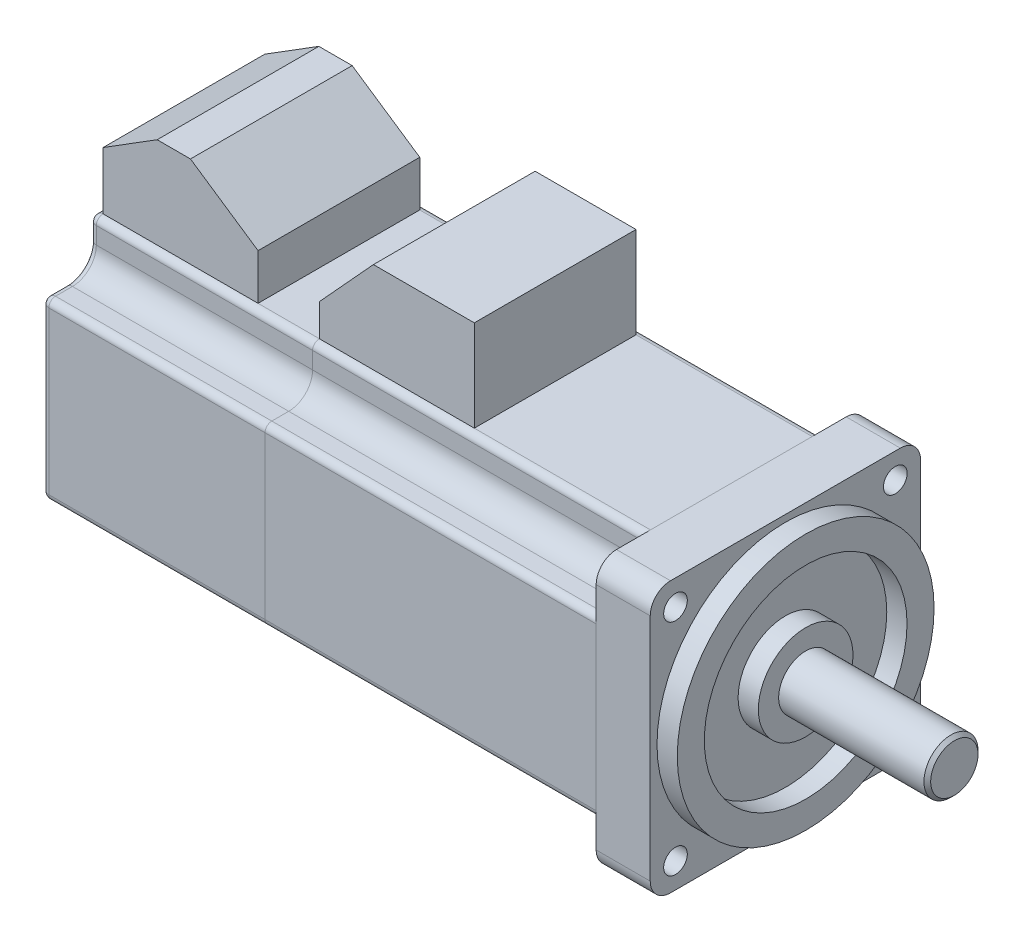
ISO-10303-21;
HEADER;
FILE_DESCRIPTION(('STEP AP214'),'2;1');
FILE_NAME('part.step','',(''),(''),'','','');
FILE_SCHEMA(('AUTOMOTIVE_DESIGN { 1 0 10303 214 1 1 1 1 }'));
ENDSEC;
DATA;
#1=APPLICATION_CONTEXT('core data for automotive mechanical design processes');
#2=APPLICATION_PROTOCOL_DEFINITION('international standard','automotive_design',2000,#1);
#3=PRODUCT_CONTEXT('',#1,'mechanical');
#4=PRODUCT('Part','Part','',(#3));
#5=PRODUCT_RELATED_PRODUCT_CATEGORY('part','',(#4));
#6=PRODUCT_DEFINITION_FORMATION('','',#4);
#7=PRODUCT_DEFINITION_CONTEXT('part definition',#1,'design');
#8=PRODUCT_DEFINITION('design','',#6,#7);
#9=PRODUCT_DEFINITION_SHAPE('','',#8);
#10=(LENGTH_UNIT() NAMED_UNIT(*) SI_UNIT(.MILLI.,.METRE.));
#11=(NAMED_UNIT(*) PLANE_ANGLE_UNIT() SI_UNIT($,.RADIAN.));
#12=(NAMED_UNIT(*) SI_UNIT($,.STERADIAN.) SOLID_ANGLE_UNIT());
#13=UNCERTAINTY_MEASURE_WITH_UNIT(LENGTH_MEASURE(1.E-05),#10,'distance_accuracy_value','');
#14=(GEOMETRIC_REPRESENTATION_CONTEXT(3) GLOBAL_UNCERTAINTY_ASSIGNED_CONTEXT((#13)) GLOBAL_UNIT_ASSIGNED_CONTEXT((#10,
#11,#12)) REPRESENTATION_CONTEXT('',''));
#15=CARTESIAN_POINT('',(0.,0.,0.));
#16=DIRECTION('',(0.,0.,1.));
#17=DIRECTION('',(1.,0.,0.));
#18=AXIS2_PLACEMENT_3D('',#15,#16,#17);
#19=CARTESIAN_POINT('',(23.93,33.5,-11.9644660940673));
#20=DIRECTION('',(-1.,0.,0.));
#21=DIRECTION('',(0.,0.,1.));
#22=AXIS2_PLACEMENT_3D('',#19,#20,#21);
#23=PLANE('',#22);
#24=DIRECTION('',(0.,-1.,0.));
#25=VECTOR('',#24,1.);
#26=CARTESIAN_POINT('',(23.93,33.5,-11.9644660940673));
#27=LINE('',#26,#25);
#28=CARTESIAN_POINT('',(23.93,26.75,-11.9644660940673));
#29=VERTEX_POINT('',#28);
#30=CARTESIAN_POINT('',(23.93,20.,-11.9644660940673));
#31=VERTEX_POINT('',#30);
#32=EDGE_CURVE('E129',#29,#31,#27,.T.);
#33=ORIENTED_EDGE('',*,*,#32,.F.);
#34=DIRECTION('',(0.,0.,1.));
#35=VECTOR('',#34,1.);
#36=CARTESIAN_POINT('',(23.93,26.75,-11.9655339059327));
#37=LINE('',#36,#35);
#38=CARTESIAN_POINT('',(23.93,26.75,11.9644660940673));
#39=VERTEX_POINT('',#38);
#40=EDGE_CURVE('E120',#29,#39,#37,.T.);
#41=ORIENTED_EDGE('',*,*,#40,.T.);
#42=DIRECTION('',(0.,-1.,0.));
#43=VECTOR('',#42,1.);
#44=CARTESIAN_POINT('',(23.93,33.5,11.9644660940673));
#45=LINE('',#44,#43);
#46=CARTESIAN_POINT('',(23.93,20.,11.9644660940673));
#47=VERTEX_POINT('',#46);
#48=EDGE_CURVE('E127',#39,#47,#45,.T.);
#49=ORIENTED_EDGE('',*,*,#48,.T.);
#50=DIRECTION('',(0.,0.,-1.));
#51=VECTOR('',#50,1.);
#52=CARTESIAN_POINT('',(23.93,20.,-11.9644660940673));
#53=LINE('',#52,#51);
#54=EDGE_CURVE('E148',#47,#31,#53,.T.);
#55=ORIENTED_EDGE('',*,*,#54,.T.);
#56=EDGE_LOOP('',(#33,#41,#49,#55));
#57=FACE_BOUND('',#56,.T.);
#58=ADVANCED_FACE('F54',(#57),#23,.F.);
#59=CARTESIAN_POINT('',(1.,33.5,-11.9644660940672));
#60=DIRECTION('',(0.,0.,1.));
#61=DIRECTION('',(1.,0.,0.));
#62=AXIS2_PLACEMENT_3D('',#59,#60,#61);
#63=PLANE('',#62);
#64=DIRECTION('',(0.,-1.,0.));
#65=VECTOR('',#64,1.);
#66=CARTESIAN_POINT('',(1.,33.5,-11.9644660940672));
#67=LINE('',#66,#65);
#68=CARTESIAN_POINT('',(1.,28.5,-11.9644660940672));
#69=VERTEX_POINT('',#68);
#70=CARTESIAN_POINT('',(1.,20.,-11.9644660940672));
#71=VERTEX_POINT('',#70);
#72=EDGE_CURVE('E126',#69,#71,#67,.T.);
#73=ORIENTED_EDGE('',*,*,#72,.F.);
#74=DIRECTION('',(0.847998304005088,0.52999894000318,0.));
#75=VECTOR('',#74,1.);
#76=CARTESIAN_POINT('',(3.24719101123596,29.9044943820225,-11.9644660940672));
#77=LINE('',#76,#75);
#78=CARTESIAN_POINT('',(9.,33.5,-11.9644660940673));
#79=VERTEX_POINT('',#78);
#80=EDGE_CURVE('E106',#69,#79,#77,.T.);
#81=ORIENTED_EDGE('',*,*,#80,.T.);
#82=DIRECTION('',(-1.,0.,0.));
#83=VECTOR('',#82,1.);
#84=CARTESIAN_POINT('',(1.,33.5,-11.9644660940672));
#85=LINE('',#84,#83);
#86=CARTESIAN_POINT('',(13.93,33.5,-11.9644660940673));
#87=VERTEX_POINT('',#86);
#88=EDGE_CURVE('E138',#87,#79,#85,.T.);
#89=ORIENTED_EDGE('',*,*,#88,.F.);
#90=DIRECTION('',(0.828848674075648,-0.559472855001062,0.));
#91=VECTOR('',#90,1.);
#92=CARTESIAN_POINT('',(5.0472176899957,39.4958780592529,-11.9644660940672));
#93=LINE('',#92,#91);
#94=EDGE_CURVE('E75',#87,#29,#93,.T.);
#95=ORIENTED_EDGE('',*,*,#94,.T.);
#96=ORIENTED_EDGE('',*,*,#32,.T.);
#97=DIRECTION('',(-1.,0.,0.));
#98=VECTOR('',#97,1.);
#99=CARTESIAN_POINT('',(1.,20.,-11.9644660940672));
#100=LINE('',#99,#98);
#101=EDGE_CURVE('E151',#31,#71,#100,.T.);
#102=ORIENTED_EDGE('',*,*,#101,.T.);
#103=EDGE_LOOP('',(#73,#81,#89,#95,#96,#102));
#104=FACE_BOUND('',#103,.T.);
#105=ADVANCED_FACE('F140',(#104),#63,.F.);
#106=CARTESIAN_POINT('',(1.,33.5,-11.9644660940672));
#107=DIRECTION('',(1.,0.,0.));
#108=DIRECTION('',(0.,0.,-1.));
#109=AXIS2_PLACEMENT_3D('',#106,#107,#108);
#110=PLANE('',#109);
#111=DIRECTION('',(0.,-1.,0.));
#112=VECTOR('',#111,1.);
#113=CARTESIAN_POINT('',(1.,33.5,11.9644660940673));
#114=LINE('',#113,#112);
#115=CARTESIAN_POINT('',(1.,28.5,11.9644660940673));
#116=VERTEX_POINT('',#115);
#117=CARTESIAN_POINT('',(1.,20.,11.9644660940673));
#118=VERTEX_POINT('',#117);
#119=EDGE_CURVE('E115',#116,#118,#114,.T.);
#120=ORIENTED_EDGE('',*,*,#119,.F.);
#121=DIRECTION('',(0.,0.,1.));
#122=VECTOR('',#121,1.);
#123=CARTESIAN_POINT('',(1.,28.5,-11.9655339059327));
#124=LINE('',#123,#122);
#125=EDGE_CURVE('E103',#69,#116,#124,.T.);
#126=ORIENTED_EDGE('',*,*,#125,.F.);
#127=ORIENTED_EDGE('',*,*,#72,.T.);
#128=DIRECTION('',(0.,0.,1.));
#129=VECTOR('',#128,1.);
#130=CARTESIAN_POINT('',(1.,20.,-11.9644660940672));
#131=LINE('',#130,#129);
#132=EDGE_CURVE('E124',#71,#118,#131,.T.);
#133=ORIENTED_EDGE('',*,*,#132,.T.);
#134=EDGE_LOOP('',(#120,#126,#127,#133));
#135=FACE_BOUND('',#134,.T.);
#136=ADVANCED_FACE('F122',(#135),#110,.F.);
#137=CARTESIAN_POINT('',(23.93,33.5,11.9644660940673));
#138=DIRECTION('',(0.,0.,-1.));
#139=DIRECTION('',(-1.,0.,0.));
#140=AXIS2_PLACEMENT_3D('',#137,#138,#139);
#141=PLANE('',#140);
#142=DIRECTION('',(1.,0.,0.));
#143=VECTOR('',#142,1.);
#144=CARTESIAN_POINT('',(23.93,33.5,11.9644660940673));
#145=LINE('',#144,#143);
#146=CARTESIAN_POINT('',(9.,33.5,11.9644660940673));
#147=VERTEX_POINT('',#146);
#148=CARTESIAN_POINT('',(13.93,33.5,11.9644660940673));
#149=VERTEX_POINT('',#148);
#150=EDGE_CURVE('E119',#147,#149,#145,.T.);
#151=ORIENTED_EDGE('',*,*,#150,.F.);
#152=DIRECTION('',(0.847998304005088,0.52999894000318,0.));
#153=VECTOR('',#152,1.);
#154=CARTESIAN_POINT('',(9.,33.5,11.9644660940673));
#155=LINE('',#154,#153);
#156=EDGE_CURVE('E68',#116,#147,#155,.T.);
#157=ORIENTED_EDGE('',*,*,#156,.F.);
#158=ORIENTED_EDGE('',*,*,#119,.T.);
#159=DIRECTION('',(1.,0.,0.));
#160=VECTOR('',#159,1.);
#161=CARTESIAN_POINT('',(23.93,20.,11.9644660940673));
#162=LINE('',#161,#160);
#163=EDGE_CURVE('E142',#118,#47,#162,.T.);
#164=ORIENTED_EDGE('',*,*,#163,.T.);
#165=ORIENTED_EDGE('',*,*,#48,.F.);
#166=DIRECTION('',(0.828848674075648,-0.559472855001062,0.));
#167=VECTOR('',#166,1.);
#168=CARTESIAN_POINT('',(23.93,26.75,11.9644660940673));
#169=LINE('',#168,#167);
#170=EDGE_CURVE('E159',#149,#39,#169,.T.);
#171=ORIENTED_EDGE('',*,*,#170,.F.);
#172=EDGE_LOOP('',(#151,#157,#158,#164,#165,#171));
#173=FACE_BOUND('',#172,.T.);
#174=ADVANCED_FACE('F113',(#173),#141,.F.);
#175=CARTESIAN_POINT('',(0.,33.5,0.));
#176=DIRECTION('',(0.,-1.,0.));
#177=DIRECTION('',(0.,0.,-1.));
#178=AXIS2_PLACEMENT_3D('',#175,#176,#177);
#179=PLANE('',#178);
#180=ORIENTED_EDGE('',*,*,#88,.T.);
#181=DIRECTION('',(0.,0.,1.));
#182=VECTOR('',#181,1.);
#183=CARTESIAN_POINT('',(9.,33.5,0.));
#184=LINE('',#183,#182);
#185=EDGE_CURVE('E13',#79,#147,#184,.T.);
#186=ORIENTED_EDGE('',*,*,#185,.T.);
#187=ORIENTED_EDGE('',*,*,#150,.T.);
#188=DIRECTION('',(0.,0.,-1.));
#189=VECTOR('',#188,1.);
#190=CARTESIAN_POINT('',(13.93,33.5,0.));
#191=LINE('',#190,#189);
#192=EDGE_CURVE('E61',#149,#87,#191,.T.);
#193=ORIENTED_EDGE('',*,*,#192,.T.);
#194=EDGE_LOOP('',(#180,#186,#187,#193));
#195=FACE_BOUND('',#194,.T.);
#196=ADVANCED_FACE('F137',(#195),#179,.F.);
#197=CARTESIAN_POINT('',(0.,20.,0.));
#198=DIRECTION('',(0.,-1.,0.));
#199=DIRECTION('',(0.,0.,-1.));
#200=AXIS2_PLACEMENT_3D('',#197,#198,#199);
#201=PLANE('',#200);
#202=ORIENTED_EDGE('',*,*,#54,.F.);
#203=ORIENTED_EDGE('',*,*,#163,.F.);
#204=ORIENTED_EDGE('',*,*,#132,.F.);
#205=ORIENTED_EDGE('',*,*,#101,.F.);
#206=EDGE_LOOP('',(#202,#203,#204,#205));
#207=FACE_BOUND('',#206,.T.);
#208=ADVANCED_FACE('F157',(#207),#201,.T.);
#209=CARTESIAN_POINT('',(23.93,26.75,-11.9655339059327));
#210=DIRECTION('',(-0.559472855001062,-0.828848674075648,0.));
#211=DIRECTION('',(0.828848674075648,-0.559472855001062,0.));
#212=AXIS2_PLACEMENT_3D('',#209,#210,#211);
#213=PLANE('',#212);
#214=ORIENTED_EDGE('',*,*,#192,.F.);
#215=ORIENTED_EDGE('',*,*,#170,.T.);
#216=ORIENTED_EDGE('',*,*,#40,.F.);
#217=ORIENTED_EDGE('',*,*,#94,.F.);
#218=EDGE_LOOP('',(#214,#215,#216,#217));
#219=FACE_BOUND('',#218,.T.);
#220=ADVANCED_FACE('F164',(#219),#213,.F.);
#221=CARTESIAN_POINT('',(9.,33.5,-11.9655339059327));
#222=DIRECTION('',(0.52999894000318,-0.847998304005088,0.));
#223=DIRECTION('',(0.847998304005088,0.52999894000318,0.));
#224=AXIS2_PLACEMENT_3D('',#221,#222,#223);
#225=PLANE('',#224);
#226=ORIENTED_EDGE('',*,*,#125,.T.);
#227=ORIENTED_EDGE('',*,*,#156,.T.);
#228=ORIENTED_EDGE('',*,*,#185,.F.);
#229=ORIENTED_EDGE('',*,*,#80,.F.);
#230=EDGE_LOOP('',(#226,#227,#228,#229));
#231=FACE_BOUND('',#230,.T.);
#232=ADVANCED_FACE('F104',(#231),#225,.F.);
#233=CLOSED_SHELL('',(#58,#105,#136,#174,#196,#208,#220,#232));
#234=MANIFOLD_SOLID_BREP('B2',#233);
#235=CARTESIAN_POINT('',(33.,33.5,11.9644660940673));
#236=DIRECTION('',(1.,0.,0.));
#237=DIRECTION('',(0.,0.,-1.));
#238=AXIS2_PLACEMENT_3D('',#235,#236,#237);
#239=PLANE('',#238);
#240=DIRECTION('',(0.,-1.,0.));
#241=VECTOR('',#240,1.);
#242=CARTESIAN_POINT('',(33.,33.5,11.9644660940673));
#243=LINE('',#242,#241);
#244=CARTESIAN_POINT('',(33.,24.7508234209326,11.9644660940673));
#245=VERTEX_POINT('',#244);
#246=CARTESIAN_POINT('',(33.,20.,11.9644660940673));
#247=VERTEX_POINT('',#246);
#248=EDGE_CURVE('E245',#245,#247,#243,.T.);
#249=ORIENTED_EDGE('',*,*,#248,.F.);
#250=DIRECTION('',(0.,0.,1.));
#251=VECTOR('',#250,1.);
#252=CARTESIAN_POINT('',(33.,24.7508234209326,-11.9655339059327));
#253=LINE('',#252,#251);
#254=CARTESIAN_POINT('',(33.,24.7508234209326,-11.9644660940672));
#255=VERTEX_POINT('',#254);
#256=EDGE_CURVE('E286',#255,#245,#253,.T.);
#257=ORIENTED_EDGE('',*,*,#256,.F.);
#258=DIRECTION('',(0.,-1.,0.));
#259=VECTOR('',#258,1.);
#260=CARTESIAN_POINT('',(33.,33.5,-11.9644660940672));
#261=LINE('',#260,#259);
#262=CARTESIAN_POINT('',(33.,20.,-11.9644660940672));
#263=VERTEX_POINT('',#262);
#264=EDGE_CURVE('E280',#255,#263,#261,.T.);
#265=ORIENTED_EDGE('',*,*,#264,.T.);
#266=DIRECTION('',(0.,0.,1.));
#267=VECTOR('',#266,1.);
#268=CARTESIAN_POINT('',(33.,20.,11.9644660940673));
#269=LINE('',#268,#267);
#270=EDGE_CURVE('E284',#263,#247,#269,.T.);
#271=ORIENTED_EDGE('',*,*,#270,.T.);
#272=EDGE_LOOP('',(#249,#257,#265,#271));
#273=FACE_BOUND('',#272,.T.);
#274=ADVANCED_FACE('F238',(#273),#239,.F.);
#275=CARTESIAN_POINT('',(55.93,33.5,11.9644660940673));
#276=DIRECTION('',(0.,0.,-1.));
#277=DIRECTION('',(-1.,0.,0.));
#278=AXIS2_PLACEMENT_3D('',#275,#276,#277);
#279=PLANE('',#278);
#280=DIRECTION('',(1.,0.,0.));
#281=VECTOR('',#280,1.);
#282=CARTESIAN_POINT('',(55.93,33.5,11.9644660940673));
#283=LINE('',#282,#281);
#284=CARTESIAN_POINT('',(41.,33.5,11.9644660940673));
#285=VERTEX_POINT('',#284);
#286=CARTESIAN_POINT('',(55.93,33.5,11.9644660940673));
#287=VERTEX_POINT('',#286);
#288=EDGE_CURVE('E299',#285,#287,#283,.T.);
#289=ORIENTED_EDGE('',*,*,#288,.F.);
#290=DIRECTION('',(0.674803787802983,0.737997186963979,0.));
#291=VECTOR('',#290,1.);
#292=CARTESIAN_POINT('',(33.,24.7508234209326,11.9644660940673));
#293=LINE('',#292,#291);
#294=EDGE_CURVE('E252',#245,#285,#293,.T.);
#295=ORIENTED_EDGE('',*,*,#294,.F.);
#296=ORIENTED_EDGE('',*,*,#248,.T.);
#297=DIRECTION('',(1.,0.,0.));
#298=VECTOR('',#297,1.);
#299=CARTESIAN_POINT('',(55.93,20.,11.9644660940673));
#300=LINE('',#299,#298);
#301=CARTESIAN_POINT('',(55.93,20.,11.9644660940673));
#302=VERTEX_POINT('',#301);
#303=EDGE_CURVE('E304',#247,#302,#300,.T.);
#304=ORIENTED_EDGE('',*,*,#303,.T.);
#305=DIRECTION('',(0.,-1.,0.));
#306=VECTOR('',#305,1.);
#307=CARTESIAN_POINT('',(55.93,33.5,11.9644660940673));
#308=LINE('',#307,#306);
#309=EDGE_CURVE('E314',#287,#302,#308,.T.);
#310=ORIENTED_EDGE('',*,*,#309,.F.);
#311=EDGE_LOOP('',(#289,#295,#296,#304,#310));
#312=FACE_BOUND('',#311,.T.);
#313=ADVANCED_FACE('F318',(#312),#279,.F.);
#314=CARTESIAN_POINT('',(55.93,33.5,-11.9644660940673));
#315=DIRECTION('',(-1.,0.,0.));
#316=DIRECTION('',(0.,0.,1.));
#317=AXIS2_PLACEMENT_3D('',#314,#315,#316);
#318=PLANE('',#317);
#319=DIRECTION('',(0.,0.,-1.));
#320=VECTOR('',#319,1.);
#321=CARTESIAN_POINT('',(55.93,20.,-11.9644660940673));
#322=LINE('',#321,#320);
#323=CARTESIAN_POINT('',(55.93,20.,-11.9644660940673));
#324=VERTEX_POINT('',#323);
#325=EDGE_CURVE('E300',#302,#324,#322,.T.);
#326=ORIENTED_EDGE('',*,*,#325,.T.);
#327=DIRECTION('',(0.,-1.,0.));
#328=VECTOR('',#327,1.);
#329=CARTESIAN_POINT('',(55.93,33.5,-11.9644660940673));
#330=LINE('',#329,#328);
#331=CARTESIAN_POINT('',(55.93,33.5,-11.9644660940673));
#332=VERTEX_POINT('',#331);
#333=EDGE_CURVE('E289',#332,#324,#330,.T.);
#334=ORIENTED_EDGE('',*,*,#333,.F.);
#335=DIRECTION('',(0.,0.,-1.));
#336=VECTOR('',#335,1.);
#337=CARTESIAN_POINT('',(55.93,33.5,-11.9644660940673));
#338=LINE('',#337,#336);
#339=EDGE_CURVE('E260',#287,#332,#338,.T.);
#340=ORIENTED_EDGE('',*,*,#339,.F.);
#341=ORIENTED_EDGE('',*,*,#309,.T.);
#342=EDGE_LOOP('',(#326,#334,#340,#341));
#343=FACE_BOUND('',#342,.T.);
#344=ADVANCED_FACE('F330',(#343),#318,.F.);
#345=CARTESIAN_POINT('',(33.,33.5,-11.9644660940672));
#346=DIRECTION('',(0.,0.,1.));
#347=DIRECTION('',(1.,0.,0.));
#348=AXIS2_PLACEMENT_3D('',#345,#346,#347);
#349=PLANE('',#348);
#350=ORIENTED_EDGE('',*,*,#264,.F.);
#351=DIRECTION('',(0.674803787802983,0.737997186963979,0.));
#352=VECTOR('',#351,1.);
#353=CARTESIAN_POINT('',(37.357118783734,29.5159736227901,-11.9644660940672));
#354=LINE('',#353,#352);
#355=CARTESIAN_POINT('',(41.,33.5,-11.9644660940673));
#356=VERTEX_POINT('',#355);
#357=EDGE_CURVE('E305',#255,#356,#354,.T.);
#358=ORIENTED_EDGE('',*,*,#357,.T.);
#359=DIRECTION('',(-1.,0.,0.));
#360=VECTOR('',#359,1.);
#361=CARTESIAN_POINT('',(33.,33.5,-11.9644660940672));
#362=LINE('',#361,#360);
#363=EDGE_CURVE('E290',#332,#356,#362,.T.);
#364=ORIENTED_EDGE('',*,*,#363,.F.);
#365=ORIENTED_EDGE('',*,*,#333,.T.);
#366=DIRECTION('',(-1.,0.,0.));
#367=VECTOR('',#366,1.);
#368=CARTESIAN_POINT('',(33.,20.,-11.9644660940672));
#369=LINE('',#368,#367);
#370=EDGE_CURVE('E294',#324,#263,#369,.T.);
#371=ORIENTED_EDGE('',*,*,#370,.T.);
#372=EDGE_LOOP('',(#350,#358,#364,#365,#371));
#373=FACE_BOUND('',#372,.T.);
#374=ADVANCED_FACE('F295',(#373),#349,.F.);
#375=CARTESIAN_POINT('',(0.,33.5,0.));
#376=DIRECTION('',(0.,-1.,0.));
#377=DIRECTION('',(0.,0.,-1.));
#378=AXIS2_PLACEMENT_3D('',#375,#376,#377);
#379=PLANE('',#378);
#380=ORIENTED_EDGE('',*,*,#363,.T.);
#381=DIRECTION('',(0.,0.,1.));
#382=VECTOR('',#381,1.);
#383=CARTESIAN_POINT('',(41.,33.5,0.));
#384=LINE('',#383,#382);
#385=EDGE_CURVE('E52',#356,#285,#384,.T.);
#386=ORIENTED_EDGE('',*,*,#385,.T.);
#387=ORIENTED_EDGE('',*,*,#288,.T.);
#388=ORIENTED_EDGE('',*,*,#339,.T.);
#389=EDGE_LOOP('',(#380,#386,#387,#388));
#390=FACE_BOUND('',#389,.T.);
#391=ADVANCED_FACE('F325',(#390),#379,.F.);
#392=CARTESIAN_POINT('',(0.,20.,0.));
#393=DIRECTION('',(0.,-1.,0.));
#394=DIRECTION('',(0.,0.,-1.));
#395=AXIS2_PLACEMENT_3D('',#392,#393,#394);
#396=PLANE('',#395);
#397=ORIENTED_EDGE('',*,*,#270,.F.);
#398=ORIENTED_EDGE('',*,*,#370,.F.);
#399=ORIENTED_EDGE('',*,*,#325,.F.);
#400=ORIENTED_EDGE('',*,*,#303,.F.);
#401=EDGE_LOOP('',(#397,#398,#399,#400));
#402=FACE_BOUND('',#401,.T.);
#403=ADVANCED_FACE('F303',(#402),#396,.T.);
#404=CARTESIAN_POINT('',(33.,24.7508234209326,-11.9655339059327));
#405=DIRECTION('',(0.737997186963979,-0.674803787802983,0.));
#406=DIRECTION('',(0.674803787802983,0.737997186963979,0.));
#407=AXIS2_PLACEMENT_3D('',#404,#405,#406);
#408=PLANE('',#407);
#409=ORIENTED_EDGE('',*,*,#256,.T.);
#410=ORIENTED_EDGE('',*,*,#294,.T.);
#411=ORIENTED_EDGE('',*,*,#385,.F.);
#412=ORIENTED_EDGE('',*,*,#357,.F.);
#413=EDGE_LOOP('',(#409,#410,#411,#412));
#414=FACE_BOUND('',#413,.T.);
#415=ADVANCED_FACE('F324',(#414),#408,.F.);
#416=CLOSED_SHELL('',(#274,#313,#344,#374,#391,#403,#415));
#417=MANIFOLD_SOLID_BREP('B7',#416);
#418=CARTESIAN_POINT('',(115.,0.,0.));
#419=DIRECTION('',(-1.,0.,0.));
#420=DIRECTION('',(0.,0.,1.));
#421=AXIS2_PLACEMENT_3D('',#418,#419,#420);
#422=CYLINDRICAL_SURFACE('',#421,4.);
#423=CARTESIAN_POINT('',(114.5,0.,0.));
#424=DIRECTION('',(1.,0.,0.));
#425=DIRECTION('',(0.,0.,-1.));
#426=AXIS2_PLACEMENT_3D('',#423,#424,#425);
#427=CIRCLE('',#426,4.);
#428=CARTESIAN_POINT('',(114.5,0.,-4.));
#429=VERTEX_POINT('',#428);
#430=EDGE_CURVE('E237',#429,#429,#427,.F.);
#431=ORIENTED_EDGE('',*,*,#430,.T.);
#432=EDGE_LOOP('',(#431));
#433=FACE_BOUND('',#432,.T.);
#434=CARTESIAN_POINT('',(93.,0.,0.));
#435=DIRECTION('',(1.,0.,0.));
#436=DIRECTION('',(0.,0.,-1.));
#437=AXIS2_PLACEMENT_3D('',#434,#435,#436);
#438=CIRCLE('',#437,4.);
#439=CARTESIAN_POINT('',(93.,0.,-4.));
#440=VERTEX_POINT('',#439);
#441=EDGE_CURVE('E409',#440,#440,#438,.T.);
#442=ORIENTED_EDGE('',*,*,#441,.T.);
#443=EDGE_LOOP('',(#442));
#444=FACE_BOUND('',#443,.T.);
#445=ADVANCED_FACE('F398',(#433,#444),#422,.T.);
#446=CARTESIAN_POINT('',(115.,0.,0.));
#447=DIRECTION('',(1.,0.,0.));
#448=DIRECTION('',(0.,0.,-1.));
#449=AXIS2_PLACEMENT_3D('',#446,#447,#448);
#450=PLANE('',#449);
#451=CARTESIAN_POINT('',(115.,0.,0.));
#452=DIRECTION('',(1.,0.,0.));
#453=DIRECTION('',(0.,0.,-1.));
#454=AXIS2_PLACEMENT_3D('',#451,#452,#453);
#455=CIRCLE('',#454,3.49999999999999);
#456=CARTESIAN_POINT('',(115.,0.,-3.49999999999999));
#457=VERTEX_POINT('',#456);
#458=EDGE_CURVE('E405',#457,#457,#455,.T.);
#459=ORIENTED_EDGE('',*,*,#458,.T.);
#460=EDGE_LOOP('',(#459));
#461=FACE_BOUND('',#460,.T.);
#462=ADVANCED_FACE('F419',(#461),#450,.T.);
#463=CARTESIAN_POINT('',(93.,0.,0.));
#464=DIRECTION('',(1.,0.,0.));
#465=DIRECTION('',(0.,0.,-1.));
#466=AXIS2_PLACEMENT_3D('',#463,#464,#465);
#467=PLANE('',#466);
#468=ORIENTED_EDGE('',*,*,#441,.F.);
#469=EDGE_LOOP('',(#468));
#470=FACE_BOUND('',#469,.T.);
#471=ADVANCED_FACE('F417',(#470),#467,.F.);
#472=CARTESIAN_POINT('',(115.,0.,0.));
#473=DIRECTION('',(-1.,0.,0.));
#474=DIRECTION('',(0.,0.,1.));
#475=AXIS2_PLACEMENT_3D('',#472,#473,#474);
#476=CONICAL_SURFACE('',#475,3.49999999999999,0.785398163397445);
#477=ORIENTED_EDGE('',*,*,#430,.F.);
#478=EDGE_LOOP('',(#477));
#479=FACE_BOUND('',#478,.T.);
#480=ORIENTED_EDGE('',*,*,#458,.F.);
#481=EDGE_LOOP('',(#480));
#482=FACE_BOUND('',#481,.T.);
#483=ADVANCED_FACE('F400',(#479,#482),#476,.T.);
#484=CLOSED_SHELL('',(#445,#462,#471,#483));
#485=MANIFOLD_SOLID_BREP('B46',#484);
#486=CARTESIAN_POINT('',(90.,17.,-17.));
#487=DIRECTION('',(-1.,0.,0.));
#488=DIRECTION('',(0.,0.,1.));
#489=AXIS2_PLACEMENT_3D('',#486,#487,#488);
#490=PLANE('',#489);
#491=CARTESIAN_POINT('',(90.,0.,0.));
#492=DIRECTION('',(1.,0.,0.));
#493=DIRECTION('',(0.,0.,-1.));
#494=AXIS2_PLACEMENT_3D('',#491,#492,#493);
#495=CIRCLE('',#494,15.);
#496=CARTESIAN_POINT('',(90.,0.,-15.));
#497=VERTEX_POINT('',#496);
#498=EDGE_CURVE('E676',#497,#497,#495,.T.);
#499=ORIENTED_EDGE('',*,*,#498,.T.);
#500=EDGE_LOOP('',(#499));
#501=FACE_BOUND('',#500,.T.);
#502=CARTESIAN_POINT('',(90.,0.,0.));
#503=DIRECTION('',(-1.,0.,0.));
#504=DIRECTION('',(0.,0.,1.));
#505=AXIS2_PLACEMENT_3D('',#502,#503,#504);
#506=CIRCLE('',#505,7.);
#507=CARTESIAN_POINT('',(90.,0.,7.));
#508=VERTEX_POINT('',#507);
#509=EDGE_CURVE('E396',#508,#508,#506,.F.);
#510=ORIENTED_EDGE('',*,*,#509,.F.);
#511=EDGE_LOOP('',(#510));
#512=FACE_BOUND('',#511,.T.);
#513=ADVANCED_FACE('F464',(#501,#512),#490,.F.);
#514=CARTESIAN_POINT('',(90.,17.,-17.));
#515=DIRECTION('',(1.,0.,0.));
#516=DIRECTION('',(0.,0.,1.));
#517=AXIS2_PLACEMENT_3D('',#514,#515,#516);
#518=CIRCLE('',#517,3.);
#519=CARTESIAN_POINT('',(90.,17.,-20.));
#520=VERTEX_POINT('',#519);
#521=CARTESIAN_POINT('',(90.,20.,-17.));
#522=VERTEX_POINT('',#521);
#523=EDGE_CURVE('E578',#520,#522,#518,.T.);
#524=ORIENTED_EDGE('',*,*,#523,.T.);
#525=DIRECTION('',(0.,0.,1.));
#526=VECTOR('',#525,1.);
#527=CARTESIAN_POINT('',(90.,20.,17.));
#528=LINE('',#527,#526);
#529=CARTESIAN_POINT('',(90.,20.,17.));
#530=VERTEX_POINT('',#529);
#531=EDGE_CURVE('E525',#522,#530,#528,.T.);
#532=ORIENTED_EDGE('',*,*,#531,.T.);
#533=CARTESIAN_POINT('',(90.,17.,17.));
#534=DIRECTION('',(1.,0.,0.));
#535=DIRECTION('',(0.,0.,1.));
#536=AXIS2_PLACEMENT_3D('',#533,#534,#535);
#537=CIRCLE('',#536,3.);
#538=CARTESIAN_POINT('',(90.,17.,20.));
#539=VERTEX_POINT('',#538);
#540=EDGE_CURVE('E641',#530,#539,#537,.T.);
#541=ORIENTED_EDGE('',*,*,#540,.T.);
#542=DIRECTION('',(0.,-1.,0.));
#543=VECTOR('',#542,1.);
#544=CARTESIAN_POINT('',(90.,-17.,20.));
#545=LINE('',#544,#543);
#546=CARTESIAN_POINT('',(90.,-17.,20.));
#547=VERTEX_POINT('',#546);
#548=EDGE_CURVE('E646',#539,#547,#545,.T.);
#549=ORIENTED_EDGE('',*,*,#548,.T.);
#550=CARTESIAN_POINT('',(90.,-17.,17.));
#551=DIRECTION('',(1.,0.,0.));
#552=DIRECTION('',(0.,0.,1.));
#553=AXIS2_PLACEMENT_3D('',#550,#551,#552);
#554=CIRCLE('',#553,3.);
#555=CARTESIAN_POINT('',(90.,-20.,17.));
#556=VERTEX_POINT('',#555);
#557=EDGE_CURVE('E545',#547,#556,#554,.T.);
#558=ORIENTED_EDGE('',*,*,#557,.T.);
#559=DIRECTION('',(0.,0.,-1.));
#560=VECTOR('',#559,1.);
#561=CARTESIAN_POINT('',(90.,-20.,17.));
#562=LINE('',#561,#560);
#563=CARTESIAN_POINT('',(90.,-20.,-17.));
#564=VERTEX_POINT('',#563);
#565=EDGE_CURVE('E538',#556,#564,#562,.T.);
#566=ORIENTED_EDGE('',*,*,#565,.T.);
#567=CARTESIAN_POINT('',(90.,-17.,-17.));
#568=DIRECTION('',(1.,0.,0.));
#569=DIRECTION('',(0.,0.,-1.));
#570=AXIS2_PLACEMENT_3D('',#567,#568,#569);
#571=CIRCLE('',#570,3.);
#572=CARTESIAN_POINT('',(90.,-17.,-20.));
#573=VERTEX_POINT('',#572);
#574=EDGE_CURVE('E543',#564,#573,#571,.T.);
#575=ORIENTED_EDGE('',*,*,#574,.T.);
#576=DIRECTION('',(0.,1.,0.));
#577=VECTOR('',#576,1.);
#578=CARTESIAN_POINT('',(90.,-17.,-20.));
#579=LINE('',#578,#577);
#580=EDGE_CURVE('E481',#573,#520,#579,.T.);
#581=ORIENTED_EDGE('',*,*,#580,.T.);
#582=EDGE_LOOP('',(#524,#532,#541,#549,#558,#566,#575,#581));
#583=FACE_BOUND('',#582,.T.);
#584=CARTESIAN_POINT('',(90.,16.2634559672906,16.2634559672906));
#585=DIRECTION('',(1.,0.,0.));
#586=DIRECTION('',(0.,0.,-1.));
#587=AXIS2_PLACEMENT_3D('',#584,#585,#586);
#588=CIRCLE('',#587,1.75);
#589=CARTESIAN_POINT('',(90.,16.2634559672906,14.5134559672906));
#590=VERTEX_POINT('',#589);
#591=EDGE_CURVE('E652',#590,#590,#588,.T.);
#592=ORIENTED_EDGE('',*,*,#591,.F.);
#593=EDGE_LOOP('',(#592));
#594=FACE_BOUND('',#593,.T.);
#595=CARTESIAN_POINT('',(90.,16.2634559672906,-16.2634559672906));
#596=DIRECTION('',(1.,0.,0.));
#597=DIRECTION('',(0.,0.,-1.));
#598=AXIS2_PLACEMENT_3D('',#595,#596,#597);
#599=CIRCLE('',#598,1.75);
#600=CARTESIAN_POINT('',(90.,16.2634559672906,-18.0134559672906));
#601=VERTEX_POINT('',#600);
#602=EDGE_CURVE('E658',#601,#601,#599,.T.);
#603=ORIENTED_EDGE('',*,*,#602,.F.);
#604=EDGE_LOOP('',(#603));
#605=FACE_BOUND('',#604,.T.);
#606=CARTESIAN_POINT('',(90.,-16.2634559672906,-16.2634559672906));
#607=DIRECTION('',(1.,0.,0.));
#608=DIRECTION('',(0.,0.,-1.));
#609=AXIS2_PLACEMENT_3D('',#606,#607,#608);
#610=CIRCLE('',#609,1.75);
#611=CARTESIAN_POINT('',(90.,-16.2634559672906,-18.0134559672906));
#612=VERTEX_POINT('',#611);
#613=EDGE_CURVE('E664',#612,#612,#610,.T.);
#614=ORIENTED_EDGE('',*,*,#613,.F.);
#615=EDGE_LOOP('',(#614));
#616=FACE_BOUND('',#615,.T.);
#617=CARTESIAN_POINT('',(90.,-16.2634559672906,16.2634559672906));
#618=DIRECTION('',(1.,0.,0.));
#619=DIRECTION('',(0.,0.,-1.));
#620=AXIS2_PLACEMENT_3D('',#617,#618,#619);
#621=CIRCLE('',#620,1.75);
#622=CARTESIAN_POINT('',(90.,-16.2634559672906,14.5134559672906));
#623=VERTEX_POINT('',#622);
#624=EDGE_CURVE('E670',#623,#623,#621,.T.);
#625=ORIENTED_EDGE('',*,*,#624,.F.);
#626=EDGE_LOOP('',(#625));
#627=FACE_BOUND('',#626,.T.);
#628=CARTESIAN_POINT('',(90.,0.,0.));
#629=DIRECTION('',(-1.,0.,0.));
#630=DIRECTION('',(0.,0.,1.));
#631=AXIS2_PLACEMENT_3D('',#628,#629,#630);
#632=CIRCLE('',#631,19.);
#633=CARTESIAN_POINT('',(90.,0.,19.));
#634=VERTEX_POINT('',#633);
#635=EDGE_CURVE('E473',#634,#634,#632,.F.);
#636=ORIENTED_EDGE('',*,*,#635,.F.);
#637=EDGE_LOOP('',(#636));
#638=FACE_BOUND('',#637,.T.);
#639=ADVANCED_FACE('F540',(#583,#594,#605,#616,#627,#638),#490,.F.);
#640=CARTESIAN_POINT('',(90.,17.,-17.));
#641=DIRECTION('',(-1.,0.,0.));
#642=DIRECTION('',(0.,0.,1.));
#643=AXIS2_PLACEMENT_3D('',#640,#641,#642);
#644=CYLINDRICAL_SURFACE('',#643,3.);
#645=CARTESIAN_POINT('',(82.,17.,-17.));
#646=DIRECTION('',(1.,0.,0.));
#647=DIRECTION('',(0.,0.,1.));
#648=AXIS2_PLACEMENT_3D('',#645,#646,#647);
#649=CIRCLE('',#648,3.);
#650=CARTESIAN_POINT('',(82.,17.,-20.));
#651=VERTEX_POINT('',#650);
#652=CARTESIAN_POINT('',(82.,20.,-17.));
#653=VERTEX_POINT('',#652);
#654=EDGE_CURVE('E563',#651,#653,#649,.T.);
#655=ORIENTED_EDGE('',*,*,#654,.T.);
#656=DIRECTION('',(-1.,0.,0.));
#657=VECTOR('',#656,1.);
#658=CARTESIAN_POINT('',(90.,20.,-17.));
#659=LINE('',#658,#657);
#660=EDGE_CURVE('E591',#522,#653,#659,.T.);
#661=ORIENTED_EDGE('',*,*,#660,.F.);
#662=ORIENTED_EDGE('',*,*,#523,.F.);
#663=DIRECTION('',(-1.,0.,0.));
#664=VECTOR('',#663,1.);
#665=CARTESIAN_POINT('',(90.,17.,-20.));
#666=LINE('',#665,#664);
#667=EDGE_CURVE('E559',#520,#651,#666,.T.);
#668=ORIENTED_EDGE('',*,*,#667,.T.);
#669=EDGE_LOOP('',(#655,#661,#662,#668));
#670=FACE_BOUND('',#669,.T.);
#671=ADVANCED_FACE('F466',(#670),#644,.T.);
#672=CARTESIAN_POINT('',(90.,20.,17.));
#673=DIRECTION('',(0.,-1.,0.));
#674=DIRECTION('',(0.,0.,-1.));
#675=AXIS2_PLACEMENT_3D('',#672,#673,#674);
#676=PLANE('',#675);
#677=DIRECTION('',(0.,0.,1.));
#678=VECTOR('',#677,1.);
#679=CARTESIAN_POINT('',(82.,20.,17.));
#680=LINE('',#679,#678);
#681=CARTESIAN_POINT('',(82.,20.,17.));
#682=VERTEX_POINT('',#681);
#683=EDGE_CURVE('E566',#653,#682,#680,.T.);
#684=ORIENTED_EDGE('',*,*,#683,.T.);
#685=DIRECTION('',(-1.,0.,0.));
#686=VECTOR('',#685,1.);
#687=CARTESIAN_POINT('',(90.,20.,17.));
#688=LINE('',#687,#686);
#689=EDGE_CURVE('E588',#530,#682,#688,.T.);
#690=ORIENTED_EDGE('',*,*,#689,.F.);
#691=ORIENTED_EDGE('',*,*,#531,.F.);
#692=ORIENTED_EDGE('',*,*,#660,.T.);
#693=EDGE_LOOP('',(#684,#690,#691,#692));
#694=FACE_BOUND('',#693,.T.);
#695=ADVANCED_FACE('F603',(#694),#676,.F.);
#696=CARTESIAN_POINT('',(90.,17.,17.));
#697=DIRECTION('',(-1.,0.,0.));
#698=DIRECTION('',(0.,0.,1.));
#699=AXIS2_PLACEMENT_3D('',#696,#697,#698);
#700=CYLINDRICAL_SURFACE('',#699,3.);
#701=CARTESIAN_POINT('',(82.,17.,17.));
#702=DIRECTION('',(1.,0.,0.));
#703=DIRECTION('',(0.,0.,1.));
#704=AXIS2_PLACEMENT_3D('',#701,#702,#703);
#705=CIRCLE('',#704,3.);
#706=CARTESIAN_POINT('',(82.,17.,20.));
#707=VERTEX_POINT('',#706);
#708=EDGE_CURVE('E569',#682,#707,#705,.T.);
#709=ORIENTED_EDGE('',*,*,#708,.T.);
#710=DIRECTION('',(-1.,0.,0.));
#711=VECTOR('',#710,1.);
#712=CARTESIAN_POINT('',(90.,17.,20.));
#713=LINE('',#712,#711);
#714=EDGE_CURVE('E585',#539,#707,#713,.T.);
#715=ORIENTED_EDGE('',*,*,#714,.F.);
#716=ORIENTED_EDGE('',*,*,#540,.F.);
#717=ORIENTED_EDGE('',*,*,#689,.T.);
#718=EDGE_LOOP('',(#709,#715,#716,#717));
#719=FACE_BOUND('',#718,.T.);
#720=ADVANCED_FACE('F628',(#719),#700,.T.);
#721=CARTESIAN_POINT('',(90.,-17.,20.));
#722=DIRECTION('',(0.,0.,-1.));
#723=DIRECTION('',(-1.,0.,0.));
#724=AXIS2_PLACEMENT_3D('',#721,#722,#723);
#725=PLANE('',#724);
#726=DIRECTION('',(0.,-1.,0.));
#727=VECTOR('',#726,1.);
#728=CARTESIAN_POINT('',(82.,-17.,20.));
#729=LINE('',#728,#727);
#730=CARTESIAN_POINT('',(82.,-17.,20.));
#731=VERTEX_POINT('',#730);
#732=EDGE_CURVE('E571',#707,#731,#729,.T.);
#733=ORIENTED_EDGE('',*,*,#732,.T.);
#734=DIRECTION('',(-1.,0.,0.));
#735=VECTOR('',#734,1.);
#736=CARTESIAN_POINT('',(90.,-17.,20.));
#737=LINE('',#736,#735);
#738=EDGE_CURVE('E582',#547,#731,#737,.T.);
#739=ORIENTED_EDGE('',*,*,#738,.F.);
#740=ORIENTED_EDGE('',*,*,#548,.F.);
#741=ORIENTED_EDGE('',*,*,#714,.T.);
#742=EDGE_LOOP('',(#733,#739,#740,#741));
#743=FACE_BOUND('',#742,.T.);
#744=ADVANCED_FACE('F624',(#743),#725,.F.);
#745=CARTESIAN_POINT('',(90.,-17.,17.));
#746=DIRECTION('',(-1.,0.,0.));
#747=DIRECTION('',(0.,0.,1.));
#748=AXIS2_PLACEMENT_3D('',#745,#746,#747);
#749=CYLINDRICAL_SURFACE('',#748,3.);
#750=CARTESIAN_POINT('',(82.,-17.,17.));
#751=DIRECTION('',(1.,0.,0.));
#752=DIRECTION('',(0.,0.,1.));
#753=AXIS2_PLACEMENT_3D('',#750,#751,#752);
#754=CIRCLE('',#753,3.);
#755=CARTESIAN_POINT('',(82.,-20.,17.));
#756=VERTEX_POINT('',#755);
#757=EDGE_CURVE('E573',#731,#756,#754,.T.);
#758=ORIENTED_EDGE('',*,*,#757,.T.);
#759=DIRECTION('',(-1.,0.,0.));
#760=VECTOR('',#759,1.);
#761=CARTESIAN_POINT('',(90.,-20.,17.));
#762=LINE('',#761,#760);
#763=EDGE_CURVE('E554',#556,#756,#762,.T.);
#764=ORIENTED_EDGE('',*,*,#763,.F.);
#765=ORIENTED_EDGE('',*,*,#557,.F.);
#766=ORIENTED_EDGE('',*,*,#738,.T.);
#767=EDGE_LOOP('',(#758,#764,#765,#766));
#768=FACE_BOUND('',#767,.T.);
#769=ADVANCED_FACE('F621',(#768),#749,.T.);
#770=CARTESIAN_POINT('',(90.,-20.,17.));
#771=DIRECTION('',(0.,1.,0.));
#772=DIRECTION('',(0.,0.,1.));
#773=AXIS2_PLACEMENT_3D('',#770,#771,#772);
#774=PLANE('',#773);
#775=DIRECTION('',(0.,0.,-1.));
#776=VECTOR('',#775,1.);
#777=CARTESIAN_POINT('',(82.,-20.,17.));
#778=LINE('',#777,#776);
#779=CARTESIAN_POINT('',(82.,-20.,-17.));
#780=VERTEX_POINT('',#779);
#781=EDGE_CURVE('E553',#756,#780,#778,.T.);
#782=ORIENTED_EDGE('',*,*,#781,.T.);
#783=DIRECTION('',(-1.,0.,0.));
#784=VECTOR('',#783,1.);
#785=CARTESIAN_POINT('',(90.,-20.,-17.));
#786=LINE('',#785,#784);
#787=EDGE_CURVE('E550',#564,#780,#786,.T.);
#788=ORIENTED_EDGE('',*,*,#787,.F.);
#789=ORIENTED_EDGE('',*,*,#565,.F.);
#790=ORIENTED_EDGE('',*,*,#763,.T.);
#791=EDGE_LOOP('',(#782,#788,#789,#790));
#792=FACE_BOUND('',#791,.T.);
#793=ADVANCED_FACE('F551',(#792),#774,.F.);
#794=CARTESIAN_POINT('',(90.,-17.,-17.));
#795=DIRECTION('',(-1.,0.,0.));
#796=DIRECTION('',(0.,0.,1.));
#797=AXIS2_PLACEMENT_3D('',#794,#795,#796);
#798=CYLINDRICAL_SURFACE('',#797,3.);
#799=CARTESIAN_POINT('',(82.,-17.,-17.));
#800=DIRECTION('',(1.,0.,0.));
#801=DIRECTION('',(0.,0.,-1.));
#802=AXIS2_PLACEMENT_3D('',#799,#800,#801);
#803=CIRCLE('',#802,3.);
#804=CARTESIAN_POINT('',(82.,-17.,-20.));
#805=VERTEX_POINT('',#804);
#806=EDGE_CURVE('E510',#780,#805,#803,.T.);
#807=ORIENTED_EDGE('',*,*,#806,.T.);
#808=DIRECTION('',(-1.,0.,0.));
#809=VECTOR('',#808,1.);
#810=CARTESIAN_POINT('',(90.,-17.,-20.));
#811=LINE('',#810,#809);
#812=EDGE_CURVE('E555',#573,#805,#811,.T.);
#813=ORIENTED_EDGE('',*,*,#812,.F.);
#814=ORIENTED_EDGE('',*,*,#574,.F.);
#815=ORIENTED_EDGE('',*,*,#787,.T.);
#816=EDGE_LOOP('',(#807,#813,#814,#815));
#817=FACE_BOUND('',#816,.T.);
#818=ADVANCED_FACE('F557',(#817),#798,.T.);
#819=CARTESIAN_POINT('',(90.,-17.,-20.));
#820=DIRECTION('',(0.,0.,1.));
#821=DIRECTION('',(1.,0.,0.));
#822=AXIS2_PLACEMENT_3D('',#819,#820,#821);
#823=PLANE('',#822);
#824=DIRECTION('',(0.,1.,0.));
#825=VECTOR('',#824,1.);
#826=CARTESIAN_POINT('',(82.,-17.,-20.));
#827=LINE('',#826,#825);
#828=EDGE_CURVE('E516',#805,#651,#827,.T.);
#829=ORIENTED_EDGE('',*,*,#828,.T.);
#830=ORIENTED_EDGE('',*,*,#667,.F.);
#831=ORIENTED_EDGE('',*,*,#580,.F.);
#832=ORIENTED_EDGE('',*,*,#812,.T.);
#833=EDGE_LOOP('',(#829,#830,#831,#832));
#834=FACE_BOUND('',#833,.T.);
#835=ADVANCED_FACE('F613',(#834),#823,.F.);
#836=CARTESIAN_POINT('',(82.,17.,-17.));
#837=DIRECTION('',(-1.,0.,0.));
#838=DIRECTION('',(0.,0.,1.));
#839=AXIS2_PLACEMENT_3D('',#836,#837,#838);
#840=PLANE('',#839);
#841=CARTESIAN_POINT('',(82.,-16.2634559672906,16.2634559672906));
#842=DIRECTION('',(1.,0.,0.));
#843=DIRECTION('',(0.,0.,-1.));
#844=AXIS2_PLACEMENT_3D('',#841,#842,#843);
#845=CIRCLE('',#844,1.75);
#846=CARTESIAN_POINT('',(82.,-16.2634559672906,14.5134559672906));
#847=VERTEX_POINT('',#846);
#848=EDGE_CURVE('E667',#847,#847,#845,.T.);
#849=ORIENTED_EDGE('',*,*,#848,.T.);
#850=EDGE_LOOP('',(#849));
#851=FACE_BOUND('',#850,.T.);
#852=CARTESIAN_POINT('',(82.,-16.2634559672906,-16.2634559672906));
#853=DIRECTION('',(1.,0.,0.));
#854=DIRECTION('',(0.,0.,-1.));
#855=AXIS2_PLACEMENT_3D('',#852,#853,#854);
#856=CIRCLE('',#855,1.75);
#857=CARTESIAN_POINT('',(82.,-16.2634559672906,-18.0134559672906));
#858=VERTEX_POINT('',#857);
#859=EDGE_CURVE('E661',#858,#858,#856,.T.);
#860=ORIENTED_EDGE('',*,*,#859,.T.);
#861=EDGE_LOOP('',(#860));
#862=FACE_BOUND('',#861,.T.);
#863=CARTESIAN_POINT('',(82.,16.2634559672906,-16.2634559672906));
#864=DIRECTION('',(1.,0.,0.));
#865=DIRECTION('',(0.,0.,-1.));
#866=AXIS2_PLACEMENT_3D('',#863,#864,#865);
#867=CIRCLE('',#866,1.75);
#868=CARTESIAN_POINT('',(82.,16.2634559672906,-18.0134559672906));
#869=VERTEX_POINT('',#868);
#870=EDGE_CURVE('E655',#869,#869,#867,.T.);
#871=ORIENTED_EDGE('',*,*,#870,.T.);
#872=EDGE_LOOP('',(#871));
#873=FACE_BOUND('',#872,.T.);
#874=CARTESIAN_POINT('',(82.,16.2634559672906,16.2634559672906));
#875=DIRECTION('',(1.,0.,0.));
#876=DIRECTION('',(0.,0.,-1.));
#877=AXIS2_PLACEMENT_3D('',#874,#875,#876);
#878=CIRCLE('',#877,1.75);
#879=CARTESIAN_POINT('',(82.,16.2634559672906,14.5134559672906));
#880=VERTEX_POINT('',#879);
#881=EDGE_CURVE('E567',#880,#880,#878,.T.);
#882=ORIENTED_EDGE('',*,*,#881,.T.);
#883=EDGE_LOOP('',(#882));
#884=FACE_BOUND('',#883,.T.);
#885=ORIENTED_EDGE('',*,*,#654,.F.);
#886=ORIENTED_EDGE('',*,*,#828,.F.);
#887=ORIENTED_EDGE('',*,*,#806,.F.);
#888=ORIENTED_EDGE('',*,*,#781,.F.);
#889=ORIENTED_EDGE('',*,*,#757,.F.);
#890=ORIENTED_EDGE('',*,*,#732,.F.);
#891=ORIENTED_EDGE('',*,*,#708,.F.);
#892=ORIENTED_EDGE('',*,*,#683,.F.);
#893=EDGE_LOOP('',(#885,#886,#887,#888,#889,#890,#891,#892));
#894=FACE_BOUND('',#893,.T.);
#895=ADVANCED_FACE('F610',(#851,#862,#873,#884,#894),#840,.T.);
#896=CARTESIAN_POINT('',(82.,16.2634559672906,16.2634559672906));
#897=DIRECTION('',(1.,0.,0.));
#898=DIRECTION('',(0.,0.,-1.));
#899=AXIS2_PLACEMENT_3D('',#896,#897,#898);
#900=CYLINDRICAL_SURFACE('',#899,1.75);
#901=ORIENTED_EDGE('',*,*,#881,.F.);
#902=EDGE_LOOP('',(#901));
#903=FACE_BOUND('',#902,.T.);
#904=ORIENTED_EDGE('',*,*,#591,.T.);
#905=EDGE_LOOP('',(#904));
#906=FACE_BOUND('',#905,.T.);
#907=ADVANCED_FACE('F608',(#903,#906),#900,.F.);
#908=CARTESIAN_POINT('',(82.,16.2634559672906,-16.2634559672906));
#909=DIRECTION('',(1.,0.,0.));
#910=DIRECTION('',(0.,0.,-1.));
#911=AXIS2_PLACEMENT_3D('',#908,#909,#910);
#912=CYLINDRICAL_SURFACE('',#911,1.75);
#913=ORIENTED_EDGE('',*,*,#870,.F.);
#914=EDGE_LOOP('',(#913));
#915=FACE_BOUND('',#914,.T.);
#916=ORIENTED_EDGE('',*,*,#602,.T.);
#917=EDGE_LOOP('',(#916));
#918=FACE_BOUND('',#917,.T.);
#919=ADVANCED_FACE('F718',(#915,#918),#912,.F.);
#920=CARTESIAN_POINT('',(82.,-16.2634559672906,-16.2634559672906));
#921=DIRECTION('',(1.,0.,0.));
#922=DIRECTION('',(0.,0.,-1.));
#923=AXIS2_PLACEMENT_3D('',#920,#921,#922);
#924=CYLINDRICAL_SURFACE('',#923,1.75);
#925=ORIENTED_EDGE('',*,*,#859,.F.);
#926=EDGE_LOOP('',(#925));
#927=FACE_BOUND('',#926,.T.);
#928=ORIENTED_EDGE('',*,*,#613,.T.);
#929=EDGE_LOOP('',(#928));
#930=FACE_BOUND('',#929,.T.);
#931=ADVANCED_FACE('F715',(#927,#930),#924,.F.);
#932=CARTESIAN_POINT('',(82.,-16.2634559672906,16.2634559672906));
#933=DIRECTION('',(1.,0.,0.));
#934=DIRECTION('',(0.,0.,-1.));
#935=AXIS2_PLACEMENT_3D('',#932,#933,#934);
#936=CYLINDRICAL_SURFACE('',#935,1.75);
#937=ORIENTED_EDGE('',*,*,#848,.F.);
#938=EDGE_LOOP('',(#937));
#939=FACE_BOUND('',#938,.T.);
#940=ORIENTED_EDGE('',*,*,#624,.T.);
#941=EDGE_LOOP('',(#940));
#942=FACE_BOUND('',#941,.T.);
#943=ADVANCED_FACE('F711',(#939,#942),#936,.F.);
#944=CARTESIAN_POINT('',(93.,0.,0.));
#945=DIRECTION('',(-1.,0.,0.));
#946=DIRECTION('',(0.,0.,1.));
#947=AXIS2_PLACEMENT_3D('',#944,#945,#946);
#948=CYLINDRICAL_SURFACE('',#947,15.);
#949=CARTESIAN_POINT('',(93.,0.,0.));
#950=DIRECTION('',(1.,0.,0.));
#951=DIRECTION('',(0.,0.,-1.));
#952=AXIS2_PLACEMENT_3D('',#949,#950,#951);
#953=CIRCLE('',#952,15.);
#954=CARTESIAN_POINT('',(93.,0.,-15.));
#955=VERTEX_POINT('',#954);
#956=EDGE_CURVE('E679',#955,#955,#953,.T.);
#957=ORIENTED_EDGE('',*,*,#956,.T.);
#958=EDGE_LOOP('',(#957));
#959=FACE_BOUND('',#958,.T.);
#960=ORIENTED_EDGE('',*,*,#498,.F.);
#961=EDGE_LOOP('',(#960));
#962=FACE_BOUND('',#961,.T.);
#963=ADVANCED_FACE('F707',(#959,#962),#948,.F.);
#964=CARTESIAN_POINT('',(93.,0.,0.));
#965=DIRECTION('',(-1.,0.,0.));
#966=DIRECTION('',(0.,0.,1.));
#967=AXIS2_PLACEMENT_3D('',#964,#965,#966);
#968=CYLINDRICAL_SURFACE('',#967,19.);
#969=CARTESIAN_POINT('',(93.,0.,0.));
#970=DIRECTION('',(1.,0.,0.));
#971=DIRECTION('',(0.,0.,-1.));
#972=AXIS2_PLACEMENT_3D('',#969,#970,#971);
#973=CIRCLE('',#972,19.);
#974=CARTESIAN_POINT('',(93.,0.,-19.));
#975=VERTEX_POINT('',#974);
#976=EDGE_CURVE('E673',#975,#975,#973,.T.);
#977=ORIENTED_EDGE('',*,*,#976,.F.);
#978=EDGE_LOOP('',(#977));
#979=FACE_BOUND('',#978,.T.);
#980=ORIENTED_EDGE('',*,*,#635,.T.);
#981=EDGE_LOOP('',(#980));
#982=FACE_BOUND('',#981,.T.);
#983=ADVANCED_FACE('F595',(#979,#982),#968,.T.);
#984=CARTESIAN_POINT('',(93.,0.,0.));
#985=DIRECTION('',(1.,0.,0.));
#986=DIRECTION('',(0.,0.,-1.));
#987=AXIS2_PLACEMENT_3D('',#984,#985,#986);
#988=PLANE('',#987);
#989=ORIENTED_EDGE('',*,*,#956,.F.);
#990=EDGE_LOOP('',(#989));
#991=FACE_BOUND('',#990,.T.);
#992=ORIENTED_EDGE('',*,*,#976,.T.);
#993=EDGE_LOOP('',(#992));
#994=FACE_BOUND('',#993,.T.);
#995=ADVANCED_FACE('F693',(#991,#994),#988,.T.);
#996=CARTESIAN_POINT('',(93.,0.,0.));
#997=DIRECTION('',(-1.,0.,0.));
#998=DIRECTION('',(0.,0.,1.));
#999=AXIS2_PLACEMENT_3D('',#996,#997,#998);
#1000=CYLINDRICAL_SURFACE('',#999,7.);
#1001=CARTESIAN_POINT('',(93.,0.,0.));
#1002=DIRECTION('',(1.,0.,0.));
#1003=DIRECTION('',(0.,0.,-1.));
#1004=AXIS2_PLACEMENT_3D('',#1001,#1002,#1003);
#1005=CIRCLE('',#1004,7.);
#1006=CARTESIAN_POINT('',(93.,0.,-7.));
#1007=VERTEX_POINT('',#1006);
#1008=EDGE_CURVE('E680',#1007,#1007,#1005,.T.);
#1009=ORIENTED_EDGE('',*,*,#1008,.F.);
#1010=EDGE_LOOP('',(#1009));
#1011=FACE_BOUND('',#1010,.T.);
#1012=ORIENTED_EDGE('',*,*,#509,.T.);
#1013=EDGE_LOOP('',(#1012));
#1014=FACE_BOUND('',#1013,.T.);
#1015=ADVANCED_FACE('F690',(#1011,#1014),#1000,.T.);
#1016=CARTESIAN_POINT('',(93.,0.,0.));
#1017=DIRECTION('',(1.,0.,0.));
#1018=DIRECTION('',(0.,0.,-1.));
#1019=AXIS2_PLACEMENT_3D('',#1016,#1017,#1018);
#1020=PLANE('',#1019);
#1021=ORIENTED_EDGE('',*,*,#1008,.T.);
#1022=EDGE_LOOP('',(#1021));
#1023=FACE_BOUND('',#1022,.T.);
#1024=ADVANCED_FACE('F688',(#1023),#1020,.T.);
#1025=CLOSED_SHELL('',(#513,#639,#671,#695,#720,#744,#769,#793,#818,#835,#895,#907,#919,#931,
#943,#963,#983,#995,#1015,#1024));
#1026=MANIFOLD_SOLID_BREP('B232',#1025);
#1027=CARTESIAN_POINT('',(82.,20.,17.));
#1028=DIRECTION('',(0.,-1.,0.));
#1029=DIRECTION('',(0.,0.,-1.));
#1030=AXIS2_PLACEMENT_3D('',#1027,#1028,#1029);
#1031=PLANE('',#1030);
#1032=DIRECTION('',(-1.,0.,0.));
#1033=VECTOR('',#1032,1.);
#1034=CARTESIAN_POINT('',(82.,20.,-11.9644660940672));
#1035=LINE('',#1034,#1033);
#1036=CARTESIAN_POINT('',(82.,20.,-11.9644660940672));
#1037=VERTEX_POINT('',#1036);
#1038=CARTESIAN_POINT('',(33.,20.,-11.9644660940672));
#1039=VERTEX_POINT('',#1038);
#1040=EDGE_CURVE('E1033',#1037,#1039,#1035,.T.);
#1041=ORIENTED_EDGE('',*,*,#1040,.T.);
#1042=DIRECTION('',(0.,0.,1.));
#1043=VECTOR('',#1042,1.);
#1044=CARTESIAN_POINT('',(33.,20.,17.));
#1045=LINE('',#1044,#1043);
#1046=CARTESIAN_POINT('',(33.,20.,11.9644660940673));
#1047=VERTEX_POINT('',#1046);
#1048=EDGE_CURVE('E1078',#1039,#1047,#1045,.T.);
#1049=ORIENTED_EDGE('',*,*,#1048,.T.);
#1050=DIRECTION('',(-1.,0.,0.));
#1051=VECTOR('',#1050,1.);
#1052=CARTESIAN_POINT('',(82.,20.,11.9644660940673));
#1053=LINE('',#1052,#1051);
#1054=CARTESIAN_POINT('',(82.,20.,11.9644660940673));
#1055=VERTEX_POINT('',#1054);
#1056=EDGE_CURVE('E1058',#1055,#1047,#1053,.T.);
#1057=ORIENTED_EDGE('',*,*,#1056,.F.);
#1058=DIRECTION('',(0.,0.,1.));
#1059=VECTOR('',#1058,1.);
#1060=CARTESIAN_POINT('',(82.,20.,17.));
#1061=LINE('',#1060,#1059);
#1062=EDGE_CURVE('E1051',#1037,#1055,#1061,.T.);
#1063=ORIENTED_EDGE('',*,*,#1062,.F.);
#1064=EDGE_LOOP('',(#1041,#1049,#1057,#1063));
#1065=FACE_BOUND('',#1064,.T.);
#1066=ADVANCED_FACE('F874',(#1065),#1031,.F.);
#1067=CARTESIAN_POINT('',(82.,-17.,20.));
#1068=DIRECTION('',(0.,0.,-1.));
#1069=DIRECTION('',(-1.,0.,0.));
#1070=AXIS2_PLACEMENT_3D('',#1067,#1068,#1069);
#1071=PLANE('',#1070);
#1072=DIRECTION('',(0.,-1.,0.));
#1073=VECTOR('',#1072,1.);
#1074=CARTESIAN_POINT('',(33.,-17.,20.));
#1075=LINE('',#1074,#1073);
#1076=CARTESIAN_POINT('',(33.,11.9644660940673,20.));
#1077=VERTEX_POINT('',#1076);
#1078=CARTESIAN_POINT('',(33.,-11.9644660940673,20.));
#1079=VERTEX_POINT('',#1078);
#1080=EDGE_CURVE('E1080',#1077,#1079,#1075,.T.);
#1081=ORIENTED_EDGE('',*,*,#1080,.T.);
#1082=DIRECTION('',(-1.,0.,0.));
#1083=VECTOR('',#1082,1.);
#1084=CARTESIAN_POINT('',(82.,-11.9644660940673,20.));
#1085=LINE('',#1084,#1083);
#1086=CARTESIAN_POINT('',(82.,-11.9644660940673,20.));
#1087=VERTEX_POINT('',#1086);
#1088=EDGE_CURVE('E1179',#1087,#1079,#1085,.T.);
#1089=ORIENTED_EDGE('',*,*,#1088,.F.);
#1090=DIRECTION('',(0.,-1.,0.));
#1091=VECTOR('',#1090,1.);
#1092=CARTESIAN_POINT('',(82.,-17.,20.));
#1093=LINE('',#1092,#1091);
#1094=CARTESIAN_POINT('',(82.,11.9644660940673,20.));
#1095=VERTEX_POINT('',#1094);
#1096=EDGE_CURVE('E1059',#1095,#1087,#1093,.T.);
#1097=ORIENTED_EDGE('',*,*,#1096,.F.);
#1098=DIRECTION('',(-1.,0.,0.));
#1099=VECTOR('',#1098,1.);
#1100=CARTESIAN_POINT('',(82.,11.9644660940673,20.));
#1101=LINE('',#1100,#1099);
#1102=EDGE_CURVE('E1147',#1095,#1077,#1101,.T.);
#1103=ORIENTED_EDGE('',*,*,#1102,.T.);
#1104=EDGE_LOOP('',(#1081,#1089,#1097,#1103));
#1105=FACE_BOUND('',#1104,.T.);
#1106=ADVANCED_FACE('F1270',(#1105),#1071,.F.);
#1107=CARTESIAN_POINT('',(82.,-20.,17.));
#1108=DIRECTION('',(0.,1.,0.));
#1109=DIRECTION('',(0.,0.,1.));
#1110=AXIS2_PLACEMENT_3D('',#1107,#1108,#1109);
#1111=PLANE('',#1110);
#1112=DIRECTION('',(0.,0.,-1.));
#1113=VECTOR('',#1112,1.);
#1114=CARTESIAN_POINT('',(33.,-20.,17.));
#1115=LINE('',#1114,#1113);
#1116=CARTESIAN_POINT('',(33.,-20.,11.9644660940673));
#1117=VERTEX_POINT('',#1116);
#1118=CARTESIAN_POINT('',(33.,-20.,-11.9644660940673));
#1119=VERTEX_POINT('',#1118);
#1120=EDGE_CURVE('E1066',#1117,#1119,#1115,.T.);
#1121=ORIENTED_EDGE('',*,*,#1120,.T.);
#1122=DIRECTION('',(-1.,0.,0.));
#1123=VECTOR('',#1122,1.);
#1124=CARTESIAN_POINT('',(82.,-20.,-11.9644660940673));
#1125=LINE('',#1124,#1123);
#1126=CARTESIAN_POINT('',(82.,-20.,-11.9644660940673));
#1127=VERTEX_POINT('',#1126);
#1128=EDGE_CURVE('E1209',#1127,#1119,#1125,.T.);
#1129=ORIENTED_EDGE('',*,*,#1128,.F.);
#1130=DIRECTION('',(0.,0.,-1.));
#1131=VECTOR('',#1130,1.);
#1132=CARTESIAN_POINT('',(82.,-20.,17.));
#1133=LINE('',#1132,#1131);
#1134=CARTESIAN_POINT('',(82.,-20.,11.9644660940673));
#1135=VERTEX_POINT('',#1134);
#1136=EDGE_CURVE('E1063',#1135,#1127,#1133,.T.);
#1137=ORIENTED_EDGE('',*,*,#1136,.F.);
#1138=DIRECTION('',(-1.,0.,0.));
#1139=VECTOR('',#1138,1.);
#1140=CARTESIAN_POINT('',(82.,-20.,11.9644660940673));
#1141=LINE('',#1140,#1139);
#1142=EDGE_CURVE('E1176',#1135,#1117,#1141,.T.);
#1143=ORIENTED_EDGE('',*,*,#1142,.T.);
#1144=EDGE_LOOP('',(#1121,#1129,#1137,#1143));
#1145=FACE_BOUND('',#1144,.T.);
#1146=ADVANCED_FACE('F1274',(#1145),#1111,.F.);
#1147=CARTESIAN_POINT('',(82.,-17.,-20.));
#1148=DIRECTION('',(0.,0.,1.));
#1149=DIRECTION('',(1.,0.,0.));
#1150=AXIS2_PLACEMENT_3D('',#1147,#1148,#1149);
#1151=PLANE('',#1150);
#1152=DIRECTION('',(0.,1.,0.));
#1153=VECTOR('',#1152,1.);
#1154=CARTESIAN_POINT('',(33.,-17.,-20.));
#1155=LINE('',#1154,#1153);
#1156=CARTESIAN_POINT('',(33.,-11.9644660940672,-20.));
#1157=VERTEX_POINT('',#1156);
#1158=CARTESIAN_POINT('',(33.,11.9644660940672,-20.));
#1159=VERTEX_POINT('',#1158);
#1160=EDGE_CURVE('E1060',#1157,#1159,#1155,.T.);
#1161=ORIENTED_EDGE('',*,*,#1160,.T.);
#1162=DIRECTION('',(-1.,0.,0.));
#1163=VECTOR('',#1162,1.);
#1164=CARTESIAN_POINT('',(82.,11.9644660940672,-20.));
#1165=LINE('',#1164,#1163);
#1166=CARTESIAN_POINT('',(82.,11.9644660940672,-20.));
#1167=VERTEX_POINT('',#1166);
#1168=EDGE_CURVE('E1044',#1167,#1159,#1165,.T.);
#1169=ORIENTED_EDGE('',*,*,#1168,.F.);
#1170=DIRECTION('',(0.,1.,0.));
#1171=VECTOR('',#1170,1.);
#1172=CARTESIAN_POINT('',(82.,-17.,-20.));
#1173=LINE('',#1172,#1171);
#1174=CARTESIAN_POINT('',(82.,-11.9644660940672,-20.));
#1175=VERTEX_POINT('',#1174);
#1176=EDGE_CURVE('E1074',#1175,#1167,#1173,.T.);
#1177=ORIENTED_EDGE('',*,*,#1176,.F.);
#1178=DIRECTION('',(-1.,0.,0.));
#1179=VECTOR('',#1178,1.);
#1180=CARTESIAN_POINT('',(82.,-11.9644660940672,-20.));
#1181=LINE('',#1180,#1179);
#1182=EDGE_CURVE('E1206',#1175,#1157,#1181,.T.);
#1183=ORIENTED_EDGE('',*,*,#1182,.T.);
#1184=EDGE_LOOP('',(#1161,#1169,#1177,#1183));
#1185=FACE_BOUND('',#1184,.T.);
#1186=ADVANCED_FACE('F1251',(#1185),#1151,.F.);
#1187=CARTESIAN_POINT('',(82.,17.,-17.));
#1188=DIRECTION('',(-1.,0.,0.));
#1189=DIRECTION('',(0.,0.,1.));
#1190=AXIS2_PLACEMENT_3D('',#1187,#1188,#1189);
#1191=PLANE('',#1190);
#1192=DIRECTION('',(0.,1.,0.));
#1193=VECTOR('',#1192,1.);
#1194=CARTESIAN_POINT('',(82.,19.,-12.9644660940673));
#1195=LINE('',#1194,#1193);
#1196=CARTESIAN_POINT('',(82.,16.5,-12.9644660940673));
#1197=VERTEX_POINT('',#1196);
#1198=CARTESIAN_POINT('',(82.,19.,-12.9644660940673));
#1199=VERTEX_POINT('',#1198);
#1200=EDGE_CURVE('E1045',#1197,#1199,#1195,.T.);
#1201=ORIENTED_EDGE('',*,*,#1200,.T.);
#1202=CARTESIAN_POINT('',(82.,19.,-11.9644660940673));
#1203=DIRECTION('',(1.,0.,0.));
#1204=DIRECTION('',(0.,0.,1.));
#1205=AXIS2_PLACEMENT_3D('',#1202,#1203,#1204);
#1206=CIRCLE('',#1205,1.);
#1207=EDGE_CURVE('E1037',#1199,#1037,#1206,.T.);
#1208=ORIENTED_EDGE('',*,*,#1207,.T.);
#1209=ORIENTED_EDGE('',*,*,#1062,.T.);
#1210=CARTESIAN_POINT('',(82.,19.,11.9644660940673));
#1211=DIRECTION('',(1.,0.,0.));
#1212=DIRECTION('',(0.,0.,1.));
#1213=AXIS2_PLACEMENT_3D('',#1210,#1211,#1212);
#1214=CIRCLE('',#1213,1.);
#1215=CARTESIAN_POINT('',(82.,19.,12.9644660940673));
#1216=VERTEX_POINT('',#1215);
#1217=EDGE_CURVE('E1159',#1055,#1216,#1214,.T.);
#1218=ORIENTED_EDGE('',*,*,#1217,.T.);
#1219=DIRECTION('',(0.,-1.,0.));
#1220=VECTOR('',#1219,1.);
#1221=CARTESIAN_POINT('',(82.,16.5,12.9644660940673));
#1222=LINE('',#1221,#1220);
#1223=CARTESIAN_POINT('',(82.,16.5,12.9644660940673));
#1224=VERTEX_POINT('',#1223);
#1225=EDGE_CURVE('E1142',#1216,#1224,#1222,.T.);
#1226=ORIENTED_EDGE('',*,*,#1225,.T.);
#1227=CARTESIAN_POINT('',(82.,16.5,16.5));
#1228=DIRECTION('',(-1.,0.,0.));
#1229=DIRECTION('',(0.,0.,1.));
#1230=AXIS2_PLACEMENT_3D('',#1227,#1228,#1229);
#1231=CIRCLE('',#1230,3.53553390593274);
#1232=CARTESIAN_POINT('',(82.,12.9644660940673,16.5));
#1233=VERTEX_POINT('',#1232);
#1234=EDGE_CURVE('E1169',#1224,#1233,#1231,.T.);
#1235=ORIENTED_EDGE('',*,*,#1234,.T.);
#1236=DIRECTION('',(0.,0.,1.));
#1237=VECTOR('',#1236,1.);
#1238=CARTESIAN_POINT('',(82.,12.9644660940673,19.));
#1239=LINE('',#1238,#1237);
#1240=CARTESIAN_POINT('',(82.,12.9644660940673,19.));
#1241=VERTEX_POINT('',#1240);
#1242=EDGE_CURVE('E1166',#1233,#1241,#1239,.T.);
#1243=ORIENTED_EDGE('',*,*,#1242,.T.);
#1244=CARTESIAN_POINT('',(82.,11.9644660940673,19.));
#1245=DIRECTION('',(1.,0.,0.));
#1246=DIRECTION('',(0.,0.,1.));
#1247=AXIS2_PLACEMENT_3D('',#1244,#1245,#1246);
#1248=CIRCLE('',#1247,1.);
#1249=EDGE_CURVE('E1161',#1241,#1095,#1248,.T.);
#1250=ORIENTED_EDGE('',*,*,#1249,.T.);
#1251=ORIENTED_EDGE('',*,*,#1096,.T.);
#1252=CARTESIAN_POINT('',(82.,-11.9644660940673,19.));
#1253=DIRECTION('',(1.,0.,0.));
#1254=DIRECTION('',(0.,0.,1.));
#1255=AXIS2_PLACEMENT_3D('',#1252,#1253,#1254);
#1256=CIRCLE('',#1255,1.);
#1257=CARTESIAN_POINT('',(82.,-12.9644660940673,19.));
#1258=VERTEX_POINT('',#1257);
#1259=EDGE_CURVE('E1190',#1087,#1258,#1256,.T.);
#1260=ORIENTED_EDGE('',*,*,#1259,.T.);
#1261=DIRECTION('',(0.,0.,-1.));
#1262=VECTOR('',#1261,1.);
#1263=CARTESIAN_POINT('',(82.,-12.9644660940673,16.5));
#1264=LINE('',#1263,#1262);
#1265=CARTESIAN_POINT('',(82.,-12.9644660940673,16.5));
#1266=VERTEX_POINT('',#1265);
#1267=EDGE_CURVE('E1173',#1258,#1266,#1264,.T.);
#1268=ORIENTED_EDGE('',*,*,#1267,.T.);
#1269=CARTESIAN_POINT('',(82.,-16.5,16.5));
#1270=DIRECTION('',(-1.,0.,0.));
#1271=DIRECTION('',(0.,0.,1.));
#1272=AXIS2_PLACEMENT_3D('',#1269,#1270,#1271);
#1273=CIRCLE('',#1272,3.53553390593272);
#1274=CARTESIAN_POINT('',(82.,-16.5,12.9644660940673));
#1275=VERTEX_POINT('',#1274);
#1276=EDGE_CURVE('E1145',#1266,#1275,#1273,.T.);
#1277=ORIENTED_EDGE('',*,*,#1276,.T.);
#1278=DIRECTION('',(0.,-1.,0.));
#1279=VECTOR('',#1278,1.);
#1280=CARTESIAN_POINT('',(82.,-19.,12.9644660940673));
#1281=LINE('',#1280,#1279);
#1282=CARTESIAN_POINT('',(82.,-19.,12.9644660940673));
#1283=VERTEX_POINT('',#1282);
#1284=EDGE_CURVE('E1196',#1275,#1283,#1281,.T.);
#1285=ORIENTED_EDGE('',*,*,#1284,.T.);
#1286=CARTESIAN_POINT('',(82.,-19.,11.9644660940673));
#1287=DIRECTION('',(1.,0.,0.));
#1288=DIRECTION('',(0.,0.,1.));
#1289=AXIS2_PLACEMENT_3D('',#1286,#1287,#1288);
#1290=CIRCLE('',#1289,1.);
#1291=EDGE_CURVE('E1193',#1283,#1135,#1290,.T.);
#1292=ORIENTED_EDGE('',*,*,#1291,.T.);
#1293=ORIENTED_EDGE('',*,*,#1136,.T.);
#1294=CARTESIAN_POINT('',(82.,-19.,-11.9644660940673));
#1295=DIRECTION('',(1.,0.,0.));
#1296=DIRECTION('',(0.,0.,1.));
#1297=AXIS2_PLACEMENT_3D('',#1294,#1295,#1296);
#1298=CIRCLE('',#1297,1.);
#1299=CARTESIAN_POINT('',(82.,-19.,-12.9644660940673));
#1300=VERTEX_POINT('',#1299);
#1301=EDGE_CURVE('E1218',#1127,#1300,#1298,.T.);
#1302=ORIENTED_EDGE('',*,*,#1301,.T.);
#1303=DIRECTION('',(0.,1.,0.));
#1304=VECTOR('',#1303,1.);
#1305=CARTESIAN_POINT('',(82.,-16.5,-12.9644660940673));
#1306=LINE('',#1305,#1304);
#1307=CARTESIAN_POINT('',(82.,-16.5,-12.9644660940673));
#1308=VERTEX_POINT('',#1307);
#1309=EDGE_CURVE('E1203',#1300,#1308,#1306,.T.);
#1310=ORIENTED_EDGE('',*,*,#1309,.T.);
#1311=CARTESIAN_POINT('',(82.,-16.5,-16.5));
#1312=DIRECTION('',(-1.,0.,0.));
#1313=DIRECTION('',(0.,0.,1.));
#1314=AXIS2_PLACEMENT_3D('',#1311,#1312,#1313);
#1315=CIRCLE('',#1314,3.53553390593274);
#1316=CARTESIAN_POINT('',(82.,-12.9644660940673,-16.5));
#1317=VERTEX_POINT('',#1316);
#1318=EDGE_CURVE('E1187',#1308,#1317,#1315,.T.);
#1319=ORIENTED_EDGE('',*,*,#1318,.T.);
#1320=DIRECTION('',(0.,0.,-1.));
#1321=VECTOR('',#1320,1.);
#1322=CARTESIAN_POINT('',(82.,-12.9644660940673,-19.));
#1323=LINE('',#1322,#1321);
#1324=CARTESIAN_POINT('',(82.,-12.9644660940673,-19.));
#1325=VERTEX_POINT('',#1324);
#1326=EDGE_CURVE('E1224',#1317,#1325,#1323,.T.);
#1327=ORIENTED_EDGE('',*,*,#1326,.T.);
#1328=CARTESIAN_POINT('',(82.,-11.9644660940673,-19.));
#1329=DIRECTION('',(1.,0.,0.));
#1330=DIRECTION('',(0.,0.,1.));
#1331=AXIS2_PLACEMENT_3D('',#1328,#1329,#1330);
#1332=CIRCLE('',#1331,1.);
#1333=EDGE_CURVE('E1221',#1325,#1175,#1332,.T.);
#1334=ORIENTED_EDGE('',*,*,#1333,.T.);
#1335=ORIENTED_EDGE('',*,*,#1176,.T.);
#1336=CARTESIAN_POINT('',(82.,11.9644660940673,-19.));
#1337=DIRECTION('',(1.,0.,0.));
#1338=DIRECTION('',(0.,0.,1.));
#1339=AXIS2_PLACEMENT_3D('',#1336,#1337,#1338);
#1340=CIRCLE('',#1339,1.);
#1341=CARTESIAN_POINT('',(82.,12.9644660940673,-19.));
#1342=VERTEX_POINT('',#1341);
#1343=EDGE_CURVE('E1054',#1167,#1342,#1340,.T.);
#1344=ORIENTED_EDGE('',*,*,#1343,.T.);
#1345=DIRECTION('',(0.,0.,1.));
#1346=VECTOR('',#1345,1.);
#1347=CARTESIAN_POINT('',(82.,12.9644660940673,-16.5));
#1348=LINE('',#1347,#1346);
#1349=CARTESIAN_POINT('',(82.,12.9644660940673,-16.5));
#1350=VERTEX_POINT('',#1349);
#1351=EDGE_CURVE('E1240',#1342,#1350,#1348,.T.);
#1352=ORIENTED_EDGE('',*,*,#1351,.T.);
#1353=CARTESIAN_POINT('',(82.,16.5,-16.5));
#1354=DIRECTION('',(-1.,0.,0.));
#1355=DIRECTION('',(0.,0.,1.));
#1356=AXIS2_PLACEMENT_3D('',#1353,#1354,#1355);
#1357=CIRCLE('',#1356,3.53553390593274);
#1358=EDGE_CURVE('E1238',#1350,#1197,#1357,.T.);
#1359=ORIENTED_EDGE('',*,*,#1358,.T.);
#1360=EDGE_LOOP('',(#1201,#1208,#1209,#1218,#1226,#1235,#1243,#1250,#1251,#1260,#1268,#1277,
#1285,#1292,#1293,#1302,#1310,#1319,#1327,#1334,#1335,#1344,#1352,#1359));
#1361=FACE_BOUND('',#1360,.T.);
#1362=ADVANCED_FACE('F1049',(#1361),#1191,.F.);
#1363=CARTESIAN_POINT('',(33.,17.,-17.));
#1364=DIRECTION('',(-1.,0.,0.));
#1365=DIRECTION('',(0.,0.,1.));
#1366=AXIS2_PLACEMENT_3D('',#1363,#1364,#1365);
#1367=PLANE('',#1366);
#1368=CARTESIAN_POINT('',(33.,19.,-11.9644660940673));
#1369=DIRECTION('',(-1.,0.,0.));
#1370=DIRECTION('',(0.,0.,1.));
#1371=AXIS2_PLACEMENT_3D('',#1368,#1369,#1370);
#1372=CIRCLE('',#1371,1.);
#1373=CARTESIAN_POINT('',(33.,19.,-12.9644660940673));
#1374=VERTEX_POINT('',#1373);
#1375=EDGE_CURVE('E462',#1374,#1039,#1372,.F.);
#1376=ORIENTED_EDGE('',*,*,#1375,.F.);
#1377=DIRECTION('',(0.,1.,0.));
#1378=VECTOR('',#1377,1.);
#1379=CARTESIAN_POINT('',(33.,17.,-12.9644660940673));
#1380=LINE('',#1379,#1378);
#1381=CARTESIAN_POINT('',(33.,16.5,-12.9644660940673));
#1382=VERTEX_POINT('',#1381);
#1383=EDGE_CURVE('E881',#1382,#1374,#1380,.T.);
#1384=ORIENTED_EDGE('',*,*,#1383,.F.);
#1385=CARTESIAN_POINT('',(33.,16.5,-16.5));
#1386=DIRECTION('',(-1.,0.,0.));
#1387=DIRECTION('',(0.,0.,1.));
#1388=AXIS2_PLACEMENT_3D('',#1385,#1386,#1387);
#1389=CIRCLE('',#1388,3.53553390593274);
#1390=CARTESIAN_POINT('',(33.,12.9644660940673,-16.5));
#1391=VERTEX_POINT('',#1390);
#1392=EDGE_CURVE('E1120',#1391,#1382,#1389,.T.);
#1393=ORIENTED_EDGE('',*,*,#1392,.F.);
#1394=DIRECTION('',(0.,0.,1.));
#1395=VECTOR('',#1394,1.);
#1396=CARTESIAN_POINT('',(33.,12.9644660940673,-17.));
#1397=LINE('',#1396,#1395);
#1398=CARTESIAN_POINT('',(33.,12.9644660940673,-19.));
#1399=VERTEX_POINT('',#1398);
#1400=EDGE_CURVE('E1118',#1399,#1391,#1397,.T.);
#1401=ORIENTED_EDGE('',*,*,#1400,.F.);
#1402=CARTESIAN_POINT('',(33.,11.9644660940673,-19.));
#1403=DIRECTION('',(-1.,0.,0.));
#1404=DIRECTION('',(0.,0.,1.));
#1405=AXIS2_PLACEMENT_3D('',#1402,#1403,#1404);
#1406=CIRCLE('',#1405,1.);
#1407=EDGE_CURVE('E1116',#1159,#1399,#1406,.F.);
#1408=ORIENTED_EDGE('',*,*,#1407,.F.);
#1409=ORIENTED_EDGE('',*,*,#1160,.F.);
#1410=CARTESIAN_POINT('',(33.,-11.9644660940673,-19.));
#1411=DIRECTION('',(-1.,0.,0.));
#1412=DIRECTION('',(0.,0.,1.));
#1413=AXIS2_PLACEMENT_3D('',#1410,#1411,#1412);
#1414=CIRCLE('',#1413,1.);
#1415=CARTESIAN_POINT('',(33.,-12.9644660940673,-19.));
#1416=VERTEX_POINT('',#1415);
#1417=EDGE_CURVE('E1108',#1416,#1157,#1414,.F.);
#1418=ORIENTED_EDGE('',*,*,#1417,.F.);
#1419=DIRECTION('',(0.,0.,-1.));
#1420=VECTOR('',#1419,1.);
#1421=CARTESIAN_POINT('',(33.,-12.9644660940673,-17.));
#1422=LINE('',#1421,#1420);
#1423=CARTESIAN_POINT('',(33.,-12.9644660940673,-16.5));
#1424=VERTEX_POINT('',#1423);
#1425=EDGE_CURVE('E1106',#1424,#1416,#1422,.T.);
#1426=ORIENTED_EDGE('',*,*,#1425,.F.);
#1427=CARTESIAN_POINT('',(33.,-16.5,-16.5));
#1428=DIRECTION('',(-1.,0.,0.));
#1429=DIRECTION('',(0.,0.,1.));
#1430=AXIS2_PLACEMENT_3D('',#1427,#1428,#1429);
#1431=CIRCLE('',#1430,3.53553390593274);
#1432=CARTESIAN_POINT('',(33.,-16.5,-12.9644660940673));
#1433=VERTEX_POINT('',#1432);
#1434=EDGE_CURVE('E1110',#1433,#1424,#1431,.T.);
#1435=ORIENTED_EDGE('',*,*,#1434,.F.);
#1436=DIRECTION('',(0.,1.,0.));
#1437=VECTOR('',#1436,1.);
#1438=CARTESIAN_POINT('',(33.,17.,-12.9644660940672));
#1439=LINE('',#1438,#1437);
#1440=CARTESIAN_POINT('',(33.,-19.,-12.9644660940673));
#1441=VERTEX_POINT('',#1440);
#1442=EDGE_CURVE('E1112',#1441,#1433,#1439,.T.);
#1443=ORIENTED_EDGE('',*,*,#1442,.F.);
#1444=CARTESIAN_POINT('',(33.,-19.,-11.9644660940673));
#1445=DIRECTION('',(-1.,0.,0.));
#1446=DIRECTION('',(0.,0.,1.));
#1447=AXIS2_PLACEMENT_3D('',#1444,#1445,#1446);
#1448=CIRCLE('',#1447,1.);
#1449=EDGE_CURVE('E1114',#1119,#1441,#1448,.F.);
#1450=ORIENTED_EDGE('',*,*,#1449,.F.);
#1451=ORIENTED_EDGE('',*,*,#1120,.F.);
#1452=CARTESIAN_POINT('',(33.,-19.,11.9644660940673));
#1453=DIRECTION('',(-1.,0.,0.));
#1454=DIRECTION('',(0.,0.,1.));
#1455=AXIS2_PLACEMENT_3D('',#1452,#1453,#1454);
#1456=CIRCLE('',#1455,1.);
#1457=CARTESIAN_POINT('',(33.,-19.,12.9644660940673));
#1458=VERTEX_POINT('',#1457);
#1459=EDGE_CURVE('E1098',#1458,#1117,#1456,.F.);
#1460=ORIENTED_EDGE('',*,*,#1459,.F.);
#1461=DIRECTION('',(0.,-1.,0.));
#1462=VECTOR('',#1461,1.);
#1463=CARTESIAN_POINT('',(33.,17.,12.9644660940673));
#1464=LINE('',#1463,#1462);
#1465=CARTESIAN_POINT('',(33.,-16.5,12.9644660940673));
#1466=VERTEX_POINT('',#1465);
#1467=EDGE_CURVE('E1096',#1466,#1458,#1464,.T.);
#1468=ORIENTED_EDGE('',*,*,#1467,.F.);
#1469=CARTESIAN_POINT('',(33.,-16.5,16.5));
#1470=DIRECTION('',(-1.,0.,0.));
#1471=DIRECTION('',(0.,0.,1.));
#1472=AXIS2_PLACEMENT_3D('',#1469,#1470,#1471);
#1473=CIRCLE('',#1472,3.53553390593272);
#1474=CARTESIAN_POINT('',(33.,-12.9644660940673,16.5));
#1475=VERTEX_POINT('',#1474);
#1476=EDGE_CURVE('E1100',#1475,#1466,#1473,.T.);
#1477=ORIENTED_EDGE('',*,*,#1476,.F.);
#1478=DIRECTION('',(0.,0.,-1.));
#1479=VECTOR('',#1478,1.);
#1480=CARTESIAN_POINT('',(33.,-12.9644660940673,-17.));
#1481=LINE('',#1480,#1479);
#1482=CARTESIAN_POINT('',(33.,-12.9644660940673,19.));
#1483=VERTEX_POINT('',#1482);
#1484=EDGE_CURVE('E1102',#1483,#1475,#1481,.T.);
#1485=ORIENTED_EDGE('',*,*,#1484,.F.);
#1486=CARTESIAN_POINT('',(33.,-11.9644660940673,19.));
#1487=DIRECTION('',(-1.,0.,0.));
#1488=DIRECTION('',(0.,0.,1.));
#1489=AXIS2_PLACEMENT_3D('',#1486,#1487,#1488);
#1490=CIRCLE('',#1489,1.);
#1491=EDGE_CURVE('E1104',#1079,#1483,#1490,.F.);
#1492=ORIENTED_EDGE('',*,*,#1491,.F.);
#1493=ORIENTED_EDGE('',*,*,#1080,.F.);
#1494=CARTESIAN_POINT('',(33.,11.9644660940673,19.));
#1495=DIRECTION('',(-1.,0.,0.));
#1496=DIRECTION('',(0.,0.,1.));
#1497=AXIS2_PLACEMENT_3D('',#1494,#1495,#1496);
#1498=CIRCLE('',#1497,1.);
#1499=CARTESIAN_POINT('',(33.,12.9644660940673,19.));
#1500=VERTEX_POINT('',#1499);
#1501=EDGE_CURVE('E1087',#1500,#1077,#1498,.F.);
#1502=ORIENTED_EDGE('',*,*,#1501,.F.);
#1503=DIRECTION('',(0.,0.,1.));
#1504=VECTOR('',#1503,1.);
#1505=CARTESIAN_POINT('',(33.,12.9644660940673,-17.));
#1506=LINE('',#1505,#1504);
#1507=CARTESIAN_POINT('',(33.,12.9644660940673,16.5));
#1508=VERTEX_POINT('',#1507);
#1509=EDGE_CURVE('E1077',#1508,#1500,#1506,.T.);
#1510=ORIENTED_EDGE('',*,*,#1509,.F.);
#1511=CARTESIAN_POINT('',(33.,16.5,16.5));
#1512=DIRECTION('',(-1.,0.,0.));
#1513=DIRECTION('',(0.,0.,1.));
#1514=AXIS2_PLACEMENT_3D('',#1511,#1512,#1513);
#1515=CIRCLE('',#1514,3.53553390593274);
#1516=CARTESIAN_POINT('',(33.,16.5,12.9644660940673));
#1517=VERTEX_POINT('',#1516);
#1518=EDGE_CURVE('E1089',#1517,#1508,#1515,.T.);
#1519=ORIENTED_EDGE('',*,*,#1518,.F.);
#1520=DIRECTION('',(0.,-1.,0.));
#1521=VECTOR('',#1520,1.);
#1522=CARTESIAN_POINT('',(33.,17.,12.9644660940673));
#1523=LINE('',#1522,#1521);
#1524=CARTESIAN_POINT('',(33.,19.,12.9644660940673));
#1525=VERTEX_POINT('',#1524);
#1526=EDGE_CURVE('E1092',#1525,#1517,#1523,.T.);
#1527=ORIENTED_EDGE('',*,*,#1526,.F.);
#1528=CARTESIAN_POINT('',(33.,19.,11.9644660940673));
#1529=DIRECTION('',(-1.,0.,0.));
#1530=DIRECTION('',(0.,0.,1.));
#1531=AXIS2_PLACEMENT_3D('',#1528,#1529,#1530);
#1532=CIRCLE('',#1531,1.);
#1533=EDGE_CURVE('E1094',#1047,#1525,#1532,.F.);
#1534=ORIENTED_EDGE('',*,*,#1533,.F.);
#1535=ORIENTED_EDGE('',*,*,#1048,.F.);
#1536=EDGE_LOOP('',(#1376,#1384,#1393,#1401,#1408,#1409,#1418,#1426,#1435,#1443,#1450,#1451,
#1460,#1468,#1477,#1485,#1492,#1493,#1502,#1510,#1519,#1527,#1534,#1535));
#1537=FACE_BOUND('',#1536,.T.);
#1538=ADVANCED_FACE('F1129',(#1537),#1367,.T.);
#1539=CARTESIAN_POINT('',(82.,16.5,16.5));
#1540=DIRECTION('',(-1.,0.,0.));
#1541=DIRECTION('',(0.,0.,1.));
#1542=AXIS2_PLACEMENT_3D('',#1539,#1540,#1541);
#1543=CYLINDRICAL_SURFACE('',#1542,3.53553390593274);
#1544=ORIENTED_EDGE('',*,*,#1518,.T.);
#1545=DIRECTION('',(-1.,0.,0.));
#1546=VECTOR('',#1545,1.);
#1547=CARTESIAN_POINT('',(82.,12.9644660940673,16.5));
#1548=LINE('',#1547,#1546);
#1549=EDGE_CURVE('E1069',#1233,#1508,#1548,.T.);
#1550=ORIENTED_EDGE('',*,*,#1549,.F.);
#1551=ORIENTED_EDGE('',*,*,#1234,.F.);
#1552=DIRECTION('',(-1.,0.,0.));
#1553=VECTOR('',#1552,1.);
#1554=CARTESIAN_POINT('',(82.,16.5,12.9644660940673));
#1555=LINE('',#1554,#1553);
#1556=EDGE_CURVE('E1143',#1224,#1517,#1555,.T.);
#1557=ORIENTED_EDGE('',*,*,#1556,.T.);
#1558=EDGE_LOOP('',(#1544,#1550,#1551,#1557));
#1559=FACE_BOUND('',#1558,.T.);
#1560=ADVANCED_FACE('F1286',(#1559),#1543,.F.);
#1561=CARTESIAN_POINT('',(82.,16.5,12.9644660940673));
#1562=DIRECTION('',(0.,0.,-1.));
#1563=DIRECTION('',(0.,1.,0.));
#1564=AXIS2_PLACEMENT_3D('',#1561,#1562,#1563);
#1565=PLANE('',#1564);
#1566=ORIENTED_EDGE('',*,*,#1526,.T.);
#1567=ORIENTED_EDGE('',*,*,#1556,.F.);
#1568=ORIENTED_EDGE('',*,*,#1225,.F.);
#1569=DIRECTION('',(-1.,0.,0.));
#1570=VECTOR('',#1569,1.);
#1571=CARTESIAN_POINT('',(82.,19.,12.9644660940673));
#1572=LINE('',#1571,#1570);
#1573=EDGE_CURVE('E1136',#1216,#1525,#1572,.T.);
#1574=ORIENTED_EDGE('',*,*,#1573,.T.);
#1575=EDGE_LOOP('',(#1566,#1567,#1568,#1574));
#1576=FACE_BOUND('',#1575,.T.);
#1577=ADVANCED_FACE('F1139',(#1576),#1565,.F.);
#1578=CARTESIAN_POINT('',(82.,19.,11.9644660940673));
#1579=DIRECTION('',(-1.,0.,0.));
#1580=DIRECTION('',(0.,0.,1.));
#1581=AXIS2_PLACEMENT_3D('',#1578,#1579,#1580);
#1582=CYLINDRICAL_SURFACE('',#1581,1.);
#1583=ORIENTED_EDGE('',*,*,#1533,.T.);
#1584=ORIENTED_EDGE('',*,*,#1573,.F.);
#1585=ORIENTED_EDGE('',*,*,#1217,.F.);
#1586=ORIENTED_EDGE('',*,*,#1056,.T.);
#1587=EDGE_LOOP('',(#1583,#1584,#1585,#1586));
#1588=FACE_BOUND('',#1587,.T.);
#1589=ADVANCED_FACE('F1135',(#1588),#1582,.T.);
#1590=CARTESIAN_POINT('',(82.,11.9644660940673,19.));
#1591=DIRECTION('',(-1.,0.,0.));
#1592=DIRECTION('',(0.,0.,1.));
#1593=AXIS2_PLACEMENT_3D('',#1590,#1591,#1592);
#1594=CYLINDRICAL_SURFACE('',#1593,1.);
#1595=ORIENTED_EDGE('',*,*,#1501,.T.);
#1596=ORIENTED_EDGE('',*,*,#1102,.F.);
#1597=ORIENTED_EDGE('',*,*,#1249,.F.);
#1598=DIRECTION('',(-1.,0.,0.));
#1599=VECTOR('',#1598,1.);
#1600=CARTESIAN_POINT('',(82.,12.9644660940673,19.));
#1601=LINE('',#1600,#1599);
#1602=EDGE_CURVE('E1152',#1241,#1500,#1601,.T.);
#1603=ORIENTED_EDGE('',*,*,#1602,.T.);
#1604=EDGE_LOOP('',(#1595,#1596,#1597,#1603));
#1605=FACE_BOUND('',#1604,.T.);
#1606=ADVANCED_FACE('F1296',(#1605),#1594,.T.);
#1607=CARTESIAN_POINT('',(82.,12.9644660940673,19.));
#1608=DIRECTION('',(0.,-1.,0.));
#1609=DIRECTION('',(0.,0.,-1.));
#1610=AXIS2_PLACEMENT_3D('',#1607,#1608,#1609);
#1611=PLANE('',#1610);
#1612=ORIENTED_EDGE('',*,*,#1509,.T.);
#1613=ORIENTED_EDGE('',*,*,#1602,.F.);
#1614=ORIENTED_EDGE('',*,*,#1242,.F.);
#1615=ORIENTED_EDGE('',*,*,#1549,.T.);
#1616=EDGE_LOOP('',(#1612,#1613,#1614,#1615));
#1617=FACE_BOUND('',#1616,.T.);
#1618=ADVANCED_FACE('F1292',(#1617),#1611,.F.);
#1619=CARTESIAN_POINT('',(82.,-16.5,16.5));
#1620=DIRECTION('',(-1.,0.,0.));
#1621=DIRECTION('',(0.,0.,1.));
#1622=AXIS2_PLACEMENT_3D('',#1619,#1620,#1621);
#1623=CYLINDRICAL_SURFACE('',#1622,3.53553390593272);
#1624=ORIENTED_EDGE('',*,*,#1476,.T.);
#1625=DIRECTION('',(-1.,0.,0.));
#1626=VECTOR('',#1625,1.);
#1627=CARTESIAN_POINT('',(82.,-16.5,12.9644660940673));
#1628=LINE('',#1627,#1626);
#1629=EDGE_CURVE('E896',#1275,#1466,#1628,.T.);
#1630=ORIENTED_EDGE('',*,*,#1629,.F.);
#1631=ORIENTED_EDGE('',*,*,#1276,.F.);
#1632=DIRECTION('',(-1.,0.,0.));
#1633=VECTOR('',#1632,1.);
#1634=CARTESIAN_POINT('',(82.,-12.9644660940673,16.5));
#1635=LINE('',#1634,#1633);
#1636=EDGE_CURVE('E1184',#1266,#1475,#1635,.T.);
#1637=ORIENTED_EDGE('',*,*,#1636,.T.);
#1638=EDGE_LOOP('',(#1624,#1630,#1631,#1637));
#1639=FACE_BOUND('',#1638,.T.);
#1640=ADVANCED_FACE('F1295',(#1639),#1623,.F.);
#1641=CARTESIAN_POINT('',(82.,-12.9644660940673,16.5));
#1642=DIRECTION('',(0.,1.,0.));
#1643=DIRECTION('',(0.,0.,1.));
#1644=AXIS2_PLACEMENT_3D('',#1641,#1642,#1643);
#1645=PLANE('',#1644);
#1646=ORIENTED_EDGE('',*,*,#1484,.T.);
#1647=ORIENTED_EDGE('',*,*,#1636,.F.);
#1648=ORIENTED_EDGE('',*,*,#1267,.F.);
#1649=DIRECTION('',(-1.,0.,0.));
#1650=VECTOR('',#1649,1.);
#1651=CARTESIAN_POINT('',(82.,-12.9644660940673,19.));
#1652=LINE('',#1651,#1650);
#1653=EDGE_CURVE('E1181',#1258,#1483,#1652,.T.);
#1654=ORIENTED_EDGE('',*,*,#1653,.T.);
#1655=EDGE_LOOP('',(#1646,#1647,#1648,#1654));
#1656=FACE_BOUND('',#1655,.T.);
#1657=ADVANCED_FACE('F1305',(#1656),#1645,.F.);
#1658=CARTESIAN_POINT('',(82.,-11.9644660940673,19.));
#1659=DIRECTION('',(-1.,0.,0.));
#1660=DIRECTION('',(0.,0.,1.));
#1661=AXIS2_PLACEMENT_3D('',#1658,#1659,#1660);
#1662=CYLINDRICAL_SURFACE('',#1661,1.);
#1663=ORIENTED_EDGE('',*,*,#1491,.T.);
#1664=ORIENTED_EDGE('',*,*,#1653,.F.);
#1665=ORIENTED_EDGE('',*,*,#1259,.F.);
#1666=ORIENTED_EDGE('',*,*,#1088,.T.);
#1667=EDGE_LOOP('',(#1663,#1664,#1665,#1666));
#1668=FACE_BOUND('',#1667,.T.);
#1669=ADVANCED_FACE('F1314',(#1668),#1662,.T.);
#1670=CARTESIAN_POINT('',(82.,-19.,11.9644660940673));
#1671=DIRECTION('',(-1.,0.,0.));
#1672=DIRECTION('',(0.,0.,1.));
#1673=AXIS2_PLACEMENT_3D('',#1670,#1671,#1672);
#1674=CYLINDRICAL_SURFACE('',#1673,1.);
#1675=ORIENTED_EDGE('',*,*,#1459,.T.);
#1676=ORIENTED_EDGE('',*,*,#1142,.F.);
#1677=ORIENTED_EDGE('',*,*,#1291,.F.);
#1678=DIRECTION('',(-1.,0.,0.));
#1679=VECTOR('',#1678,1.);
#1680=CARTESIAN_POINT('',(82.,-19.,12.9644660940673));
#1681=LINE('',#1680,#1679);
#1682=EDGE_CURVE('E1172',#1283,#1458,#1681,.T.);
#1683=ORIENTED_EDGE('',*,*,#1682,.T.);
#1684=EDGE_LOOP('',(#1675,#1676,#1677,#1683));
#1685=FACE_BOUND('',#1684,.T.);
#1686=ADVANCED_FACE('F1311',(#1685),#1674,.T.);
#1687=CARTESIAN_POINT('',(82.,-19.,12.9644660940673));
#1688=DIRECTION('',(0.,0.,-1.));
#1689=DIRECTION('',(-1.,0.,0.));
#1690=AXIS2_PLACEMENT_3D('',#1687,#1688,#1689);
#1691=PLANE('',#1690);
#1692=ORIENTED_EDGE('',*,*,#1467,.T.);
#1693=ORIENTED_EDGE('',*,*,#1682,.F.);
#1694=ORIENTED_EDGE('',*,*,#1284,.F.);
#1695=ORIENTED_EDGE('',*,*,#1629,.T.);
#1696=EDGE_LOOP('',(#1692,#1693,#1694,#1695));
#1697=FACE_BOUND('',#1696,.T.);
#1698=ADVANCED_FACE('F1307',(#1697),#1691,.F.);
#1699=CARTESIAN_POINT('',(82.,-16.5,-16.5));
#1700=DIRECTION('',(-1.,0.,0.));
#1701=DIRECTION('',(0.,0.,1.));
#1702=AXIS2_PLACEMENT_3D('',#1699,#1700,#1701);
#1703=CYLINDRICAL_SURFACE('',#1702,3.53553390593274);
#1704=ORIENTED_EDGE('',*,*,#1434,.T.);
#1705=DIRECTION('',(-1.,0.,0.));
#1706=VECTOR('',#1705,1.);
#1707=CARTESIAN_POINT('',(82.,-12.9644660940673,-16.5));
#1708=LINE('',#1707,#1706);
#1709=EDGE_CURVE('E888',#1317,#1424,#1708,.T.);
#1710=ORIENTED_EDGE('',*,*,#1709,.F.);
#1711=ORIENTED_EDGE('',*,*,#1318,.F.);
#1712=DIRECTION('',(-1.,0.,0.));
#1713=VECTOR('',#1712,1.);
#1714=CARTESIAN_POINT('',(82.,-16.5,-12.9644660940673));
#1715=LINE('',#1714,#1713);
#1716=EDGE_CURVE('E1055',#1308,#1433,#1715,.T.);
#1717=ORIENTED_EDGE('',*,*,#1716,.T.);
#1718=EDGE_LOOP('',(#1704,#1710,#1711,#1717));
#1719=FACE_BOUND('',#1718,.T.);
#1720=ADVANCED_FACE('F1310',(#1719),#1703,.F.);
#1721=CARTESIAN_POINT('',(82.,-16.5,-12.9644660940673));
#1722=DIRECTION('',(0.,0.,1.));
#1723=DIRECTION('',(0.,-1.,0.));
#1724=AXIS2_PLACEMENT_3D('',#1721,#1722,#1723);
#1725=PLANE('',#1724);
#1726=ORIENTED_EDGE('',*,*,#1442,.T.);
#1727=ORIENTED_EDGE('',*,*,#1716,.F.);
#1728=ORIENTED_EDGE('',*,*,#1309,.F.);
#1729=DIRECTION('',(-1.,0.,0.));
#1730=VECTOR('',#1729,1.);
#1731=CARTESIAN_POINT('',(82.,-19.,-12.9644660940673));
#1732=LINE('',#1731,#1730);
#1733=EDGE_CURVE('E1211',#1300,#1441,#1732,.T.);
#1734=ORIENTED_EDGE('',*,*,#1733,.T.);
#1735=EDGE_LOOP('',(#1726,#1727,#1728,#1734));
#1736=FACE_BOUND('',#1735,.T.);
#1737=ADVANCED_FACE('F1324',(#1736),#1725,.F.);
#1738=CARTESIAN_POINT('',(82.,-19.,-11.9644660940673));
#1739=DIRECTION('',(-1.,0.,0.));
#1740=DIRECTION('',(0.,0.,1.));
#1741=AXIS2_PLACEMENT_3D('',#1738,#1739,#1740);
#1742=CYLINDRICAL_SURFACE('',#1741,1.);
#1743=ORIENTED_EDGE('',*,*,#1449,.T.);
#1744=ORIENTED_EDGE('',*,*,#1733,.F.);
#1745=ORIENTED_EDGE('',*,*,#1301,.F.);
#1746=ORIENTED_EDGE('',*,*,#1128,.T.);
#1747=EDGE_LOOP('',(#1743,#1744,#1745,#1746));
#1748=FACE_BOUND('',#1747,.T.);
#1749=ADVANCED_FACE('F1332',(#1748),#1742,.T.);
#1750=CARTESIAN_POINT('',(82.,-11.9644660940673,-19.));
#1751=DIRECTION('',(-1.,0.,0.));
#1752=DIRECTION('',(0.,0.,1.));
#1753=AXIS2_PLACEMENT_3D('',#1750,#1751,#1752);
#1754=CYLINDRICAL_SURFACE('',#1753,1.);
#1755=ORIENTED_EDGE('',*,*,#1417,.T.);
#1756=ORIENTED_EDGE('',*,*,#1182,.F.);
#1757=ORIENTED_EDGE('',*,*,#1333,.F.);
#1758=DIRECTION('',(-1.,0.,0.));
#1759=VECTOR('',#1758,1.);
#1760=CARTESIAN_POINT('',(82.,-12.9644660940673,-19.));
#1761=LINE('',#1760,#1759);
#1762=EDGE_CURVE('E1202',#1325,#1416,#1761,.T.);
#1763=ORIENTED_EDGE('',*,*,#1762,.T.);
#1764=EDGE_LOOP('',(#1755,#1756,#1757,#1763));
#1765=FACE_BOUND('',#1764,.T.);
#1766=ADVANCED_FACE('F1329',(#1765),#1754,.T.);
#1767=CARTESIAN_POINT('',(82.,-12.9644660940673,-19.));
#1768=DIRECTION('',(0.,1.,0.));
#1769=DIRECTION('',(0.,0.,1.));
#1770=AXIS2_PLACEMENT_3D('',#1767,#1768,#1769);
#1771=PLANE('',#1770);
#1772=ORIENTED_EDGE('',*,*,#1425,.T.);
#1773=ORIENTED_EDGE('',*,*,#1762,.F.);
#1774=ORIENTED_EDGE('',*,*,#1326,.F.);
#1775=ORIENTED_EDGE('',*,*,#1709,.T.);
#1776=EDGE_LOOP('',(#1772,#1773,#1774,#1775));
#1777=FACE_BOUND('',#1776,.T.);
#1778=ADVANCED_FACE('F1326',(#1777),#1771,.F.);
#1779=CARTESIAN_POINT('',(82.,19.,-11.9644660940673));
#1780=DIRECTION('',(-1.,0.,0.));
#1781=DIRECTION('',(0.,0.,1.));
#1782=AXIS2_PLACEMENT_3D('',#1779,#1780,#1781);
#1783=CYLINDRICAL_SURFACE('',#1782,1.);
#1784=ORIENTED_EDGE('',*,*,#1375,.T.);
#1785=ORIENTED_EDGE('',*,*,#1040,.F.);
#1786=ORIENTED_EDGE('',*,*,#1207,.F.);
#1787=DIRECTION('',(-1.,0.,0.));
#1788=VECTOR('',#1787,1.);
#1789=CARTESIAN_POINT('',(82.,19.,-12.9644660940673));
#1790=LINE('',#1789,#1788);
#1791=EDGE_CURVE('E1081',#1199,#1374,#1790,.T.);
#1792=ORIENTED_EDGE('',*,*,#1791,.T.);
#1793=EDGE_LOOP('',(#1784,#1785,#1786,#1792));
#1794=FACE_BOUND('',#1793,.T.);
#1795=ADVANCED_FACE('F1035',(#1794),#1783,.T.);
#1796=CARTESIAN_POINT('',(82.,19.,-12.9644660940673));
#1797=DIRECTION('',(0.,0.,1.));
#1798=DIRECTION('',(1.,0.,0.));
#1799=AXIS2_PLACEMENT_3D('',#1796,#1797,#1798);
#1800=PLANE('',#1799);
#1801=ORIENTED_EDGE('',*,*,#1383,.T.);
#1802=ORIENTED_EDGE('',*,*,#1791,.F.);
#1803=ORIENTED_EDGE('',*,*,#1200,.F.);
#1804=DIRECTION('',(-1.,0.,0.));
#1805=VECTOR('',#1804,1.);
#1806=CARTESIAN_POINT('',(82.,16.5,-12.9644660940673));
#1807=LINE('',#1806,#1805);
#1808=EDGE_CURVE('E1125',#1197,#1382,#1807,.T.);
#1809=ORIENTED_EDGE('',*,*,#1808,.T.);
#1810=EDGE_LOOP('',(#1801,#1802,#1803,#1809));
#1811=FACE_BOUND('',#1810,.T.);
#1812=ADVANCED_FACE('F1124',(#1811),#1800,.F.);
#1813=CARTESIAN_POINT('',(82.,16.5,-16.5));
#1814=DIRECTION('',(-1.,0.,0.));
#1815=DIRECTION('',(0.,0.,1.));
#1816=AXIS2_PLACEMENT_3D('',#1813,#1814,#1815);
#1817=CYLINDRICAL_SURFACE('',#1816,3.53553390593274);
#1818=ORIENTED_EDGE('',*,*,#1392,.T.);
#1819=ORIENTED_EDGE('',*,*,#1808,.F.);
#1820=ORIENTED_EDGE('',*,*,#1358,.F.);
#1821=DIRECTION('',(-1.,0.,0.));
#1822=VECTOR('',#1821,1.);
#1823=CARTESIAN_POINT('',(82.,12.9644660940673,-16.5));
#1824=LINE('',#1823,#1822);
#1825=EDGE_CURVE('E1233',#1350,#1391,#1824,.T.);
#1826=ORIENTED_EDGE('',*,*,#1825,.T.);
#1827=EDGE_LOOP('',(#1818,#1819,#1820,#1826));
#1828=FACE_BOUND('',#1827,.T.);
#1829=ADVANCED_FACE('F1260',(#1828),#1817,.F.);
#1830=CARTESIAN_POINT('',(82.,12.9644660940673,-16.5));
#1831=DIRECTION('',(0.,-1.,0.));
#1832=DIRECTION('',(0.,0.,-1.));
#1833=AXIS2_PLACEMENT_3D('',#1830,#1831,#1832);
#1834=PLANE('',#1833);
#1835=ORIENTED_EDGE('',*,*,#1400,.T.);
#1836=ORIENTED_EDGE('',*,*,#1825,.F.);
#1837=ORIENTED_EDGE('',*,*,#1351,.F.);
#1838=DIRECTION('',(-1.,0.,0.));
#1839=VECTOR('',#1838,1.);
#1840=CARTESIAN_POINT('',(82.,12.9644660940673,-19.));
#1841=LINE('',#1840,#1839);
#1842=EDGE_CURVE('E1230',#1342,#1399,#1841,.T.);
#1843=ORIENTED_EDGE('',*,*,#1842,.T.);
#1844=EDGE_LOOP('',(#1835,#1836,#1837,#1843));
#1845=FACE_BOUND('',#1844,.T.);
#1846=ADVANCED_FACE('F1257',(#1845),#1834,.F.);
#1847=CARTESIAN_POINT('',(82.,11.9644660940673,-19.));
#1848=DIRECTION('',(-1.,0.,0.));
#1849=DIRECTION('',(0.,0.,1.));
#1850=AXIS2_PLACEMENT_3D('',#1847,#1848,#1849);
#1851=CYLINDRICAL_SURFACE('',#1850,1.);
#1852=ORIENTED_EDGE('',*,*,#1407,.T.);
#1853=ORIENTED_EDGE('',*,*,#1842,.F.);
#1854=ORIENTED_EDGE('',*,*,#1343,.F.);
#1855=ORIENTED_EDGE('',*,*,#1168,.T.);
#1856=EDGE_LOOP('',(#1852,#1853,#1854,#1855));
#1857=FACE_BOUND('',#1856,.T.);
#1858=ADVANCED_FACE('F1248',(#1857),#1851,.T.);
#1859=CLOSED_SHELL('',(#1066,#1106,#1146,#1186,#1362,#1538,#1560,#1577,#1589,#1606,#1618,#1640,
#1657,#1669,#1686,#1698,#1720,#1737,#1749,#1766,#1778,#1795,#1812,#1829,#1846,#1858));
#1860=MANIFOLD_SOLID_BREP('B390',#1859);
#1861=CARTESIAN_POINT('',(33.,-17.,20.));
#1862=DIRECTION('',(0.,0.,-1.));
#1863=DIRECTION('',(-1.,0.,0.));
#1864=AXIS2_PLACEMENT_3D('',#1861,#1862,#1863);
#1865=PLANE('',#1864);
#1866=DIRECTION('',(-1.,0.,0.));
#1867=VECTOR('',#1866,1.);
#1868=CARTESIAN_POINT('',(82.,11.9644660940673,20.));
#1869=LINE('',#1868,#1867);
#1870=CARTESIAN_POINT('',(33.,11.9644660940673,20.));
#1871=VERTEX_POINT('',#1870);
#1872=CARTESIAN_POINT('',(1.,11.9644660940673,20.));
#1873=VERTEX_POINT('',#1872);
#1874=EDGE_CURVE('E2036',#1871,#1873,#1869,.T.);
#1875=ORIENTED_EDGE('',*,*,#1874,.T.);
#1876=DIRECTION('',(0.,-1.,0.));
#1877=VECTOR('',#1876,1.);
#1878=CARTESIAN_POINT('',(1.,-11.9644660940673,20.));
#1879=LINE('',#1878,#1877);
#1880=CARTESIAN_POINT('',(1.,-11.9644660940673,20.));
#1881=VERTEX_POINT('',#1880);
#1882=EDGE_CURVE('E1863',#1873,#1881,#1879,.T.);
#1883=ORIENTED_EDGE('',*,*,#1882,.T.);
#1884=DIRECTION('',(-1.,0.,0.));
#1885=VECTOR('',#1884,1.);
#1886=CARTESIAN_POINT('',(82.,-11.9644660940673,20.));
#1887=LINE('',#1886,#1885);
#1888=CARTESIAN_POINT('',(33.,-11.9644660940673,20.));
#1889=VERTEX_POINT('',#1888);
#1890=EDGE_CURVE('E2016',#1889,#1881,#1887,.T.);
#1891=ORIENTED_EDGE('',*,*,#1890,.F.);
#1892=DIRECTION('',(0.,-1.,0.));
#1893=VECTOR('',#1892,1.);
#1894=CARTESIAN_POINT('',(33.,-17.,20.));
#1895=LINE('',#1894,#1893);
#1896=EDGE_CURVE('E1806',#1871,#1889,#1895,.T.);
#1897=ORIENTED_EDGE('',*,*,#1896,.F.);
#1898=EDGE_LOOP('',(#1875,#1883,#1891,#1897));
#1899=FACE_BOUND('',#1898,.T.);
#1900=ADVANCED_FACE('F1518',(#1899),#1865,.F.);
#1901=CARTESIAN_POINT('',(33.,-20.,17.));
#1902=DIRECTION('',(0.,1.,0.));
#1903=DIRECTION('',(0.,0.,1.));
#1904=AXIS2_PLACEMENT_3D('',#1901,#1902,#1903);
#1905=PLANE('',#1904);
#1906=DIRECTION('',(-1.,0.,0.));
#1907=VECTOR('',#1906,1.);
#1908=CARTESIAN_POINT('',(82.,-20.,11.9644660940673));
#1909=LINE('',#1908,#1907);
#1910=CARTESIAN_POINT('',(33.,-20.,11.9644660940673));
#1911=VERTEX_POINT('',#1910);
#1912=CARTESIAN_POINT('',(1.,-20.,11.9644660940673));
#1913=VERTEX_POINT('',#1912);
#1914=EDGE_CURVE('E2019',#1911,#1913,#1909,.T.);
#1915=ORIENTED_EDGE('',*,*,#1914,.T.);
#1916=DIRECTION('',(0.,0.,-1.));
#1917=VECTOR('',#1916,1.);
#1918=CARTESIAN_POINT('',(1.,-20.,-11.9644660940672));
#1919=LINE('',#1918,#1917);
#1920=CARTESIAN_POINT('',(1.,-20.,-11.9644660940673));
#1921=VERTEX_POINT('',#1920);
#1922=EDGE_CURVE('E1875',#1913,#1921,#1919,.T.);
#1923=ORIENTED_EDGE('',*,*,#1922,.T.);
#1924=DIRECTION('',(-1.,0.,0.));
#1925=VECTOR('',#1924,1.);
#1926=CARTESIAN_POINT('',(82.,-20.,-11.9644660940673));
#1927=LINE('',#1926,#1925);
#1928=CARTESIAN_POINT('',(33.,-20.,-11.9644660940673));
#1929=VERTEX_POINT('',#1928);
#1930=EDGE_CURVE('E1996',#1929,#1921,#1927,.T.);
#1931=ORIENTED_EDGE('',*,*,#1930,.F.);
#1932=DIRECTION('',(0.,0.,-1.));
#1933=VECTOR('',#1932,1.);
#1934=CARTESIAN_POINT('',(33.,-20.,17.));
#1935=LINE('',#1934,#1933);
#1936=EDGE_CURVE('E1809',#1911,#1929,#1935,.T.);
#1937=ORIENTED_EDGE('',*,*,#1936,.F.);
#1938=EDGE_LOOP('',(#1915,#1923,#1931,#1937));
#1939=FACE_BOUND('',#1938,.T.);
#1940=ADVANCED_FACE('F2127',(#1939),#1905,.F.);
#1941=CARTESIAN_POINT('',(33.,-17.,-20.));
#1942=DIRECTION('',(0.,0.,1.));
#1943=DIRECTION('',(1.,0.,0.));
#1944=AXIS2_PLACEMENT_3D('',#1941,#1942,#1943);
#1945=PLANE('',#1944);
#1946=DIRECTION('',(-1.,0.,0.));
#1947=VECTOR('',#1946,1.);
#1948=CARTESIAN_POINT('',(82.,-11.9644660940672,-20.));
#1949=LINE('',#1948,#1947);
#1950=CARTESIAN_POINT('',(33.,-11.9644660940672,-20.));
#1951=VERTEX_POINT('',#1950);
#1952=CARTESIAN_POINT('',(1.,-11.9644660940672,-20.));
#1953=VERTEX_POINT('',#1952);
#1954=EDGE_CURVE('E2002',#1951,#1953,#1949,.T.);
#1955=ORIENTED_EDGE('',*,*,#1954,.T.);
#1956=DIRECTION('',(0.,1.,0.));
#1957=VECTOR('',#1956,1.);
#1958=CARTESIAN_POINT('',(1.,11.9644660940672,-20.));
#1959=LINE('',#1958,#1957);
#1960=CARTESIAN_POINT('',(1.,11.9644660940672,-20.));
#1961=VERTEX_POINT('',#1960);
#1962=EDGE_CURVE('E1887',#1953,#1961,#1959,.T.);
#1963=ORIENTED_EDGE('',*,*,#1962,.T.);
#1964=DIRECTION('',(-1.,0.,0.));
#1965=VECTOR('',#1964,1.);
#1966=CARTESIAN_POINT('',(82.,11.9644660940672,-20.));
#1967=LINE('',#1966,#1965);
#1968=CARTESIAN_POINT('',(33.,11.9644660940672,-20.));
#1969=VERTEX_POINT('',#1968);
#1970=EDGE_CURVE('E1994',#1969,#1961,#1967,.T.);
#1971=ORIENTED_EDGE('',*,*,#1970,.F.);
#1972=DIRECTION('',(0.,1.,0.));
#1973=VECTOR('',#1972,1.);
#1974=CARTESIAN_POINT('',(33.,-17.,-20.));
#1975=LINE('',#1974,#1973);
#1976=EDGE_CURVE('E1812',#1951,#1969,#1975,.T.);
#1977=ORIENTED_EDGE('',*,*,#1976,.F.);
#1978=EDGE_LOOP('',(#1955,#1963,#1971,#1977));
#1979=FACE_BOUND('',#1978,.T.);
#1980=ADVANCED_FACE('F2132',(#1979),#1945,.F.);
#1981=CARTESIAN_POINT('',(33.,20.,17.));
#1982=DIRECTION('',(0.,-1.,0.));
#1983=DIRECTION('',(0.,0.,-1.));
#1984=AXIS2_PLACEMENT_3D('',#1981,#1982,#1983);
#1985=PLANE('',#1984);
#1986=DIRECTION('',(-1.,0.,0.));
#1987=VECTOR('',#1986,1.);
#1988=CARTESIAN_POINT('',(82.,20.,-11.9644660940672));
#1989=LINE('',#1988,#1987);
#1990=CARTESIAN_POINT('',(33.,20.,-11.9644660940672));
#1991=VERTEX_POINT('',#1990);
#1992=CARTESIAN_POINT('',(1.,20.,-11.9644660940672));
#1993=VERTEX_POINT('',#1992);
#1994=EDGE_CURVE('E1991',#1991,#1993,#1989,.T.);
#1995=ORIENTED_EDGE('',*,*,#1994,.T.);
#1996=DIRECTION('',(0.,0.,1.));
#1997=VECTOR('',#1996,1.);
#1998=CARTESIAN_POINT('',(1.,20.,11.9644660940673));
#1999=LINE('',#1998,#1997);
#2000=CARTESIAN_POINT('',(1.,20.,11.9644660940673));
#2001=VERTEX_POINT('',#2000);
#2002=EDGE_CURVE('E1818',#1993,#2001,#1999,.T.);
#2003=ORIENTED_EDGE('',*,*,#2002,.T.);
#2004=DIRECTION('',(-1.,0.,0.));
#2005=VECTOR('',#2004,1.);
#2006=CARTESIAN_POINT('',(82.,20.,11.9644660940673));
#2007=LINE('',#2006,#2005);
#2008=CARTESIAN_POINT('',(33.,20.,11.9644660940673));
#2009=VERTEX_POINT('',#2008);
#2010=EDGE_CURVE('E2033',#2009,#2001,#2007,.T.);
#2011=ORIENTED_EDGE('',*,*,#2010,.F.);
#2012=DIRECTION('',(0.,0.,1.));
#2013=VECTOR('',#2012,1.);
#2014=CARTESIAN_POINT('',(33.,20.,17.));
#2015=LINE('',#2014,#2013);
#2016=EDGE_CURVE('E1815',#1991,#2009,#2015,.T.);
#2017=ORIENTED_EDGE('',*,*,#2016,.F.);
#2018=EDGE_LOOP('',(#1995,#2003,#2011,#2017));
#2019=FACE_BOUND('',#2018,.T.);
#2020=ADVANCED_FACE('F2046',(#2019),#1985,.F.);
#2021=CARTESIAN_POINT('',(33.,17.,17.));
#2022=DIRECTION('',(-1.,0.,0.));
#2023=DIRECTION('',(0.,0.,1.));
#2024=AXIS2_PLACEMENT_3D('',#2021,#2022,#2023);
#2025=PLANE('',#2024);
#2026=DIRECTION('',(0.,1.,0.));
#2027=VECTOR('',#2026,1.);
#2028=CARTESIAN_POINT('',(33.,17.,-12.9644660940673));
#2029=LINE('',#2028,#2027);
#2030=CARTESIAN_POINT('',(33.,16.5,-12.9644660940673));
#2031=VERTEX_POINT('',#2030);
#2032=CARTESIAN_POINT('',(33.,19.,-12.9644660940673));
#2033=VERTEX_POINT('',#2032);
#2034=EDGE_CURVE('E1801',#2031,#2033,#2029,.T.);
#2035=ORIENTED_EDGE('',*,*,#2034,.T.);
#2036=CARTESIAN_POINT('',(33.,19.,-11.9644660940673));
#2037=DIRECTION('',(-1.,0.,0.));
#2038=DIRECTION('',(0.,0.,1.));
#2039=AXIS2_PLACEMENT_3D('',#2036,#2037,#2038);
#2040=CIRCLE('',#2039,1.);
#2041=EDGE_CURVE('E1803',#2033,#1991,#2040,.F.);
#2042=ORIENTED_EDGE('',*,*,#2041,.T.);
#2043=ORIENTED_EDGE('',*,*,#2016,.T.);
#2044=CARTESIAN_POINT('',(33.,19.,11.9644660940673));
#2045=DIRECTION('',(-1.,0.,0.));
#2046=DIRECTION('',(0.,0.,1.));
#2047=AXIS2_PLACEMENT_3D('',#2044,#2045,#2046);
#2048=CIRCLE('',#2047,1.);
#2049=CARTESIAN_POINT('',(33.,19.,12.9644660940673));
#2050=VERTEX_POINT('',#2049);
#2051=EDGE_CURVE('E1762',#2009,#2050,#2048,.F.);
#2052=ORIENTED_EDGE('',*,*,#2051,.T.);
#2053=DIRECTION('',(0.,-1.,0.));
#2054=VECTOR('',#2053,1.);
#2055=CARTESIAN_POINT('',(33.,17.,12.9644660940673));
#2056=LINE('',#2055,#2054);
#2057=CARTESIAN_POINT('',(33.,16.5,12.9644660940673));
#2058=VERTEX_POINT('',#2057);
#2059=EDGE_CURVE('E1756',#2050,#2058,#2056,.T.);
#2060=ORIENTED_EDGE('',*,*,#2059,.T.);
#2061=CARTESIAN_POINT('',(33.,16.5,16.5));
#2062=DIRECTION('',(-1.,0.,0.));
#2063=DIRECTION('',(0.,0.,1.));
#2064=AXIS2_PLACEMENT_3D('',#2061,#2062,#2063);
#2065=CIRCLE('',#2064,3.53553390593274);
#2066=CARTESIAN_POINT('',(33.,12.9644660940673,16.5));
#2067=VERTEX_POINT('',#2066);
#2068=EDGE_CURVE('E1747',#2058,#2067,#2065,.T.);
#2069=ORIENTED_EDGE('',*,*,#2068,.T.);
#2070=DIRECTION('',(0.,0.,1.));
#2071=VECTOR('',#2070,1.);
#2072=CARTESIAN_POINT('',(33.,12.9644660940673,17.));
#2073=LINE('',#2072,#2071);
#2074=CARTESIAN_POINT('',(33.,12.9644660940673,19.));
#2075=VERTEX_POINT('',#2074);
#2076=EDGE_CURVE('E1731',#2067,#2075,#2073,.T.);
#2077=ORIENTED_EDGE('',*,*,#2076,.T.);
#2078=CARTESIAN_POINT('',(33.,11.9644660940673,19.));
#2079=DIRECTION('',(-1.,0.,0.));
#2080=DIRECTION('',(0.,0.,1.));
#2081=AXIS2_PLACEMENT_3D('',#2078,#2079,#2080);
#2082=CIRCLE('',#2081,1.);
#2083=EDGE_CURVE('E1741',#2075,#1871,#2082,.F.);
#2084=ORIENTED_EDGE('',*,*,#2083,.T.);
#2085=ORIENTED_EDGE('',*,*,#1896,.T.);
#2086=CARTESIAN_POINT('',(33.,-11.9644660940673,19.));
#2087=DIRECTION('',(-1.,0.,0.));
#2088=DIRECTION('',(0.,0.,1.));
#2089=AXIS2_PLACEMENT_3D('',#2086,#2087,#2088);
#2090=CIRCLE('',#2089,1.);
#2091=CARTESIAN_POINT('',(33.,-12.9644660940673,19.));
#2092=VERTEX_POINT('',#2091);
#2093=EDGE_CURVE('E1768',#1889,#2092,#2090,.F.);
#2094=ORIENTED_EDGE('',*,*,#2093,.T.);
#2095=DIRECTION('',(0.,0.,-1.));
#2096=VECTOR('',#2095,1.);
#2097=CARTESIAN_POINT('',(33.,-12.9644660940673,17.));
#2098=LINE('',#2097,#2096);
#2099=CARTESIAN_POINT('',(33.,-12.9644660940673,16.5));
#2100=VERTEX_POINT('',#2099);
#2101=EDGE_CURVE('E1771',#2092,#2100,#2098,.T.);
#2102=ORIENTED_EDGE('',*,*,#2101,.T.);
#2103=CARTESIAN_POINT('',(33.,-16.5,16.5));
#2104=DIRECTION('',(-1.,0.,0.));
#2105=DIRECTION('',(0.,0.,1.));
#2106=AXIS2_PLACEMENT_3D('',#2103,#2104,#2105);
#2107=CIRCLE('',#2106,3.53553390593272);
#2108=CARTESIAN_POINT('',(33.,-16.5,12.9644660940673));
#2109=VERTEX_POINT('',#2108);
#2110=EDGE_CURVE('E1774',#2100,#2109,#2107,.T.);
#2111=ORIENTED_EDGE('',*,*,#2110,.T.);
#2112=DIRECTION('',(0.,-1.,0.));
#2113=VECTOR('',#2112,1.);
#2114=CARTESIAN_POINT('',(33.,17.,12.9644660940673));
#2115=LINE('',#2114,#2113);
#2116=CARTESIAN_POINT('',(33.,-19.,12.9644660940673));
#2117=VERTEX_POINT('',#2116);
#2118=EDGE_CURVE('E1757',#2109,#2117,#2115,.T.);
#2119=ORIENTED_EDGE('',*,*,#2118,.T.);
#2120=CARTESIAN_POINT('',(33.,-19.,11.9644660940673));
#2121=DIRECTION('',(-1.,0.,0.));
#2122=DIRECTION('',(0.,0.,1.));
#2123=AXIS2_PLACEMENT_3D('',#2120,#2121,#2122);
#2124=CIRCLE('',#2123,1.);
#2125=EDGE_CURVE('E1760',#2117,#1911,#2124,.F.);
#2126=ORIENTED_EDGE('',*,*,#2125,.T.);
#2127=ORIENTED_EDGE('',*,*,#1936,.T.);
#2128=CARTESIAN_POINT('',(33.,-19.,-11.9644660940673));
#2129=DIRECTION('',(-1.,0.,0.));
#2130=DIRECTION('',(0.,0.,1.));
#2131=AXIS2_PLACEMENT_3D('',#2128,#2129,#2130);
#2132=CIRCLE('',#2131,1.);
#2133=CARTESIAN_POINT('',(33.,-19.,-12.9644660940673));
#2134=VERTEX_POINT('',#2133);
#2135=EDGE_CURVE('E1783',#1929,#2134,#2132,.F.);
#2136=ORIENTED_EDGE('',*,*,#2135,.T.);
#2137=DIRECTION('',(0.,1.,0.));
#2138=VECTOR('',#2137,1.);
#2139=CARTESIAN_POINT('',(33.,17.,-12.9644660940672));
#2140=LINE('',#2139,#2138);
#2141=CARTESIAN_POINT('',(33.,-16.5,-12.9644660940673));
#2142=VERTEX_POINT('',#2141);
#2143=EDGE_CURVE('E1786',#2134,#2142,#2140,.T.);
#2144=ORIENTED_EDGE('',*,*,#2143,.T.);
#2145=CARTESIAN_POINT('',(33.,-16.5,-16.5));
#2146=DIRECTION('',(-1.,0.,0.));
#2147=DIRECTION('',(0.,0.,1.));
#2148=AXIS2_PLACEMENT_3D('',#2145,#2146,#2147);
#2149=CIRCLE('',#2148,3.53553390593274);
#2150=CARTESIAN_POINT('',(33.,-12.9644660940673,-16.5));
#2151=VERTEX_POINT('',#2150);
#2152=EDGE_CURVE('E1789',#2142,#2151,#2149,.T.);
#2153=ORIENTED_EDGE('',*,*,#2152,.T.);
#2154=DIRECTION('',(0.,0.,-1.));
#2155=VECTOR('',#2154,1.);
#2156=CARTESIAN_POINT('',(33.,-12.9644660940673,17.));
#2157=LINE('',#2156,#2155);
#2158=CARTESIAN_POINT('',(33.,-12.9644660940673,-19.));
#2159=VERTEX_POINT('',#2158);
#2160=EDGE_CURVE('E1777',#2151,#2159,#2157,.T.);
#2161=ORIENTED_EDGE('',*,*,#2160,.T.);
#2162=CARTESIAN_POINT('',(33.,-11.9644660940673,-19.));
#2163=DIRECTION('',(-1.,0.,0.));
#2164=DIRECTION('',(0.,0.,1.));
#2165=AXIS2_PLACEMENT_3D('',#2162,#2163,#2164);
#2166=CIRCLE('',#2165,1.);
#2167=EDGE_CURVE('E1780',#2159,#1951,#2166,.F.);
#2168=ORIENTED_EDGE('',*,*,#2167,.T.);
#2169=ORIENTED_EDGE('',*,*,#1976,.T.);
#2170=CARTESIAN_POINT('',(33.,11.9644660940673,-19.));
#2171=DIRECTION('',(-1.,0.,0.));
#2172=DIRECTION('',(0.,0.,1.));
#2173=AXIS2_PLACEMENT_3D('',#2170,#2171,#2172);
#2174=CIRCLE('',#2173,1.);
#2175=CARTESIAN_POINT('',(33.,12.9644660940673,-19.));
#2176=VERTEX_POINT('',#2175);
#2177=EDGE_CURVE('E1792',#1969,#2176,#2174,.F.);
#2178=ORIENTED_EDGE('',*,*,#2177,.T.);
#2179=DIRECTION('',(0.,0.,1.));
#2180=VECTOR('',#2179,1.);
#2181=CARTESIAN_POINT('',(33.,12.9644660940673,17.));
#2182=LINE('',#2181,#2180);
#2183=CARTESIAN_POINT('',(33.,12.9644660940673,-16.5));
#2184=VERTEX_POINT('',#2183);
#2185=EDGE_CURVE('E1795',#2176,#2184,#2182,.T.);
#2186=ORIENTED_EDGE('',*,*,#2185,.T.);
#2187=CARTESIAN_POINT('',(33.,16.5,-16.5));
#2188=DIRECTION('',(-1.,0.,0.));
#2189=DIRECTION('',(0.,0.,1.));
#2190=AXIS2_PLACEMENT_3D('',#2187,#2188,#2189);
#2191=CIRCLE('',#2190,3.53553390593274);
#2192=EDGE_CURVE('E1798',#2184,#2031,#2191,.T.);
#2193=ORIENTED_EDGE('',*,*,#2192,.T.);
#2194=EDGE_LOOP('',(#2035,#2042,#2043,#2052,#2060,#2069,#2077,#2084,#2085,#2094,#2102,#2111,
#2119,#2126,#2127,#2136,#2144,#2153,#2161,#2168,#2169,#2178,#2186,#2193));
#2195=FACE_BOUND('',#2194,.T.);
#2196=ADVANCED_FACE('F1754',(#2195),#2025,.F.);
#2197=CARTESIAN_POINT('',(0.,17.,17.));
#2198=DIRECTION('',(-1.,0.,0.));
#2199=DIRECTION('',(0.,0.,1.));
#2200=AXIS2_PLACEMENT_3D('',#2197,#2198,#2199);
#2201=PLANE('',#2200);
#2202=DIRECTION('',(0.,-1.,0.));
#2203=VECTOR('',#2202,1.);
#2204=CARTESIAN_POINT('',(0.,19.,11.9644660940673));
#2205=LINE('',#2204,#2203);
#2206=CARTESIAN_POINT('',(0.,16.5,11.9644660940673));
#2207=VERTEX_POINT('',#2206);
#2208=CARTESIAN_POINT('',(0.,19.,11.9644660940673));
#2209=VERTEX_POINT('',#2208);
#2210=EDGE_CURVE('E1849',#2207,#2209,#2205,.F.);
#2211=ORIENTED_EDGE('',*,*,#2210,.T.);
#2212=DIRECTION('',(0.,0.,1.));
#2213=VECTOR('',#2212,1.);
#2214=CARTESIAN_POINT('',(0.,19.,-11.9644660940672));
#2215=LINE('',#2214,#2213);
#2216=CARTESIAN_POINT('',(0.,19.,-11.9644660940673));
#2217=VERTEX_POINT('',#2216);
#2218=EDGE_CURVE('E1851',#2209,#2217,#2215,.F.);
#2219=ORIENTED_EDGE('',*,*,#2218,.T.);
#2220=DIRECTION('',(0.,1.,0.));
#2221=VECTOR('',#2220,1.);
#2222=CARTESIAN_POINT('',(0.,16.5,-11.9644660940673));
#2223=LINE('',#2222,#2221);
#2224=CARTESIAN_POINT('',(0.,16.5,-11.9644660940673));
#2225=VERTEX_POINT('',#2224);
#2226=EDGE_CURVE('E1821',#2217,#2225,#2223,.F.);
#2227=ORIENTED_EDGE('',*,*,#2226,.T.);
#2228=CARTESIAN_POINT('',(0.,16.5,-16.5));
#2229=DIRECTION('',(-1.,0.,0.));
#2230=DIRECTION('',(0.,0.,1.));
#2231=AXIS2_PLACEMENT_3D('',#2228,#2229,#2230);
#2232=CIRCLE('',#2231,4.53553390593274);
#2233=CARTESIAN_POINT('',(0.,11.9644660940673,-16.5));
#2234=VERTEX_POINT('',#2233);
#2235=EDGE_CURVE('E1823',#2225,#2234,#2232,.F.);
#2236=ORIENTED_EDGE('',*,*,#2235,.T.);
#2237=DIRECTION('',(0.,0.,1.));
#2238=VECTOR('',#2237,1.);
#2239=CARTESIAN_POINT('',(0.,11.9644660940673,-19.));
#2240=LINE('',#2239,#2238);
#2241=CARTESIAN_POINT('',(0.,11.9644660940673,-19.));
#2242=VERTEX_POINT('',#2241);
#2243=EDGE_CURVE('E1825',#2234,#2242,#2240,.F.);
#2244=ORIENTED_EDGE('',*,*,#2243,.T.);
#2245=DIRECTION('',(0.,1.,0.));
#2246=VECTOR('',#2245,1.);
#2247=CARTESIAN_POINT('',(0.,-11.9644660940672,-19.));
#2248=LINE('',#2247,#2246);
#2249=CARTESIAN_POINT('',(0.,-11.9644660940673,-19.));
#2250=VERTEX_POINT('',#2249);
#2251=EDGE_CURVE('E1827',#2242,#2250,#2248,.F.);
#2252=ORIENTED_EDGE('',*,*,#2251,.T.);
#2253=DIRECTION('',(0.,0.,-1.));
#2254=VECTOR('',#2253,1.);
#2255=CARTESIAN_POINT('',(0.,-11.9644660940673,-16.5));
#2256=LINE('',#2255,#2254);
#2257=CARTESIAN_POINT('',(0.,-11.9644660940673,-16.5));
#2258=VERTEX_POINT('',#2257);
#2259=EDGE_CURVE('E1829',#2250,#2258,#2256,.F.);
#2260=ORIENTED_EDGE('',*,*,#2259,.T.);
#2261=CARTESIAN_POINT('',(0.,-16.5,-16.5));
#2262=DIRECTION('',(-1.,0.,0.));
#2263=DIRECTION('',(0.,0.,1.));
#2264=AXIS2_PLACEMENT_3D('',#2261,#2262,#2263);
#2265=CIRCLE('',#2264,4.53553390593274);
#2266=CARTESIAN_POINT('',(0.,-16.5,-11.9644660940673));
#2267=VERTEX_POINT('',#2266);
#2268=EDGE_CURVE('E1831',#2258,#2267,#2265,.F.);
#2269=ORIENTED_EDGE('',*,*,#2268,.T.);
#2270=DIRECTION('',(0.,1.,0.));
#2271=VECTOR('',#2270,1.);
#2272=CARTESIAN_POINT('',(0.,-19.,-11.9644660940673));
#2273=LINE('',#2272,#2271);
#2274=CARTESIAN_POINT('',(0.,-19.,-11.9644660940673));
#2275=VERTEX_POINT('',#2274);
#2276=EDGE_CURVE('E1833',#2267,#2275,#2273,.F.);
#2277=ORIENTED_EDGE('',*,*,#2276,.T.);
#2278=DIRECTION('',(0.,0.,-1.));
#2279=VECTOR('',#2278,1.);
#2280=CARTESIAN_POINT('',(0.,-19.,11.9644660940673));
#2281=LINE('',#2280,#2279);
#2282=CARTESIAN_POINT('',(0.,-19.,11.9644660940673));
#2283=VERTEX_POINT('',#2282);
#2284=EDGE_CURVE('E1835',#2275,#2283,#2281,.F.);
#2285=ORIENTED_EDGE('',*,*,#2284,.T.);
#2286=DIRECTION('',(0.,-1.,0.));
#2287=VECTOR('',#2286,1.);
#2288=CARTESIAN_POINT('',(0.,-16.5,11.9644660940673));
#2289=LINE('',#2288,#2287);
#2290=CARTESIAN_POINT('',(0.,-16.5,11.9644660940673));
#2291=VERTEX_POINT('',#2290);
#2292=EDGE_CURVE('E1837',#2283,#2291,#2289,.F.);
#2293=ORIENTED_EDGE('',*,*,#2292,.T.);
#2294=CARTESIAN_POINT('',(0.,-16.5,16.5));
#2295=DIRECTION('',(-1.,0.,0.));
#2296=DIRECTION('',(0.,0.,1.));
#2297=AXIS2_PLACEMENT_3D('',#2294,#2295,#2296);
#2298=CIRCLE('',#2297,4.53553390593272);
#2299=CARTESIAN_POINT('',(0.,-11.9644660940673,16.5));
#2300=VERTEX_POINT('',#2299);
#2301=EDGE_CURVE('E1839',#2291,#2300,#2298,.F.);
#2302=ORIENTED_EDGE('',*,*,#2301,.T.);
#2303=DIRECTION('',(0.,0.,-1.));
#2304=VECTOR('',#2303,1.);
#2305=CARTESIAN_POINT('',(0.,-11.9644660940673,19.));
#2306=LINE('',#2305,#2304);
#2307=CARTESIAN_POINT('',(0.,-11.9644660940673,19.));
#2308=VERTEX_POINT('',#2307);
#2309=EDGE_CURVE('E1841',#2300,#2308,#2306,.F.);
#2310=ORIENTED_EDGE('',*,*,#2309,.T.);
#2311=DIRECTION('',(0.,-1.,0.));
#2312=VECTOR('',#2311,1.);
#2313=CARTESIAN_POINT('',(0.,11.9644660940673,19.));
#2314=LINE('',#2313,#2312);
#2315=CARTESIAN_POINT('',(0.,11.9644660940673,19.));
#2316=VERTEX_POINT('',#2315);
#2317=EDGE_CURVE('E1843',#2308,#2316,#2314,.F.);
#2318=ORIENTED_EDGE('',*,*,#2317,.T.);
#2319=DIRECTION('',(0.,0.,1.));
#2320=VECTOR('',#2319,1.);
#2321=CARTESIAN_POINT('',(0.,11.9644660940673,16.5));
#2322=LINE('',#2321,#2320);
#2323=CARTESIAN_POINT('',(0.,11.9644660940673,16.5));
#2324=VERTEX_POINT('',#2323);
#2325=EDGE_CURVE('E1845',#2316,#2324,#2322,.F.);
#2326=ORIENTED_EDGE('',*,*,#2325,.T.);
#2327=CARTESIAN_POINT('',(0.,16.5,16.5));
#2328=DIRECTION('',(-1.,0.,0.));
#2329=DIRECTION('',(0.,0.,1.));
#2330=AXIS2_PLACEMENT_3D('',#2327,#2328,#2329);
#2331=CIRCLE('',#2330,4.53553390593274);
#2332=EDGE_CURVE('E1847',#2324,#2207,#2331,.F.);
#2333=ORIENTED_EDGE('',*,*,#2332,.T.);
#2334=EDGE_LOOP('',(#2211,#2219,#2227,#2236,#2244,#2252,#2260,#2269,#2277,#2285,#2293,#2302,
#2310,#2318,#2326,#2333));
#2335=FACE_BOUND('',#2334,.T.);
#2336=ADVANCED_FACE('F2488',(#2335),#2201,.T.);
#2337=CARTESIAN_POINT('',(82.,16.5,16.5));
#2338=DIRECTION('',(-1.,0.,0.));
#2339=DIRECTION('',(0.,0.,1.));
#2340=AXIS2_PLACEMENT_3D('',#2337,#2338,#2339);
#2341=CYLINDRICAL_SURFACE('',#2340,3.53553390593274);
#2342=DIRECTION('',(-1.,0.,0.));
#2343=VECTOR('',#2342,1.);
#2344=CARTESIAN_POINT('',(82.,16.5,12.9644660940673));
#2345=LINE('',#2344,#2343);
#2346=CARTESIAN_POINT('',(1.,16.5,12.9644660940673));
#2347=VERTEX_POINT('',#2346);
#2348=EDGE_CURVE('E2028',#2058,#2347,#2345,.T.);
#2349=ORIENTED_EDGE('',*,*,#2348,.T.);
#2350=CARTESIAN_POINT('',(1.,16.5,16.5));
#2351=DIRECTION('',(-1.,0.,0.));
#2352=DIRECTION('',(0.,0.,1.));
#2353=AXIS2_PLACEMENT_3D('',#2350,#2351,#2352);
#2354=CIRCLE('',#2353,3.53553390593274);
#2355=CARTESIAN_POINT('',(1.,12.9644660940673,16.5));
#2356=VERTEX_POINT('',#2355);
#2357=EDGE_CURVE('E1750',#2347,#2356,#2354,.T.);
#2358=ORIENTED_EDGE('',*,*,#2357,.T.);
#2359=DIRECTION('',(-1.,0.,0.));
#2360=VECTOR('',#2359,1.);
#2361=CARTESIAN_POINT('',(82.,12.9644660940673,16.5));
#2362=LINE('',#2361,#2360);
#2363=EDGE_CURVE('E1734',#2067,#2356,#2362,.T.);
#2364=ORIENTED_EDGE('',*,*,#2363,.F.);
#2365=ORIENTED_EDGE('',*,*,#2068,.F.);
#2366=EDGE_LOOP('',(#2349,#2358,#2364,#2365));
#2367=FACE_BOUND('',#2366,.T.);
#2368=ADVANCED_FACE('F1746',(#2367),#2341,.F.);
#2369=CARTESIAN_POINT('',(82.,16.5,12.9644660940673));
#2370=DIRECTION('',(0.,0.,-1.));
#2371=DIRECTION('',(0.,1.,0.));
#2372=AXIS2_PLACEMENT_3D('',#2369,#2370,#2371);
#2373=PLANE('',#2372);
#2374=DIRECTION('',(-1.,0.,0.));
#2375=VECTOR('',#2374,1.);
#2376=CARTESIAN_POINT('',(82.,19.,12.9644660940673));
#2377=LINE('',#2376,#2375);
#2378=CARTESIAN_POINT('',(1.,19.,12.9644660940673));
#2379=VERTEX_POINT('',#2378);
#2380=EDGE_CURVE('E2030',#2050,#2379,#2377,.T.);
#2381=ORIENTED_EDGE('',*,*,#2380,.T.);
#2382=DIRECTION('',(0.,-1.,0.));
#2383=VECTOR('',#2382,1.);
#2384=CARTESIAN_POINT('',(1.,16.5,12.9644660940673));
#2385=LINE('',#2384,#2383);
#2386=EDGE_CURVE('E1856',#2379,#2347,#2385,.T.);
#2387=ORIENTED_EDGE('',*,*,#2386,.T.);
#2388=ORIENTED_EDGE('',*,*,#2348,.F.);
#2389=ORIENTED_EDGE('',*,*,#2059,.F.);
#2390=EDGE_LOOP('',(#2381,#2387,#2388,#2389));
#2391=FACE_BOUND('',#2390,.T.);
#2392=ADVANCED_FACE('F2059',(#2391),#2373,.F.);
#2393=CARTESIAN_POINT('',(82.,19.,11.9644660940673));
#2394=DIRECTION('',(-1.,0.,0.));
#2395=DIRECTION('',(0.,0.,1.));
#2396=AXIS2_PLACEMENT_3D('',#2393,#2394,#2395);
#2397=CYLINDRICAL_SURFACE('',#2396,1.);
#2398=ORIENTED_EDGE('',*,*,#2010,.T.);
#2399=CARTESIAN_POINT('',(1.,19.,11.9644660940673));
#2400=DIRECTION('',(-1.,0.,0.));
#2401=DIRECTION('',(0.,0.,1.));
#2402=AXIS2_PLACEMENT_3D('',#2399,#2400,#2401);
#2403=CIRCLE('',#2402,1.);
#2404=EDGE_CURVE('E1854',#2001,#2379,#2403,.F.);
#2405=ORIENTED_EDGE('',*,*,#2404,.T.);
#2406=ORIENTED_EDGE('',*,*,#2380,.F.);
#2407=ORIENTED_EDGE('',*,*,#2051,.F.);
#2408=EDGE_LOOP('',(#2398,#2405,#2406,#2407));
#2409=FACE_BOUND('',#2408,.T.);
#2410=ADVANCED_FACE('F2044',(#2409),#2397,.T.);
#2411=CARTESIAN_POINT('',(82.,11.9644660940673,19.));
#2412=DIRECTION('',(-1.,0.,0.));
#2413=DIRECTION('',(0.,0.,1.));
#2414=AXIS2_PLACEMENT_3D('',#2411,#2412,#2413);
#2415=CYLINDRICAL_SURFACE('',#2414,1.);
#2416=DIRECTION('',(-1.,0.,0.));
#2417=VECTOR('',#2416,1.);
#2418=CARTESIAN_POINT('',(82.,12.9644660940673,19.));
#2419=LINE('',#2418,#2417);
#2420=CARTESIAN_POINT('',(1.,12.9644660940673,19.));
#2421=VERTEX_POINT('',#2420);
#2422=EDGE_CURVE('E1737',#2075,#2421,#2419,.T.);
#2423=ORIENTED_EDGE('',*,*,#2422,.T.);
#2424=CARTESIAN_POINT('',(1.,11.9644660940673,19.));
#2425=DIRECTION('',(-1.,0.,0.));
#2426=DIRECTION('',(0.,0.,1.));
#2427=AXIS2_PLACEMENT_3D('',#2424,#2425,#2426);
#2428=CIRCLE('',#2427,1.);
#2429=EDGE_CURVE('E1861',#2421,#1873,#2428,.F.);
#2430=ORIENTED_EDGE('',*,*,#2429,.T.);
#2431=ORIENTED_EDGE('',*,*,#1874,.F.);
#2432=ORIENTED_EDGE('',*,*,#2083,.F.);
#2433=EDGE_LOOP('',(#2423,#2430,#2431,#2432));
#2434=FACE_BOUND('',#2433,.T.);
#2435=ADVANCED_FACE('F2074',(#2434),#2415,.T.);
#2436=CARTESIAN_POINT('',(82.,12.9644660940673,19.));
#2437=DIRECTION('',(0.,-1.,0.));
#2438=DIRECTION('',(0.,0.,-1.));
#2439=AXIS2_PLACEMENT_3D('',#2436,#2437,#2438);
#2440=PLANE('',#2439);
#2441=ORIENTED_EDGE('',*,*,#2363,.T.);
#2442=DIRECTION('',(0.,0.,1.));
#2443=VECTOR('',#2442,1.);
#2444=CARTESIAN_POINT('',(1.,12.9644660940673,19.));
#2445=LINE('',#2444,#2443);
#2446=EDGE_CURVE('E1859',#2356,#2421,#2445,.T.);
#2447=ORIENTED_EDGE('',*,*,#2446,.T.);
#2448=ORIENTED_EDGE('',*,*,#2422,.F.);
#2449=ORIENTED_EDGE('',*,*,#2076,.F.);
#2450=EDGE_LOOP('',(#2441,#2447,#2448,#2449));
#2451=FACE_BOUND('',#2450,.T.);
#2452=ADVANCED_FACE('F1733',(#2451),#2440,.F.);
#2453=CARTESIAN_POINT('',(82.,-16.5,16.5));
#2454=DIRECTION('',(-1.,0.,0.));
#2455=DIRECTION('',(0.,0.,1.));
#2456=AXIS2_PLACEMENT_3D('',#2453,#2454,#2455);
#2457=CYLINDRICAL_SURFACE('',#2456,3.53553390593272);
#2458=DIRECTION('',(-1.,0.,0.));
#2459=VECTOR('',#2458,1.);
#2460=CARTESIAN_POINT('',(82.,-12.9644660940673,16.5));
#2461=LINE('',#2460,#2459);
#2462=CARTESIAN_POINT('',(1.,-12.9644660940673,16.5));
#2463=VERTEX_POINT('',#2462);
#2464=EDGE_CURVE('E2010',#2100,#2463,#2461,.T.);
#2465=ORIENTED_EDGE('',*,*,#2464,.T.);
#2466=CARTESIAN_POINT('',(1.,-16.5,16.5));
#2467=DIRECTION('',(-1.,0.,0.));
#2468=DIRECTION('',(0.,0.,1.));
#2469=AXIS2_PLACEMENT_3D('',#2466,#2467,#2468);
#2470=CIRCLE('',#2469,3.53553390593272);
#2471=CARTESIAN_POINT('',(1.,-16.5,12.9644660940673));
#2472=VERTEX_POINT('',#2471);
#2473=EDGE_CURVE('E1869',#2463,#2472,#2470,.T.);
#2474=ORIENTED_EDGE('',*,*,#2473,.T.);
#2475=DIRECTION('',(-1.,0.,0.));
#2476=VECTOR('',#2475,1.);
#2477=CARTESIAN_POINT('',(82.,-16.5,12.9644660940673));
#2478=LINE('',#2477,#2476);
#2479=EDGE_CURVE('E2025',#2109,#2472,#2478,.T.);
#2480=ORIENTED_EDGE('',*,*,#2479,.F.);
#2481=ORIENTED_EDGE('',*,*,#2110,.F.);
#2482=EDGE_LOOP('',(#2465,#2474,#2480,#2481));
#2483=FACE_BOUND('',#2482,.T.);
#2484=ADVANCED_FACE('F2103',(#2483),#2457,.F.);
#2485=CARTESIAN_POINT('',(82.,-12.9644660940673,16.5));
#2486=DIRECTION('',(0.,1.,0.));
#2487=DIRECTION('',(0.,0.,1.));
#2488=AXIS2_PLACEMENT_3D('',#2485,#2486,#2487);
#2489=PLANE('',#2488);
#2490=DIRECTION('',(-1.,0.,0.));
#2491=VECTOR('',#2490,1.);
#2492=CARTESIAN_POINT('',(82.,-12.9644660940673,19.));
#2493=LINE('',#2492,#2491);
#2494=CARTESIAN_POINT('',(1.,-12.9644660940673,19.));
#2495=VERTEX_POINT('',#2494);
#2496=EDGE_CURVE('E2013',#2092,#2495,#2493,.T.);
#2497=ORIENTED_EDGE('',*,*,#2496,.T.);
#2498=DIRECTION('',(0.,0.,-1.));
#2499=VECTOR('',#2498,1.);
#2500=CARTESIAN_POINT('',(1.,-12.9644660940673,16.5));
#2501=LINE('',#2500,#2499);
#2502=EDGE_CURVE('E1867',#2495,#2463,#2501,.T.);
#2503=ORIENTED_EDGE('',*,*,#2502,.T.);
#2504=ORIENTED_EDGE('',*,*,#2464,.F.);
#2505=ORIENTED_EDGE('',*,*,#2101,.F.);
#2506=EDGE_LOOP('',(#2497,#2503,#2504,#2505));
#2507=FACE_BOUND('',#2506,.T.);
#2508=ADVANCED_FACE('F2100',(#2507),#2489,.F.);
#2509=CARTESIAN_POINT('',(82.,-11.9644660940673,19.));
#2510=DIRECTION('',(-1.,0.,0.));
#2511=DIRECTION('',(0.,0.,1.));
#2512=AXIS2_PLACEMENT_3D('',#2509,#2510,#2511);
#2513=CYLINDRICAL_SURFACE('',#2512,1.);
#2514=ORIENTED_EDGE('',*,*,#1890,.T.);
#2515=CARTESIAN_POINT('',(1.,-11.9644660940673,19.));
#2516=DIRECTION('',(-1.,0.,0.));
#2517=DIRECTION('',(0.,0.,1.));
#2518=AXIS2_PLACEMENT_3D('',#2515,#2516,#2517);
#2519=CIRCLE('',#2518,1.);
#2520=EDGE_CURVE('E1865',#1881,#2495,#2519,.F.);
#2521=ORIENTED_EDGE('',*,*,#2520,.T.);
#2522=ORIENTED_EDGE('',*,*,#2496,.F.);
#2523=ORIENTED_EDGE('',*,*,#2093,.F.);
#2524=EDGE_LOOP('',(#2514,#2521,#2522,#2523));
#2525=FACE_BOUND('',#2524,.T.);
#2526=ADVANCED_FACE('F2088',(#2525),#2513,.T.);
#2527=CARTESIAN_POINT('',(82.,-19.,11.9644660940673));
#2528=DIRECTION('',(-1.,0.,0.));
#2529=DIRECTION('',(0.,0.,1.));
#2530=AXIS2_PLACEMENT_3D('',#2527,#2528,#2529);
#2531=CYLINDRICAL_SURFACE('',#2530,1.);
#2532=DIRECTION('',(-1.,0.,0.));
#2533=VECTOR('',#2532,1.);
#2534=CARTESIAN_POINT('',(82.,-19.,12.9644660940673));
#2535=LINE('',#2534,#2533);
#2536=CARTESIAN_POINT('',(1.,-19.,12.9644660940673));
#2537=VERTEX_POINT('',#2536);
#2538=EDGE_CURVE('E2022',#2117,#2537,#2535,.T.);
#2539=ORIENTED_EDGE('',*,*,#2538,.T.);
#2540=CARTESIAN_POINT('',(1.,-19.,11.9644660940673));
#2541=DIRECTION('',(-1.,0.,0.));
#2542=DIRECTION('',(0.,0.,1.));
#2543=AXIS2_PLACEMENT_3D('',#2540,#2541,#2542);
#2544=CIRCLE('',#2543,1.);
#2545=EDGE_CURVE('E1873',#2537,#1913,#2544,.F.);
#2546=ORIENTED_EDGE('',*,*,#2545,.T.);
#2547=ORIENTED_EDGE('',*,*,#1914,.F.);
#2548=ORIENTED_EDGE('',*,*,#2125,.F.);
#2549=EDGE_LOOP('',(#2539,#2546,#2547,#2548));
#2550=FACE_BOUND('',#2549,.T.);
#2551=ADVANCED_FACE('F2117',(#2550),#2531,.T.);
#2552=CARTESIAN_POINT('',(82.,-19.,12.9644660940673));
#2553=DIRECTION('',(0.,0.,-1.));
#2554=DIRECTION('',(-1.,0.,0.));
#2555=AXIS2_PLACEMENT_3D('',#2552,#2553,#2554);
#2556=PLANE('',#2555);
#2557=ORIENTED_EDGE('',*,*,#2479,.T.);
#2558=DIRECTION('',(0.,-1.,0.));
#2559=VECTOR('',#2558,1.);
#2560=CARTESIAN_POINT('',(1.,-19.,12.9644660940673));
#2561=LINE('',#2560,#2559);
#2562=EDGE_CURVE('E1871',#2472,#2537,#2561,.T.);
#2563=ORIENTED_EDGE('',*,*,#2562,.T.);
#2564=ORIENTED_EDGE('',*,*,#2538,.F.);
#2565=ORIENTED_EDGE('',*,*,#2118,.F.);
#2566=EDGE_LOOP('',(#2557,#2563,#2564,#2565));
#2567=FACE_BOUND('',#2566,.T.);
#2568=ADVANCED_FACE('F2115',(#2567),#2556,.F.);
#2569=CARTESIAN_POINT('',(82.,-16.5,-16.5));
#2570=DIRECTION('',(-1.,0.,0.));
#2571=DIRECTION('',(0.,0.,1.));
#2572=AXIS2_PLACEMENT_3D('',#2569,#2570,#2571);
#2573=CYLINDRICAL_SURFACE('',#2572,3.53553390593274);
#2574=DIRECTION('',(-1.,0.,0.));
#2575=VECTOR('',#2574,1.);
#2576=CARTESIAN_POINT('',(82.,-16.5,-12.9644660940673));
#2577=LINE('',#2576,#2575);
#2578=CARTESIAN_POINT('',(1.,-16.5,-12.9644660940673));
#2579=VERTEX_POINT('',#2578);
#2580=EDGE_CURVE('E1984',#2142,#2579,#2577,.T.);
#2581=ORIENTED_EDGE('',*,*,#2580,.T.);
#2582=CARTESIAN_POINT('',(1.,-16.5,-16.5));
#2583=DIRECTION('',(-1.,0.,0.));
#2584=DIRECTION('',(0.,0.,1.));
#2585=AXIS2_PLACEMENT_3D('',#2582,#2583,#2584);
#2586=CIRCLE('',#2585,3.53553390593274);
#2587=CARTESIAN_POINT('',(1.,-12.9644660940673,-16.5));
#2588=VERTEX_POINT('',#2587);
#2589=EDGE_CURVE('E1881',#2579,#2588,#2586,.T.);
#2590=ORIENTED_EDGE('',*,*,#2589,.T.);
#2591=DIRECTION('',(-1.,0.,0.));
#2592=VECTOR('',#2591,1.);
#2593=CARTESIAN_POINT('',(82.,-12.9644660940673,-16.5));
#2594=LINE('',#2593,#2592);
#2595=EDGE_CURVE('E2008',#2151,#2588,#2594,.T.);
#2596=ORIENTED_EDGE('',*,*,#2595,.F.);
#2597=ORIENTED_EDGE('',*,*,#2152,.F.);
#2598=EDGE_LOOP('',(#2581,#2590,#2596,#2597));
#2599=FACE_BOUND('',#2598,.T.);
#2600=ADVANCED_FACE('F1988',(#2599),#2573,.F.);
#2601=CARTESIAN_POINT('',(82.,-16.5,-12.9644660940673));
#2602=DIRECTION('',(0.,0.,1.));
#2603=DIRECTION('',(0.,-1.,0.));
#2604=AXIS2_PLACEMENT_3D('',#2601,#2602,#2603);
#2605=PLANE('',#2604);
#2606=DIRECTION('',(-1.,0.,0.));
#2607=VECTOR('',#2606,1.);
#2608=CARTESIAN_POINT('',(82.,-19.,-12.9644660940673));
#2609=LINE('',#2608,#2607);
#2610=CARTESIAN_POINT('',(1.,-19.,-12.9644660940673));
#2611=VERTEX_POINT('',#2610);
#2612=EDGE_CURVE('E1986',#2134,#2611,#2609,.T.);
#2613=ORIENTED_EDGE('',*,*,#2612,.T.);
#2614=DIRECTION('',(0.,1.,0.));
#2615=VECTOR('',#2614,1.);
#2616=CARTESIAN_POINT('',(1.,-16.5,-12.9644660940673));
#2617=LINE('',#2616,#2615);
#2618=EDGE_CURVE('E1879',#2611,#2579,#2617,.T.);
#2619=ORIENTED_EDGE('',*,*,#2618,.T.);
#2620=ORIENTED_EDGE('',*,*,#2580,.F.);
#2621=ORIENTED_EDGE('',*,*,#2143,.F.);
#2622=EDGE_LOOP('',(#2613,#2619,#2620,#2621));
#2623=FACE_BOUND('',#2622,.T.);
#2624=ADVANCED_FACE('F1983',(#2623),#2605,.F.);
#2625=CARTESIAN_POINT('',(82.,-19.,-11.9644660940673));
#2626=DIRECTION('',(-1.,0.,0.));
#2627=DIRECTION('',(0.,0.,1.));
#2628=AXIS2_PLACEMENT_3D('',#2625,#2626,#2627);
#2629=CYLINDRICAL_SURFACE('',#2628,1.);
#2630=ORIENTED_EDGE('',*,*,#1930,.T.);
#2631=CARTESIAN_POINT('',(1.,-19.,-11.9644660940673));
#2632=DIRECTION('',(-1.,0.,0.));
#2633=DIRECTION('',(0.,0.,1.));
#2634=AXIS2_PLACEMENT_3D('',#2631,#2632,#2633);
#2635=CIRCLE('',#2634,1.);
#2636=EDGE_CURVE('E1877',#1921,#2611,#2635,.F.);
#2637=ORIENTED_EDGE('',*,*,#2636,.T.);
#2638=ORIENTED_EDGE('',*,*,#2612,.F.);
#2639=ORIENTED_EDGE('',*,*,#2135,.F.);
#2640=EDGE_LOOP('',(#2630,#2637,#2638,#2639));
#2641=FACE_BOUND('',#2640,.T.);
#2642=ADVANCED_FACE('F2394',(#2641),#2629,.T.);
#2643=CARTESIAN_POINT('',(82.,-11.9644660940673,-19.));
#2644=DIRECTION('',(-1.,0.,0.));
#2645=DIRECTION('',(0.,0.,1.));
#2646=AXIS2_PLACEMENT_3D('',#2643,#2644,#2645);
#2647=CYLINDRICAL_SURFACE('',#2646,1.);
#2648=DIRECTION('',(-1.,0.,0.));
#2649=VECTOR('',#2648,1.);
#2650=CARTESIAN_POINT('',(82.,-12.9644660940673,-19.));
#2651=LINE('',#2650,#2649);
#2652=CARTESIAN_POINT('',(1.,-12.9644660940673,-19.));
#2653=VERTEX_POINT('',#2652);
#2654=EDGE_CURVE('E2005',#2159,#2653,#2651,.T.);
#2655=ORIENTED_EDGE('',*,*,#2654,.T.);
#2656=CARTESIAN_POINT('',(1.,-11.9644660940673,-19.));
#2657=DIRECTION('',(-1.,0.,0.));
#2658=DIRECTION('',(0.,0.,1.));
#2659=AXIS2_PLACEMENT_3D('',#2656,#2657,#2658);
#2660=CIRCLE('',#2659,1.);
#2661=EDGE_CURVE('E1885',#2653,#1953,#2660,.F.);
#2662=ORIENTED_EDGE('',*,*,#2661,.T.);
#2663=ORIENTED_EDGE('',*,*,#1954,.F.);
#2664=ORIENTED_EDGE('',*,*,#2167,.F.);
#2665=EDGE_LOOP('',(#2655,#2662,#2663,#2664));
#2666=FACE_BOUND('',#2665,.T.);
#2667=ADVANCED_FACE('F2385',(#2666),#2647,.T.);
#2668=CARTESIAN_POINT('',(82.,-12.9644660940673,-19.));
#2669=DIRECTION('',(0.,1.,0.));
#2670=DIRECTION('',(0.,0.,1.));
#2671=AXIS2_PLACEMENT_3D('',#2668,#2669,#2670);
#2672=PLANE('',#2671);
#2673=ORIENTED_EDGE('',*,*,#2595,.T.);
#2674=DIRECTION('',(0.,0.,-1.));
#2675=VECTOR('',#2674,1.);
#2676=CARTESIAN_POINT('',(1.,-12.9644660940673,-19.));
#2677=LINE('',#2676,#2675);
#2678=EDGE_CURVE('E1883',#2588,#2653,#2677,.T.);
#2679=ORIENTED_EDGE('',*,*,#2678,.T.);
#2680=ORIENTED_EDGE('',*,*,#2654,.F.);
#2681=ORIENTED_EDGE('',*,*,#2160,.F.);
#2682=EDGE_LOOP('',(#2673,#2679,#2680,#2681));
#2683=FACE_BOUND('',#2682,.T.);
#2684=ADVANCED_FACE('F2376',(#2683),#2672,.F.);
#2685=CARTESIAN_POINT('',(82.,19.,-11.9644660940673));
#2686=DIRECTION('',(-1.,0.,0.));
#2687=DIRECTION('',(0.,0.,1.));
#2688=AXIS2_PLACEMENT_3D('',#2685,#2686,#2687);
#2689=CYLINDRICAL_SURFACE('',#2688,1.);
#2690=DIRECTION('',(-1.,0.,0.));
#2691=VECTOR('',#2690,1.);
#2692=CARTESIAN_POINT('',(82.,19.,-12.9644660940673));
#2693=LINE('',#2692,#2691);
#2694=CARTESIAN_POINT('',(1.,19.,-12.9644660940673));
#2695=VERTEX_POINT('',#2694);
#2696=EDGE_CURVE('E1742',#2033,#2695,#2693,.T.);
#2697=ORIENTED_EDGE('',*,*,#2696,.T.);
#2698=CARTESIAN_POINT('',(1.,19.,-11.9644660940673));
#2699=DIRECTION('',(-1.,0.,0.));
#2700=DIRECTION('',(0.,0.,1.));
#2701=AXIS2_PLACEMENT_3D('',#2698,#2699,#2700);
#2702=CIRCLE('',#2701,1.);
#2703=EDGE_CURVE('E872',#2695,#1993,#2702,.F.);
#2704=ORIENTED_EDGE('',*,*,#2703,.T.);
#2705=ORIENTED_EDGE('',*,*,#1994,.F.);
#2706=ORIENTED_EDGE('',*,*,#2041,.F.);
#2707=EDGE_LOOP('',(#2697,#2704,#2705,#2706));
#2708=FACE_BOUND('',#2707,.T.);
#2709=ADVANCED_FACE('F2368',(#2708),#2689,.T.);
#2710=CARTESIAN_POINT('',(82.,19.,-12.9644660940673));
#2711=DIRECTION('',(0.,0.,1.));
#2712=DIRECTION('',(1.,0.,0.));
#2713=AXIS2_PLACEMENT_3D('',#2710,#2711,#2712);
#2714=PLANE('',#2713);
#2715=DIRECTION('',(-1.,0.,0.));
#2716=VECTOR('',#2715,1.);
#2717=CARTESIAN_POINT('',(82.,16.5,-12.9644660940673));
#2718=LINE('',#2717,#2716);
#2719=CARTESIAN_POINT('',(1.,16.5,-12.9644660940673));
#2720=VERTEX_POINT('',#2719);
#2721=EDGE_CURVE('E2578',#2031,#2720,#2718,.T.);
#2722=ORIENTED_EDGE('',*,*,#2721,.T.);
#2723=DIRECTION('',(0.,1.,0.));
#2724=VECTOR('',#2723,1.);
#2725=CARTESIAN_POINT('',(1.,19.,-12.9644660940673));
#2726=LINE('',#2725,#2724);
#2727=EDGE_CURVE('E1527',#2720,#2695,#2726,.T.);
#2728=ORIENTED_EDGE('',*,*,#2727,.T.);
#2729=ORIENTED_EDGE('',*,*,#2696,.F.);
#2730=ORIENTED_EDGE('',*,*,#2034,.F.);
#2731=EDGE_LOOP('',(#2722,#2728,#2729,#2730));
#2732=FACE_BOUND('',#2731,.T.);
#2733=ADVANCED_FACE('F2360',(#2732),#2714,.F.);
#2734=CARTESIAN_POINT('',(82.,16.5,-16.5));
#2735=DIRECTION('',(-1.,0.,0.));
#2736=DIRECTION('',(0.,0.,1.));
#2737=AXIS2_PLACEMENT_3D('',#2734,#2735,#2736);
#2738=CYLINDRICAL_SURFACE('',#2737,3.53553390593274);
#2739=DIRECTION('',(-1.,0.,0.));
#2740=VECTOR('',#2739,1.);
#2741=CARTESIAN_POINT('',(82.,12.9644660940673,-16.5));
#2742=LINE('',#2741,#2740);
#2743=CARTESIAN_POINT('',(1.,12.9644660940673,-16.5));
#2744=VERTEX_POINT('',#2743);
#2745=EDGE_CURVE('E2574',#2184,#2744,#2742,.T.);
#2746=ORIENTED_EDGE('',*,*,#2745,.T.);
#2747=CARTESIAN_POINT('',(1.,16.5,-16.5));
#2748=DIRECTION('',(-1.,0.,0.));
#2749=DIRECTION('',(0.,0.,1.));
#2750=AXIS2_PLACEMENT_3D('',#2747,#2748,#2749);
#2751=CIRCLE('',#2750,3.53553390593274);
#2752=EDGE_CURVE('E1542',#2744,#2720,#2751,.T.);
#2753=ORIENTED_EDGE('',*,*,#2752,.T.);
#2754=ORIENTED_EDGE('',*,*,#2721,.F.);
#2755=ORIENTED_EDGE('',*,*,#2192,.F.);
#2756=EDGE_LOOP('',(#2746,#2753,#2754,#2755));
#2757=FACE_BOUND('',#2756,.T.);
#2758=ADVANCED_FACE('F2351',(#2757),#2738,.F.);
#2759=CARTESIAN_POINT('',(82.,12.9644660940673,-16.5));
#2760=DIRECTION('',(0.,-1.,0.));
#2761=DIRECTION('',(0.,0.,-1.));
#2762=AXIS2_PLACEMENT_3D('',#2759,#2760,#2761);
#2763=PLANE('',#2762);
#2764=DIRECTION('',(-1.,0.,0.));
#2765=VECTOR('',#2764,1.);
#2766=CARTESIAN_POINT('',(82.,12.9644660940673,-19.));
#2767=LINE('',#2766,#2765);
#2768=CARTESIAN_POINT('',(1.,12.9644660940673,-19.));
#2769=VERTEX_POINT('',#2768);
#2770=EDGE_CURVE('E2573',#2176,#2769,#2767,.T.);
#2771=ORIENTED_EDGE('',*,*,#2770,.T.);
#2772=DIRECTION('',(0.,0.,1.));
#2773=VECTOR('',#2772,1.);
#2774=CARTESIAN_POINT('',(1.,12.9644660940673,-16.5));
#2775=LINE('',#2774,#2773);
#2776=EDGE_CURVE('E1891',#2769,#2744,#2775,.T.);
#2777=ORIENTED_EDGE('',*,*,#2776,.T.);
#2778=ORIENTED_EDGE('',*,*,#2745,.F.);
#2779=ORIENTED_EDGE('',*,*,#2185,.F.);
#2780=EDGE_LOOP('',(#2771,#2777,#2778,#2779));
#2781=FACE_BOUND('',#2780,.T.);
#2782=ADVANCED_FACE('F2342',(#2781),#2763,.F.);
#2783=CARTESIAN_POINT('',(82.,11.9644660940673,-19.));
#2784=DIRECTION('',(-1.,0.,0.));
#2785=DIRECTION('',(0.,0.,1.));
#2786=AXIS2_PLACEMENT_3D('',#2783,#2784,#2785);
#2787=CYLINDRICAL_SURFACE('',#2786,1.);
#2788=ORIENTED_EDGE('',*,*,#1970,.T.);
#2789=CARTESIAN_POINT('',(1.,11.9644660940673,-19.));
#2790=DIRECTION('',(-1.,0.,0.));
#2791=DIRECTION('',(0.,0.,1.));
#2792=AXIS2_PLACEMENT_3D('',#2789,#2790,#2791);
#2793=CIRCLE('',#2792,1.);
#2794=EDGE_CURVE('E1889',#1961,#2769,#2793,.F.);
#2795=ORIENTED_EDGE('',*,*,#2794,.T.);
#2796=ORIENTED_EDGE('',*,*,#2770,.F.);
#2797=ORIENTED_EDGE('',*,*,#2177,.F.);
#2798=EDGE_LOOP('',(#2788,#2795,#2796,#2797));
#2799=FACE_BOUND('',#2798,.T.);
#2800=ADVANCED_FACE('F2335',(#2799),#2787,.T.);
#2801=CARTESIAN_POINT('',(1.,-19.,17.));
#2802=DIRECTION('',(0.,0.,1.));
#2803=DIRECTION('',(1.,0.,0.));
#2804=AXIS2_PLACEMENT_3D('',#2801,#2802,#2803);
#2805=CYLINDRICAL_SURFACE('',#2804,1.);
#2806=CARTESIAN_POINT('',(1.,-19.,-11.9644660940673));
#2807=DIRECTION('',(0.,0.,-1.));
#2808=DIRECTION('',(-1.,0.,0.));
#2809=AXIS2_PLACEMENT_3D('',#2806,#2807,#2808);
#2810=CIRCLE('',#2809,1.);
#2811=EDGE_CURVE('E1522',#1921,#2275,#2810,.T.);
#2812=ORIENTED_EDGE('',*,*,#2811,.F.);
#2813=ORIENTED_EDGE('',*,*,#1922,.F.);
#2814=CARTESIAN_POINT('',(1.,-19.,11.9644660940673));
#2815=DIRECTION('',(0.,0.,1.));
#2816=DIRECTION('',(0.,-1.,0.));
#2817=AXIS2_PLACEMENT_3D('',#2814,#2815,#2816);
#2818=CIRCLE('',#2817,1.);
#2819=EDGE_CURVE('E1958',#2283,#1913,#2818,.T.);
#2820=ORIENTED_EDGE('',*,*,#2819,.F.);
#2821=ORIENTED_EDGE('',*,*,#2284,.F.);
#2822=EDGE_LOOP('',(#2812,#2813,#2820,#2821));
#2823=FACE_BOUND('',#2822,.T.);
#2824=ADVANCED_FACE('F1520',(#2823),#2805,.T.);
#2825=CARTESIAN_POINT('',(1.,-19.,-11.9644660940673));
#2826=DIRECTION('',(0.,0.,1.));
#2827=DIRECTION('',(1.,0.,0.));
#2828=AXIS2_PLACEMENT_3D('',#2825,#2826,#2827);
#2829=SPHERICAL_SURFACE('',#2828,1.);
#2830=ORIENTED_EDGE('',*,*,#2636,.F.);
#2831=ORIENTED_EDGE('',*,*,#2811,.T.);
#2832=CARTESIAN_POINT('',(1.,-19.,-11.9644660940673));
#2833=DIRECTION('',(0.,1.,0.));
#2834=DIRECTION('',(0.,0.,1.));
#2835=AXIS2_PLACEMENT_3D('',#2832,#2833,#2834);
#2836=CIRCLE('',#2835,1.);
#2837=EDGE_CURVE('E1956',#2611,#2275,#2836,.T.);
#2838=ORIENTED_EDGE('',*,*,#2837,.F.);
#2839=EDGE_LOOP('',(#2830,#2831,#2838));
#2840=FACE_BOUND('',#2839,.T.);
#2841=ADVANCED_FACE('F1969',(#2840),#2829,.T.);
#2842=CARTESIAN_POINT('',(1.,-19.,11.9644660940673));
#2843=DIRECTION('',(0.,0.,1.));
#2844=DIRECTION('',(1.,0.,0.));
#2845=AXIS2_PLACEMENT_3D('',#2842,#2843,#2844);
#2846=SPHERICAL_SURFACE('',#2845,1.);
#2847=ORIENTED_EDGE('',*,*,#2819,.T.);
#2848=ORIENTED_EDGE('',*,*,#2545,.F.);
#2849=CARTESIAN_POINT('',(1.,-19.,11.9644660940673));
#2850=DIRECTION('',(0.,1.,0.));
#2851=DIRECTION('',(0.,0.,1.));
#2852=AXIS2_PLACEMENT_3D('',#2849,#2850,#2851);
#2853=CIRCLE('',#2852,1.);
#2854=EDGE_CURVE('E1953',#2283,#2537,#2853,.T.);
#2855=ORIENTED_EDGE('',*,*,#2854,.F.);
#2856=EDGE_LOOP('',(#2847,#2848,#2855));
#2857=FACE_BOUND('',#2856,.T.);
#2858=ADVANCED_FACE('F2118',(#2857),#2846,.T.);
#2859=CARTESIAN_POINT('',(1.,-16.5,-11.9644660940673));
#2860=DIRECTION('',(0.,-1.,0.));
#2861=DIRECTION('',(0.,0.,-1.));
#2862=AXIS2_PLACEMENT_3D('',#2859,#2860,#2861);
#2863=CYLINDRICAL_SURFACE('',#2862,1.);
#2864=ORIENTED_EDGE('',*,*,#2837,.T.);
#2865=ORIENTED_EDGE('',*,*,#2276,.F.);
#2866=CARTESIAN_POINT('',(1.,-16.5,-11.9644660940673));
#2867=DIRECTION('',(0.,1.,0.));
#2868=DIRECTION('',(0.,0.,1.));
#2869=AXIS2_PLACEMENT_3D('',#2866,#2867,#2868);
#2870=CIRCLE('',#2869,1.);
#2871=EDGE_CURVE('E1950',#2579,#2267,#2870,.T.);
#2872=ORIENTED_EDGE('',*,*,#2871,.F.);
#2873=ORIENTED_EDGE('',*,*,#2618,.F.);
#2874=EDGE_LOOP('',(#2864,#2865,#2872,#2873));
#2875=FACE_BOUND('',#2874,.T.);
#2876=ADVANCED_FACE('F1976',(#2875),#2863,.T.);
#2877=CARTESIAN_POINT('',(1.,-19.,11.9644660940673));
#2878=DIRECTION('',(0.,1.,0.));
#2879=DIRECTION('',(0.,0.,1.));
#2880=AXIS2_PLACEMENT_3D('',#2877,#2878,#2879);
#2881=CYLINDRICAL_SURFACE('',#2880,1.);
#2882=ORIENTED_EDGE('',*,*,#2854,.T.);
#2883=ORIENTED_EDGE('',*,*,#2562,.F.);
#2884=CARTESIAN_POINT('',(1.,-16.5,11.9644660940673));
#2885=DIRECTION('',(0.,1.,0.));
#2886=DIRECTION('',(0.,0.,1.));
#2887=AXIS2_PLACEMENT_3D('',#2884,#2885,#2886);
#2888=CIRCLE('',#2887,1.);
#2889=EDGE_CURVE('E1947',#2291,#2472,#2888,.T.);
#2890=ORIENTED_EDGE('',*,*,#2889,.F.);
#2891=ORIENTED_EDGE('',*,*,#2292,.F.);
#2892=EDGE_LOOP('',(#2882,#2883,#2890,#2891));
#2893=FACE_BOUND('',#2892,.T.);
#2894=ADVANCED_FACE('F2112',(#2893),#2881,.T.);
#2895=CARTESIAN_POINT('',(1.,-16.5,-16.5));
#2896=DIRECTION('',(-1.,0.,0.));
#2897=DIRECTION('',(0.,0.,1.));
#2898=AXIS2_PLACEMENT_3D('',#2895,#2896,#2897);
#2899=TOROIDAL_SURFACE('',#2898,4.53553390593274,1.);
#2900=ORIENTED_EDGE('',*,*,#2871,.T.);
#2901=ORIENTED_EDGE('',*,*,#2268,.F.);
#2902=CARTESIAN_POINT('',(1.,-11.9644660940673,-16.5));
#2903=DIRECTION('',(0.,0.,-1.));
#2904=DIRECTION('',(-1.,0.,0.));
#2905=AXIS2_PLACEMENT_3D('',#2902,#2903,#2904);
#2906=CIRCLE('',#2905,1.);
#2907=EDGE_CURVE('E1944',#2588,#2258,#2906,.T.);
#2908=ORIENTED_EDGE('',*,*,#2907,.F.);
#2909=ORIENTED_EDGE('',*,*,#2589,.F.);
#2910=EDGE_LOOP('',(#2900,#2901,#2908,#2909));
#2911=FACE_BOUND('',#2910,.T.);
#2912=ADVANCED_FACE('F2189',(#2911),#2899,.T.);
#2913=CARTESIAN_POINT('',(1.,-16.5,16.5));
#2914=DIRECTION('',(-1.,0.,0.));
#2915=DIRECTION('',(0.,0.,1.));
#2916=AXIS2_PLACEMENT_3D('',#2913,#2914,#2915);
#2917=TOROIDAL_SURFACE('',#2916,4.53553390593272,1.);
#2918=ORIENTED_EDGE('',*,*,#2889,.T.);
#2919=ORIENTED_EDGE('',*,*,#2473,.F.);
#2920=CARTESIAN_POINT('',(1.,-11.9644660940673,16.5));
#2921=DIRECTION('',(0.,0.,1.));
#2922=DIRECTION('',(1.,0.,0.));
#2923=AXIS2_PLACEMENT_3D('',#2920,#2921,#2922);
#2924=CIRCLE('',#2923,1.);
#2925=EDGE_CURVE('E1941',#2300,#2463,#2924,.T.);
#2926=ORIENTED_EDGE('',*,*,#2925,.F.);
#2927=ORIENTED_EDGE('',*,*,#2301,.F.);
#2928=EDGE_LOOP('',(#2918,#2919,#2926,#2927));
#2929=FACE_BOUND('',#2928,.T.);
#2930=ADVANCED_FACE('F2106',(#2929),#2917,.T.);
#2931=CARTESIAN_POINT('',(1.,-11.9644660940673,-19.));
#2932=DIRECTION('',(0.,0.,1.));
#2933=DIRECTION('',(1.,0.,0.));
#2934=AXIS2_PLACEMENT_3D('',#2931,#2932,#2933);
#2935=CYLINDRICAL_SURFACE('',#2934,1.);
#2936=ORIENTED_EDGE('',*,*,#2907,.T.);
#2937=ORIENTED_EDGE('',*,*,#2259,.F.);
#2938=CARTESIAN_POINT('',(1.,-11.9644660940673,-19.));
#2939=DIRECTION('',(0.,0.,-1.));
#2940=DIRECTION('',(-1.,0.,0.));
#2941=AXIS2_PLACEMENT_3D('',#2938,#2939,#2940);
#2942=CIRCLE('',#2941,1.);
#2943=EDGE_CURVE('E1938',#2653,#2250,#2942,.T.);
#2944=ORIENTED_EDGE('',*,*,#2943,.F.);
#2945=ORIENTED_EDGE('',*,*,#2678,.F.);
#2946=EDGE_LOOP('',(#2936,#2937,#2944,#2945));
#2947=FACE_BOUND('',#2946,.T.);
#2948=ADVANCED_FACE('F2183',(#2947),#2935,.T.);
#2949=CARTESIAN_POINT('',(1.,-11.9644660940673,16.5));
#2950=DIRECTION('',(0.,0.,1.));
#2951=DIRECTION('',(1.,0.,0.));
#2952=AXIS2_PLACEMENT_3D('',#2949,#2950,#2951);
#2953=CYLINDRICAL_SURFACE('',#2952,1.);
#2954=ORIENTED_EDGE('',*,*,#2925,.T.);
#2955=ORIENTED_EDGE('',*,*,#2502,.F.);
#2956=CARTESIAN_POINT('',(1.,-11.9644660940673,19.));
#2957=DIRECTION('',(0.,0.,1.));
#2958=DIRECTION('',(0.,-1.,0.));
#2959=AXIS2_PLACEMENT_3D('',#2956,#2957,#2958);
#2960=CIRCLE('',#2959,1.);
#2961=EDGE_CURVE('E1935',#2308,#2495,#2960,.T.);
#2962=ORIENTED_EDGE('',*,*,#2961,.F.);
#2963=ORIENTED_EDGE('',*,*,#2309,.F.);
#2964=EDGE_LOOP('',(#2954,#2955,#2962,#2963));
#2965=FACE_BOUND('',#2964,.T.);
#2966=ADVANCED_FACE('F2096',(#2965),#2953,.T.);
#2967=CARTESIAN_POINT('',(1.,-11.9644660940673,-19.));
#2968=DIRECTION('',(0.,0.,1.));
#2969=DIRECTION('',(1.,0.,0.));
#2970=AXIS2_PLACEMENT_3D('',#2967,#2968,#2969);
#2971=SPHERICAL_SURFACE('',#2970,1.);
#2972=ORIENTED_EDGE('',*,*,#2661,.F.);
#2973=ORIENTED_EDGE('',*,*,#2943,.T.);
#2974=CARTESIAN_POINT('',(1.,-11.9644660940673,-19.));
#2975=DIRECTION('',(0.,1.,0.));
#2976=DIRECTION('',(0.,0.,1.));
#2977=AXIS2_PLACEMENT_3D('',#2974,#2975,#2976);
#2978=CIRCLE('',#2977,1.);
#2979=EDGE_CURVE('E1932',#1953,#2250,#2978,.T.);
#2980=ORIENTED_EDGE('',*,*,#2979,.F.);
#2981=EDGE_LOOP('',(#2972,#2973,#2980));
#2982=FACE_BOUND('',#2981,.T.);
#2983=ADVANCED_FACE('F2177',(#2982),#2971,.T.);
#2984=CARTESIAN_POINT('',(1.,-11.9644660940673,19.));
#2985=DIRECTION('',(0.,0.,1.));
#2986=DIRECTION('',(1.,0.,0.));
#2987=AXIS2_PLACEMENT_3D('',#2984,#2985,#2986);
#2988=SPHERICAL_SURFACE('',#2987,1.);
#2989=ORIENTED_EDGE('',*,*,#2961,.T.);
#2990=ORIENTED_EDGE('',*,*,#2520,.F.);
#2991=CARTESIAN_POINT('',(1.,-11.9644660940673,19.));
#2992=DIRECTION('',(0.,1.,0.));
#2993=DIRECTION('',(0.,0.,1.));
#2994=AXIS2_PLACEMENT_3D('',#2991,#2992,#2993);
#2995=CIRCLE('',#2994,1.);
#2996=EDGE_CURVE('E1929',#2308,#1881,#2995,.T.);
#2997=ORIENTED_EDGE('',*,*,#2996,.F.);
#2998=EDGE_LOOP('',(#2989,#2990,#2997));
#2999=FACE_BOUND('',#2998,.T.);
#3000=ADVANCED_FACE('F2091',(#2999),#2988,.T.);
#3001=CARTESIAN_POINT('',(1.,-17.,-19.));
#3002=DIRECTION('',(0.,-1.,0.));
#3003=DIRECTION('',(0.,0.,-1.));
#3004=AXIS2_PLACEMENT_3D('',#3001,#3002,#3003);
#3005=CYLINDRICAL_SURFACE('',#3004,1.);
#3006=ORIENTED_EDGE('',*,*,#2979,.T.);
#3007=ORIENTED_EDGE('',*,*,#2251,.F.);
#3008=CARTESIAN_POINT('',(1.,11.9644660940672,-19.));
#3009=DIRECTION('',(0.,1.,0.));
#3010=DIRECTION('',(0.,0.,1.));
#3011=AXIS2_PLACEMENT_3D('',#3008,#3009,#3010);
#3012=CIRCLE('',#3011,1.);
#3013=EDGE_CURVE('E1926',#1961,#2242,#3012,.T.);
#3014=ORIENTED_EDGE('',*,*,#3013,.F.);
#3015=ORIENTED_EDGE('',*,*,#1962,.F.);
#3016=EDGE_LOOP('',(#3006,#3007,#3014,#3015));
#3017=FACE_BOUND('',#3016,.T.);
#3018=ADVANCED_FACE('F2171',(#3017),#3005,.T.);
#3019=CARTESIAN_POINT('',(1.,-17.,19.));
#3020=DIRECTION('',(0.,1.,0.));
#3021=DIRECTION('',(0.,0.,1.));
#3022=AXIS2_PLACEMENT_3D('',#3019,#3020,#3021);
#3023=CYLINDRICAL_SURFACE('',#3022,1.);
#3024=ORIENTED_EDGE('',*,*,#2996,.T.);
#3025=ORIENTED_EDGE('',*,*,#1882,.F.);
#3026=CARTESIAN_POINT('',(1.,11.9644660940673,19.));
#3027=DIRECTION('',(0.,1.,0.));
#3028=DIRECTION('',(0.,0.,1.));
#3029=AXIS2_PLACEMENT_3D('',#3026,#3027,#3028);
#3030=CIRCLE('',#3029,1.);
#3031=EDGE_CURVE('E1923',#2316,#1873,#3030,.T.);
#3032=ORIENTED_EDGE('',*,*,#3031,.F.);
#3033=ORIENTED_EDGE('',*,*,#2317,.F.);
#3034=EDGE_LOOP('',(#3024,#3025,#3032,#3033));
#3035=FACE_BOUND('',#3034,.T.);
#3036=ADVANCED_FACE('F2081',(#3035),#3023,.T.);
#3037=CARTESIAN_POINT('',(1.,11.9644660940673,-19.));
#3038=DIRECTION('',(0.,0.,1.));
#3039=DIRECTION('',(1.,0.,0.));
#3040=AXIS2_PLACEMENT_3D('',#3037,#3038,#3039);
#3041=SPHERICAL_SURFACE('',#3040,1.);
#3042=ORIENTED_EDGE('',*,*,#2794,.F.);
#3043=ORIENTED_EDGE('',*,*,#3013,.T.);
#3044=CARTESIAN_POINT('',(1.,11.9644660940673,-19.));
#3045=DIRECTION('',(0.,0.,1.));
#3046=DIRECTION('',(0.,-1.,0.));
#3047=AXIS2_PLACEMENT_3D('',#3044,#3045,#3046);
#3048=CIRCLE('',#3047,1.);
#3049=EDGE_CURVE('E1920',#2769,#2242,#3048,.T.);
#3050=ORIENTED_EDGE('',*,*,#3049,.F.);
#3051=EDGE_LOOP('',(#3042,#3043,#3050));
#3052=FACE_BOUND('',#3051,.T.);
#3053=ADVANCED_FACE('F2165',(#3052),#3041,.T.);
#3054=CARTESIAN_POINT('',(1.,11.9644660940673,19.));
#3055=DIRECTION('',(0.,0.,1.));
#3056=DIRECTION('',(1.,0.,0.));
#3057=AXIS2_PLACEMENT_3D('',#3054,#3055,#3056);
#3058=SPHERICAL_SURFACE('',#3057,1.);
#3059=ORIENTED_EDGE('',*,*,#3031,.T.);
#3060=ORIENTED_EDGE('',*,*,#2429,.F.);
#3061=CARTESIAN_POINT('',(1.,11.9644660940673,19.));
#3062=DIRECTION('',(0.,0.,-1.));
#3063=DIRECTION('',(0.,1.,0.));
#3064=AXIS2_PLACEMENT_3D('',#3061,#3062,#3063);
#3065=CIRCLE('',#3064,1.);
#3066=EDGE_CURVE('E1917',#2316,#2421,#3065,.T.);
#3067=ORIENTED_EDGE('',*,*,#3066,.F.);
#3068=EDGE_LOOP('',(#3059,#3060,#3067));
#3069=FACE_BOUND('',#3068,.T.);
#3070=ADVANCED_FACE('F2076',(#3069),#3058,.T.);
#3071=CARTESIAN_POINT('',(1.,11.9644660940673,-16.5));
#3072=DIRECTION('',(0.,0.,-1.));
#3073=DIRECTION('',(-1.,0.,0.));
#3074=AXIS2_PLACEMENT_3D('',#3071,#3072,#3073);
#3075=CYLINDRICAL_SURFACE('',#3074,1.);
#3076=ORIENTED_EDGE('',*,*,#3049,.T.);
#3077=ORIENTED_EDGE('',*,*,#2243,.F.);
#3078=CARTESIAN_POINT('',(1.,11.9644660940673,-16.5));
#3079=DIRECTION('',(0.,0.,1.));
#3080=DIRECTION('',(1.,0.,0.));
#3081=AXIS2_PLACEMENT_3D('',#3078,#3079,#3080);
#3082=CIRCLE('',#3081,1.);
#3083=EDGE_CURVE('E1914',#2744,#2234,#3082,.T.);
#3084=ORIENTED_EDGE('',*,*,#3083,.F.);
#3085=ORIENTED_EDGE('',*,*,#2776,.F.);
#3086=EDGE_LOOP('',(#3076,#3077,#3084,#3085));
#3087=FACE_BOUND('',#3086,.T.);
#3088=ADVANCED_FACE('F2159',(#3087),#3075,.T.);
#3089=CARTESIAN_POINT('',(1.,11.9644660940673,19.));
#3090=DIRECTION('',(0.,0.,-1.));
#3091=DIRECTION('',(-1.,0.,0.));
#3092=AXIS2_PLACEMENT_3D('',#3089,#3090,#3091);
#3093=CYLINDRICAL_SURFACE('',#3092,1.);
#3094=ORIENTED_EDGE('',*,*,#3066,.T.);
#3095=ORIENTED_EDGE('',*,*,#2446,.F.);
#3096=CARTESIAN_POINT('',(1.,11.9644660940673,16.5));
#3097=DIRECTION('',(0.,0.,-1.));
#3098=DIRECTION('',(-1.,0.,0.));
#3099=AXIS2_PLACEMENT_3D('',#3096,#3097,#3098);
#3100=CIRCLE('',#3099,1.);
#3101=EDGE_CURVE('E1911',#2324,#2356,#3100,.T.);
#3102=ORIENTED_EDGE('',*,*,#3101,.F.);
#3103=ORIENTED_EDGE('',*,*,#2325,.F.);
#3104=EDGE_LOOP('',(#3094,#3095,#3102,#3103));
#3105=FACE_BOUND('',#3104,.T.);
#3106=ADVANCED_FACE('F2070',(#3105),#3093,.T.);
#3107=CARTESIAN_POINT('',(1.,16.5,-16.5));
#3108=DIRECTION('',(-1.,0.,0.));
#3109=DIRECTION('',(0.,0.,1.));
#3110=AXIS2_PLACEMENT_3D('',#3107,#3108,#3109);
#3111=TOROIDAL_SURFACE('',#3110,4.53553390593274,1.);
#3112=ORIENTED_EDGE('',*,*,#3083,.T.);
#3113=ORIENTED_EDGE('',*,*,#2235,.F.);
#3114=CARTESIAN_POINT('',(1.,16.5,-11.9644660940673));
#3115=DIRECTION('',(0.,1.,0.));
#3116=DIRECTION('',(0.,0.,1.));
#3117=AXIS2_PLACEMENT_3D('',#3114,#3115,#3116);
#3118=CIRCLE('',#3117,1.);
#3119=EDGE_CURVE('E1908',#2720,#2225,#3118,.T.);
#3120=ORIENTED_EDGE('',*,*,#3119,.F.);
#3121=ORIENTED_EDGE('',*,*,#2752,.F.);
#3122=EDGE_LOOP('',(#3112,#3113,#3120,#3121));
#3123=FACE_BOUND('',#3122,.T.);
#3124=ADVANCED_FACE('F2153',(#3123),#3111,.T.);
#3125=CARTESIAN_POINT('',(1.,16.5,16.5));
#3126=DIRECTION('',(-1.,0.,0.));
#3127=DIRECTION('',(0.,0.,1.));
#3128=AXIS2_PLACEMENT_3D('',#3125,#3126,#3127);
#3129=TOROIDAL_SURFACE('',#3128,4.53553390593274,1.);
#3130=ORIENTED_EDGE('',*,*,#3101,.T.);
#3131=ORIENTED_EDGE('',*,*,#2357,.F.);
#3132=CARTESIAN_POINT('',(1.,16.5,11.9644660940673));
#3133=DIRECTION('',(0.,1.,0.));
#3134=DIRECTION('',(0.,0.,1.));
#3135=AXIS2_PLACEMENT_3D('',#3132,#3133,#3134);
#3136=CIRCLE('',#3135,1.);
#3137=EDGE_CURVE('E1905',#2207,#2347,#3136,.T.);
#3138=ORIENTED_EDGE('',*,*,#3137,.F.);
#3139=ORIENTED_EDGE('',*,*,#2332,.F.);
#3140=EDGE_LOOP('',(#3130,#3131,#3138,#3139));
#3141=FACE_BOUND('',#3140,.T.);
#3142=ADVANCED_FACE('F2066',(#3141),#3129,.T.);
#3143=CARTESIAN_POINT('',(1.,19.,-11.9644660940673));
#3144=DIRECTION('',(0.,-1.,0.));
#3145=DIRECTION('',(0.,0.,-1.));
#3146=AXIS2_PLACEMENT_3D('',#3143,#3144,#3145);
#3147=CYLINDRICAL_SURFACE('',#3146,1.);
#3148=ORIENTED_EDGE('',*,*,#3119,.T.);
#3149=ORIENTED_EDGE('',*,*,#2226,.F.);
#3150=CARTESIAN_POINT('',(1.,19.,-11.9644660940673));
#3151=DIRECTION('',(0.,1.,0.));
#3152=DIRECTION('',(0.,0.,1.));
#3153=AXIS2_PLACEMENT_3D('',#3150,#3151,#3152);
#3154=CIRCLE('',#3153,1.);
#3155=EDGE_CURVE('E1902',#2695,#2217,#3154,.T.);
#3156=ORIENTED_EDGE('',*,*,#3155,.F.);
#3157=ORIENTED_EDGE('',*,*,#2727,.F.);
#3158=EDGE_LOOP('',(#3148,#3149,#3156,#3157));
#3159=FACE_BOUND('',#3158,.T.);
#3160=ADVANCED_FACE('F2147',(#3159),#3147,.T.);
#3161=CARTESIAN_POINT('',(1.,16.5,11.9644660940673));
#3162=DIRECTION('',(0.,1.,0.));
#3163=DIRECTION('',(0.,0.,1.));
#3164=AXIS2_PLACEMENT_3D('',#3161,#3162,#3163);
#3165=CYLINDRICAL_SURFACE('',#3164,1.);
#3166=ORIENTED_EDGE('',*,*,#3137,.T.);
#3167=ORIENTED_EDGE('',*,*,#2386,.F.);
#3168=CARTESIAN_POINT('',(1.,19.,11.9644660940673));
#3169=DIRECTION('',(0.,1.,0.));
#3170=DIRECTION('',(0.,0.,1.));
#3171=AXIS2_PLACEMENT_3D('',#3168,#3169,#3170);
#3172=CIRCLE('',#3171,1.);
#3173=EDGE_CURVE('E1899',#2209,#2379,#3172,.T.);
#3174=ORIENTED_EDGE('',*,*,#3173,.F.);
#3175=ORIENTED_EDGE('',*,*,#2210,.F.);
#3176=EDGE_LOOP('',(#3166,#3167,#3174,#3175));
#3177=FACE_BOUND('',#3176,.T.);
#3178=ADVANCED_FACE('F2061',(#3177),#3165,.T.);
#3179=CARTESIAN_POINT('',(1.,19.,-11.9644660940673));
#3180=DIRECTION('',(0.,0.,1.));
#3181=DIRECTION('',(1.,0.,0.));
#3182=AXIS2_PLACEMENT_3D('',#3179,#3180,#3181);
#3183=SPHERICAL_SURFACE('',#3182,1.);
#3184=ORIENTED_EDGE('',*,*,#2703,.F.);
#3185=ORIENTED_EDGE('',*,*,#3155,.T.);
#3186=CARTESIAN_POINT('',(1.,19.,-11.9644660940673));
#3187=DIRECTION('',(0.,0.,1.));
#3188=DIRECTION('',(0.,-1.,0.));
#3189=AXIS2_PLACEMENT_3D('',#3186,#3187,#3188);
#3190=CIRCLE('',#3189,1.);
#3191=EDGE_CURVE('E1897',#1993,#2217,#3190,.T.);
#3192=ORIENTED_EDGE('',*,*,#3191,.F.);
#3193=EDGE_LOOP('',(#3184,#3185,#3192));
#3194=FACE_BOUND('',#3193,.T.);
#3195=ADVANCED_FACE('F2141',(#3194),#3183,.T.);
#3196=CARTESIAN_POINT('',(1.,19.,11.9644660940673));
#3197=DIRECTION('',(0.,0.,1.));
#3198=DIRECTION('',(1.,0.,0.));
#3199=AXIS2_PLACEMENT_3D('',#3196,#3197,#3198);
#3200=SPHERICAL_SURFACE('',#3199,1.);
#3201=ORIENTED_EDGE('',*,*,#3173,.T.);
#3202=ORIENTED_EDGE('',*,*,#2404,.F.);
#3203=CARTESIAN_POINT('',(1.,19.,11.9644660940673));
#3204=DIRECTION('',(0.,0.,-1.));
#3205=DIRECTION('',(0.,1.,0.));
#3206=AXIS2_PLACEMENT_3D('',#3203,#3204,#3205);
#3207=CIRCLE('',#3206,1.);
#3208=EDGE_CURVE('E1895',#2209,#2001,#3207,.T.);
#3209=ORIENTED_EDGE('',*,*,#3208,.F.);
#3210=EDGE_LOOP('',(#3201,#3202,#3209));
#3211=FACE_BOUND('',#3210,.T.);
#3212=ADVANCED_FACE('F2055',(#3211),#3200,.T.);
#3213=CARTESIAN_POINT('',(1.,19.,17.));
#3214=DIRECTION('',(0.,0.,-1.));
#3215=DIRECTION('',(-1.,0.,0.));
#3216=AXIS2_PLACEMENT_3D('',#3213,#3214,#3215);
#3217=CYLINDRICAL_SURFACE('',#3216,1.);
#3218=ORIENTED_EDGE('',*,*,#3191,.T.);
#3219=ORIENTED_EDGE('',*,*,#2218,.F.);
#3220=ORIENTED_EDGE('',*,*,#3208,.T.);
#3221=ORIENTED_EDGE('',*,*,#2002,.F.);
#3222=EDGE_LOOP('',(#3218,#3219,#3220,#3221));
#3223=FACE_BOUND('',#3222,.T.);
#3224=ADVANCED_FACE('F2050',(#3223),#3217,.T.);
#3225=CLOSED_SHELL('',(#1900,#1940,#1980,#2020,#2196,#2336,#2368,#2392,#2410,#2435,#2452,#2484,
#2508,#2526,#2551,#2568,#2600,#2624,#2642,#2667,#2684,#2709,#2733,#2758,#2782,#2800,#2824,#2841,
#2858,#2876,#2894,#2912,#2930,#2948,#2966,#2983,#3000,#3018,#3036,#3053,#3070,#3088,#3106,#3124,
#3142,#3160,#3178,#3195,#3212,#3224));
#3226=MANIFOLD_SOLID_BREP('B456',#3225);
#3227=ADVANCED_BREP_SHAPE_REPRESENTATION('',(#18,#234,#417,#485,#1026,#1860,#3226),#14);
#3228=SHAPE_DEFINITION_REPRESENTATION(#9,#3227);
ENDSEC;
END-ISO-10303-21;
